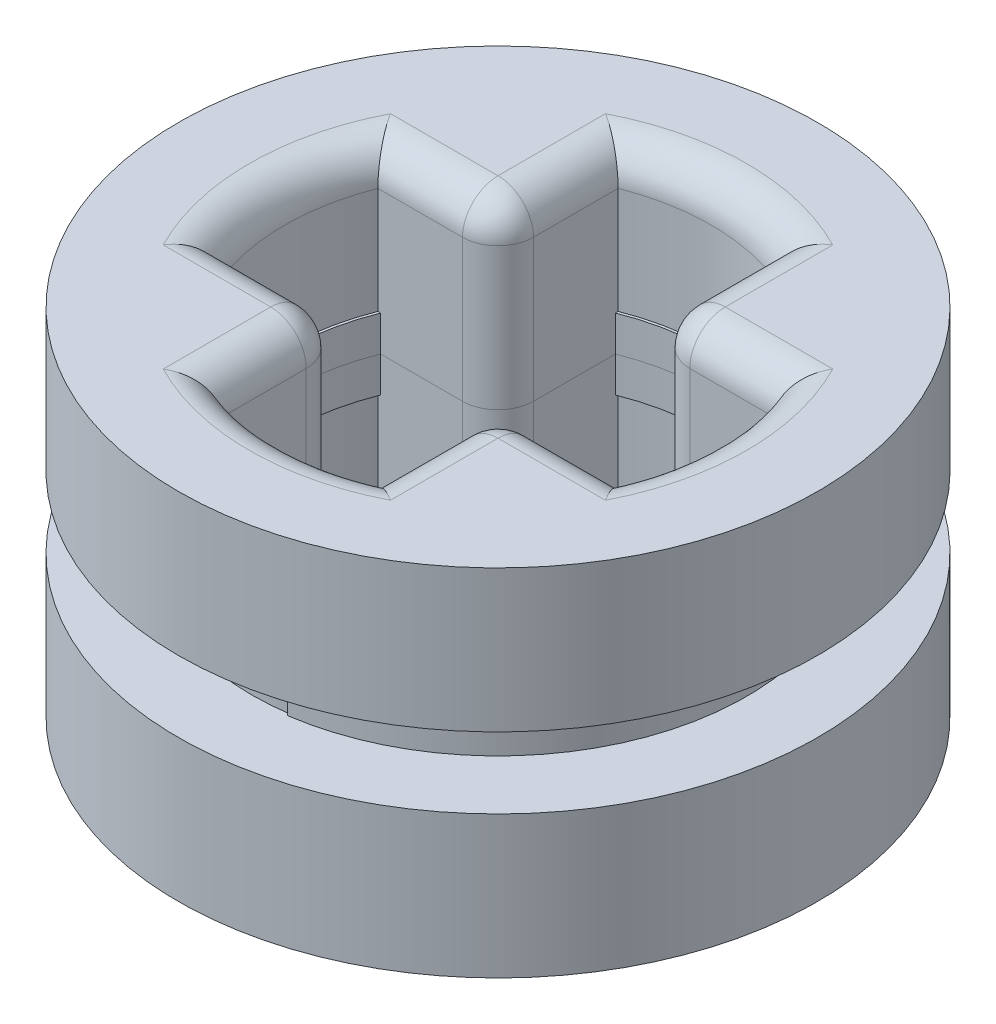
ISO-10303-21;
HEADER;
FILE_DESCRIPTION(('STEP AP214'),'2;1');
FILE_NAME('part.step','',(''),(''),'','','');
FILE_SCHEMA(('AUTOMOTIVE_DESIGN { 1 0 10303 214 1 1 1 1 }'));
ENDSEC;
DATA;
#1=APPLICATION_CONTEXT('core data for automotive mechanical design processes');
#2=APPLICATION_PROTOCOL_DEFINITION('international standard','automotive_design',2000,#1);
#3=PRODUCT_CONTEXT('',#1,'mechanical');
#4=PRODUCT('Part','Part','',(#3));
#5=PRODUCT_RELATED_PRODUCT_CATEGORY('part','',(#4));
#6=PRODUCT_DEFINITION_FORMATION('','',#4);
#7=PRODUCT_DEFINITION_CONTEXT('part definition',#1,'design');
#8=PRODUCT_DEFINITION('design','',#6,#7);
#9=PRODUCT_DEFINITION_SHAPE('','',#8);
#10=(LENGTH_UNIT() NAMED_UNIT(*) SI_UNIT(.MILLI.,.METRE.));
#11=(NAMED_UNIT(*) PLANE_ANGLE_UNIT() SI_UNIT($,.RADIAN.));
#12=(NAMED_UNIT(*) SI_UNIT($,.STERADIAN.) SOLID_ANGLE_UNIT());
#13=UNCERTAINTY_MEASURE_WITH_UNIT(LENGTH_MEASURE(1.E-05),#10,'distance_accuracy_value','');
#14=(GEOMETRIC_REPRESENTATION_CONTEXT(3) GLOBAL_UNCERTAINTY_ASSIGNED_CONTEXT((#13)) GLOBAL_UNIT_ASSIGNED_CONTEXT((#10,
#11,#12)) REPRESENTATION_CONTEXT('',''));
#15=CARTESIAN_POINT('',(0.,0.,0.));
#16=DIRECTION('',(0.,0.,1.));
#17=DIRECTION('',(1.,0.,0.));
#18=AXIS2_PLACEMENT_3D('',#15,#16,#17);
#19=CARTESIAN_POINT('',(-0.336991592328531,5.19333595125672,6.32));
#20=DIRECTION('',(0.,0.,-1.));
#21=DIRECTION('',(1.,0.,0.));
#22=AXIS2_PLACEMENT_3D('',#19,#20,#21);
#23=PLANE('',#22);
#24=DIRECTION('',(0.,1.,0.));
#25=VECTOR('',#24,1.);
#26=CARTESIAN_POINT('',(0.584956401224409,3.15618024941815,6.32));
#27=LINE('',#26,#25);
#28=CARTESIAN_POINT('',(0.584956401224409,-0.806664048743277,6.32));
#29=VERTEX_POINT('',#28);
#30=CARTESIAN_POINT('',(0.584956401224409,-1.20666404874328,6.32));
#31=VERTEX_POINT('',#30);
#32=EDGE_CURVE('P0_E283',#29,#31,#27,.F.);
#33=ORIENTED_EDGE('',*,*,#32,.F.);
#34=DIRECTION('',(-1.,0.,0.));
#35=VECTOR('',#34,1.);
#36=CARTESIAN_POINT('',(-0.336991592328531,-0.806664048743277,6.32));
#37=LINE('',#36,#35);
#38=CARTESIAN_POINT('',(-0.336991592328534,-0.806664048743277,6.32));
#39=VERTEX_POINT('',#38);
#40=EDGE_CURVE('P0_E46',#29,#39,#37,.T.);
#41=ORIENTED_EDGE('',*,*,#40,.T.);
#42=DIRECTION('',(0.,1.,0.));
#43=VECTOR('',#42,1.);
#44=CARTESIAN_POINT('',(-0.336991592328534,5.19333595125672,6.32));
#45=LINE('',#44,#43);
#46=CARTESIAN_POINT('',(-0.336991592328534,-2.40666404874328,6.32));
#47=VERTEX_POINT('',#46);
#48=EDGE_CURVE('P0_E728',#39,#47,#45,.F.);
#49=ORIENTED_EDGE('',*,*,#48,.T.);
#50=DIRECTION('',(-1.,0.,0.));
#51=VECTOR('',#50,1.);
#52=CARTESIAN_POINT('',(0.615854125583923,-2.40666404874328,6.32));
#53=LINE('',#52,#51);
#54=CARTESIAN_POINT('',(0.615854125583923,-2.40666404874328,6.32));
#55=VERTEX_POINT('',#54);
#56=EDGE_CURVE('P0_E730',#47,#55,#53,.F.);
#57=ORIENTED_EDGE('',*,*,#56,.T.);
#58=DIRECTION('',(0.,-1.,0.));
#59=VECTOR('',#58,1.);
#60=CARTESIAN_POINT('',(0.615854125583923,5.19333595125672,6.32));
#61=LINE('',#60,#59);
#62=CARTESIAN_POINT('',(0.615854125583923,-1.20666404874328,6.32));
#63=VERTEX_POINT('',#62);
#64=EDGE_CURVE('P0_E671',#55,#63,#61,.F.);
#65=ORIENTED_EDGE('',*,*,#64,.T.);
#66=DIRECTION('',(1.,0.,0.));
#67=VECTOR('',#66,1.);
#68=CARTESIAN_POINT('',(-0.336991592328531,-1.20666404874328,6.32));
#69=LINE('',#68,#67);
#70=EDGE_CURVE('P0_E1050',#31,#63,#69,.T.);
#71=ORIENTED_EDGE('',*,*,#70,.F.);
#72=EDGE_LOOP('',(#33,#41,#49,#57,#65,#71));
#73=FACE_BOUND('',#72,.T.);
#74=ADVANCED_FACE('P0_F23',(#73),#23,.F.);
#75=CARTESIAN_POINT('',(-0.336991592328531,5.19333595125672,8.08));
#76=DIRECTION('',(0.,0.,1.));
#77=DIRECTION('',(-1.,0.,0.));
#78=AXIS2_PLACEMENT_3D('',#75,#76,#77);
#79=PLANE('',#78);
#80=DIRECTION('',(0.,1.,0.));
#81=VECTOR('',#80,1.);
#82=CARTESIAN_POINT('',(-0.336991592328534,5.19333595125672,8.08));
#83=LINE('',#82,#81);
#84=CARTESIAN_POINT('',(-0.336991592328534,-2.40666404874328,8.08));
#85=VERTEX_POINT('',#84);
#86=CARTESIAN_POINT('',(-0.336991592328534,-0.806664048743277,8.08));
#87=VERTEX_POINT('',#86);
#88=EDGE_CURVE('P0_E277',#85,#87,#83,.T.);
#89=ORIENTED_EDGE('',*,*,#88,.T.);
#90=DIRECTION('',(1.,0.,0.));
#91=VECTOR('',#90,1.);
#92=CARTESIAN_POINT('',(-0.336991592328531,-0.806664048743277,8.08));
#93=LINE('',#92,#91);
#94=CARTESIAN_POINT('',(0.58495640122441,-0.806664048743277,8.08));
#95=VERTEX_POINT('',#94);
#96=EDGE_CURVE('P0_E266',#87,#95,#93,.T.);
#97=ORIENTED_EDGE('',*,*,#96,.T.);
#98=DIRECTION('',(0.,1.,0.));
#99=VECTOR('',#98,1.);
#100=CARTESIAN_POINT('',(0.58495640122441,3.15618024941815,8.08));
#101=LINE('',#100,#99);
#102=CARTESIAN_POINT('',(0.58495640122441,-1.20666404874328,8.08));
#103=VERTEX_POINT('',#102);
#104=EDGE_CURVE('P0_E274',#103,#95,#101,.T.);
#105=ORIENTED_EDGE('',*,*,#104,.F.);
#106=DIRECTION('',(-1.,0.,0.));
#107=VECTOR('',#106,1.);
#108=CARTESIAN_POINT('',(-0.336991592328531,-1.20666404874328,8.08));
#109=LINE('',#108,#107);
#110=CARTESIAN_POINT('',(0.615854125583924,-1.20666404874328,8.08));
#111=VERTEX_POINT('',#110);
#112=EDGE_CURVE('P0_E1048',#111,#103,#109,.T.);
#113=ORIENTED_EDGE('',*,*,#112,.F.);
#114=DIRECTION('',(0.,-1.,0.));
#115=VECTOR('',#114,1.);
#116=CARTESIAN_POINT('',(0.615854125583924,5.19333595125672,8.08));
#117=LINE('',#116,#115);
#118=CARTESIAN_POINT('',(0.615854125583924,-2.40666404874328,8.08));
#119=VERTEX_POINT('',#118);
#120=EDGE_CURVE('P0_E666',#111,#119,#117,.T.);
#121=ORIENTED_EDGE('',*,*,#120,.T.);
#122=DIRECTION('',(1.,0.,0.));
#123=VECTOR('',#122,1.);
#124=CARTESIAN_POINT('',(-0.736991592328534,-2.40666404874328,8.08));
#125=LINE('',#124,#123);
#126=EDGE_CURVE('P0_E744',#119,#85,#125,.F.);
#127=ORIENTED_EDGE('',*,*,#126,.T.);
#128=EDGE_LOOP('',(#89,#97,#105,#113,#121,#127));
#129=FACE_BOUND('',#128,.T.);
#130=ADVANCED_FACE('P0_F273',(#129),#79,.F.);
#131=CARTESIAN_POINT('',(-3.84983731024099,5.19333595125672,8.08));
#132=DIRECTION('',(0.,0.,1.));
#133=DIRECTION('',(-1.,0.,0.));
#134=AXIS2_PLACEMENT_3D('',#131,#132,#133);
#135=PLANE('',#134);
#136=DIRECTION('',(0.,1.,0.));
#137=VECTOR('',#136,1.);
#138=CARTESIAN_POINT('',(-3.81893958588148,3.15618024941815,8.08));
#139=LINE('',#138,#137);
#140=CARTESIAN_POINT('',(-3.81893958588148,-0.806664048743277,8.08));
#141=VERTEX_POINT('',#140);
#142=CARTESIAN_POINT('',(-3.81893958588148,-1.20666404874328,8.08));
#143=VERTEX_POINT('',#142);
#144=EDGE_CURVE('P0_E284',#141,#143,#139,.F.);
#145=ORIENTED_EDGE('',*,*,#144,.F.);
#146=DIRECTION('',(1.,0.,0.));
#147=VECTOR('',#146,1.);
#148=CARTESIAN_POINT('',(-3.84983731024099,-0.806664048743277,8.08));
#149=LINE('',#148,#147);
#150=CARTESIAN_POINT('',(-2.89699159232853,-0.806664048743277,8.08));
#151=VERTEX_POINT('',#150);
#152=EDGE_CURVE('P0_E985',#141,#151,#149,.T.);
#153=ORIENTED_EDGE('',*,*,#152,.T.);
#154=DIRECTION('',(0.,1.,0.));
#155=VECTOR('',#154,1.);
#156=CARTESIAN_POINT('',(-2.89699159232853,5.19333595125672,8.08));
#157=LINE('',#156,#155);
#158=CARTESIAN_POINT('',(-2.89699159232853,-2.40666404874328,8.08));
#159=VERTEX_POINT('',#158);
#160=EDGE_CURVE('P0_E761',#151,#159,#157,.F.);
#161=ORIENTED_EDGE('',*,*,#160,.T.);
#162=DIRECTION('',(1.,0.,0.));
#163=VECTOR('',#162,1.);
#164=CARTESIAN_POINT('',(-3.84983731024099,-2.40666404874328,8.08));
#165=LINE('',#164,#163);
#166=CARTESIAN_POINT('',(-3.84983731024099,-2.40666404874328,8.08));
#167=VERTEX_POINT('',#166);
#168=EDGE_CURVE('P0_E763',#159,#167,#165,.F.);
#169=ORIENTED_EDGE('',*,*,#168,.T.);
#170=DIRECTION('',(0.,-1.,0.));
#171=VECTOR('',#170,1.);
#172=CARTESIAN_POINT('',(-3.84983731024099,5.19333595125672,8.08));
#173=LINE('',#172,#171);
#174=CARTESIAN_POINT('',(-3.84983731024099,-1.20666404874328,8.08));
#175=VERTEX_POINT('',#174);
#176=EDGE_CURVE('P0_E672',#167,#175,#173,.F.);
#177=ORIENTED_EDGE('',*,*,#176,.T.);
#178=DIRECTION('',(-1.,0.,0.));
#179=VECTOR('',#178,1.);
#180=CARTESIAN_POINT('',(-3.84983731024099,-1.20666404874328,8.08));
#181=LINE('',#180,#179);
#182=EDGE_CURVE('P0_E1042',#143,#175,#181,.T.);
#183=ORIENTED_EDGE('',*,*,#182,.F.);
#184=EDGE_LOOP('',(#145,#153,#161,#169,#177,#183));
#185=FACE_BOUND('',#184,.T.);
#186=ADVANCED_FACE('P0_F929',(#185),#135,.F.);
#187=CARTESIAN_POINT('',(-0.736991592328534,5.19333595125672,5.91999999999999));
#188=DIRECTION('',(1.,0.,0.));
#189=DIRECTION('',(0.,0.,1.));
#190=AXIS2_PLACEMENT_3D('',#187,#188,#189);
#191=PLANE('',#190);
#192=DIRECTION('',(0.,1.,0.));
#193=VECTOR('',#192,1.);
#194=CARTESIAN_POINT('',(-0.736991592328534,5.19333595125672,5.92));
#195=LINE('',#194,#193);
#196=CARTESIAN_POINT('',(-0.736991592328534,-2.40666404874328,5.92));
#197=VERTEX_POINT('',#196);
#198=CARTESIAN_POINT('',(-0.736991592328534,-0.806664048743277,5.92));
#199=VERTEX_POINT('',#198);
#200=EDGE_CURVE('P0_E722',#197,#199,#195,.T.);
#201=ORIENTED_EDGE('',*,*,#200,.T.);
#202=DIRECTION('',(0.,0.,-1.));
#203=VECTOR('',#202,1.);
#204=CARTESIAN_POINT('',(-0.736991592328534,-0.806664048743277,5.91999999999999));
#205=LINE('',#204,#203);
#206=CARTESIAN_POINT('',(-0.736991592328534,-0.806664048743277,4.99805200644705));
#207=VERTEX_POINT('',#206);
#208=EDGE_CURVE('P0_E949',#199,#207,#205,.T.);
#209=ORIENTED_EDGE('',*,*,#208,.T.);
#210=DIRECTION('',(0.,1.,0.));
#211=VECTOR('',#210,1.);
#212=CARTESIAN_POINT('',(-0.736991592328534,3.15618024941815,4.99805200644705));
#213=LINE('',#212,#211);
#214=CARTESIAN_POINT('',(-0.736991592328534,-1.20666404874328,4.99805200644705));
#215=VERTEX_POINT('',#214);
#216=EDGE_CURVE('P0_E288',#215,#207,#213,.T.);
#217=ORIENTED_EDGE('',*,*,#216,.F.);
#218=DIRECTION('',(0.,0.,1.));
#219=VECTOR('',#218,1.);
#220=CARTESIAN_POINT('',(-0.736991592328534,-1.20666404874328,5.91999999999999));
#221=LINE('',#220,#219);
#222=CARTESIAN_POINT('',(-0.736991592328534,-1.20666404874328,4.96715428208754));
#223=VERTEX_POINT('',#222);
#224=EDGE_CURVE('P0_E1027',#223,#215,#221,.T.);
#225=ORIENTED_EDGE('',*,*,#224,.F.);
#226=DIRECTION('',(0.,-1.,0.));
#227=VECTOR('',#226,1.);
#228=CARTESIAN_POINT('',(-0.736991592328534,5.19333595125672,4.96715428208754));
#229=LINE('',#228,#227);
#230=CARTESIAN_POINT('',(-0.736991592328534,-2.40666404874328,4.96715428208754));
#231=VERTEX_POINT('',#230);
#232=EDGE_CURVE('P0_E330',#223,#231,#229,.T.);
#233=ORIENTED_EDGE('',*,*,#232,.T.);
#234=DIRECTION('',(0.,0.,-1.));
#235=VECTOR('',#234,1.);
#236=CARTESIAN_POINT('',(-0.736991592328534,-2.40666404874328,6.32));
#237=LINE('',#236,#235);
#238=EDGE_CURVE('P0_E725',#231,#197,#237,.F.);
#239=ORIENTED_EDGE('',*,*,#238,.T.);
#240=EDGE_LOOP('',(#201,#209,#217,#225,#233,#239));
#241=FACE_BOUND('',#240,.T.);
#242=ADVANCED_FACE('P0_F934',(#241),#191,.F.);
#243=CARTESIAN_POINT('',(-1.61699159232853,5.19333595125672,7.2));
#244=DIRECTION('',(0.,-1.,0.));
#245=DIRECTION('',(0.,0.,-1.));
#246=AXIS2_PLACEMENT_3D('',#243,#244,#245);
#247=CYLINDRICAL_SURFACE('',#246,2.4);
#248=CARTESIAN_POINT('',(-1.61699159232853,-1.20666404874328,7.2));
#249=DIRECTION('',(0.,1.,0.));
#250=DIRECTION('',(0.,0.,1.));
#251=AXIS2_PLACEMENT_3D('',#248,#249,#250);
#252=CIRCLE('',#251,2.4);
#253=CARTESIAN_POINT('',(-3.84983731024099,-1.20666404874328,6.32));
#254=VERTEX_POINT('',#253);
#255=EDGE_CURVE('P0_E1039',#175,#254,#252,.F.);
#256=ORIENTED_EDGE('',*,*,#255,.F.);
#257=ORIENTED_EDGE('',*,*,#176,.F.);
#258=CARTESIAN_POINT('',(-1.61699159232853,-2.40666404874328,7.2));
#259=DIRECTION('',(0.,-1.,0.));
#260=DIRECTION('',(0.,0.,-1.));
#261=AXIS2_PLACEMENT_3D('',#258,#259,#260);
#262=CIRCLE('',#261,2.4);
#263=CARTESIAN_POINT('',(-3.84983731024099,-2.40666404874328,6.32));
#264=VERTEX_POINT('',#263);
#265=EDGE_CURVE('P0_E756',#167,#264,#262,.T.);
#266=ORIENTED_EDGE('',*,*,#265,.T.);
#267=DIRECTION('',(0.,-1.,0.));
#268=VECTOR('',#267,1.);
#269=CARTESIAN_POINT('',(-3.84983731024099,5.19333595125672,6.32));
#270=LINE('',#269,#268);
#271=EDGE_CURVE('P0_E670',#264,#254,#270,.F.);
#272=ORIENTED_EDGE('',*,*,#271,.T.);
#273=EDGE_LOOP('',(#256,#257,#266,#272));
#274=FACE_BOUND('',#273,.T.);
#275=ADVANCED_FACE('P0_F936',(#274),#247,.F.);
#276=CARTESIAN_POINT('',(-1.61699159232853,5.19333595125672,7.2));
#277=DIRECTION('',(0.,-1.,0.));
#278=DIRECTION('',(0.,0.,-1.));
#279=AXIS2_PLACEMENT_3D('',#276,#277,#278);
#280=CYLINDRICAL_SURFACE('',#279,2.4);
#281=CARTESIAN_POINT('',(-1.61699159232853,-1.20666404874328,7.2));
#282=DIRECTION('',(0.,1.,0.));
#283=DIRECTION('',(0.,0.,1.));
#284=AXIS2_PLACEMENT_3D('',#281,#282,#283);
#285=CIRCLE('',#284,2.4);
#286=EDGE_CURVE('P0_E1045',#63,#111,#285,.F.);
#287=ORIENTED_EDGE('',*,*,#286,.F.);
#288=ORIENTED_EDGE('',*,*,#64,.F.);
#289=CARTESIAN_POINT('',(-1.61699159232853,-2.40666404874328,7.2));
#290=DIRECTION('',(0.,-1.,0.));
#291=DIRECTION('',(0.,0.,-1.));
#292=AXIS2_PLACEMENT_3D('',#289,#290,#291);
#293=CIRCLE('',#292,2.4);
#294=EDGE_CURVE('P0_E736',#55,#119,#293,.T.);
#295=ORIENTED_EDGE('',*,*,#294,.T.);
#296=ORIENTED_EDGE('',*,*,#120,.F.);
#297=EDGE_LOOP('',(#287,#288,#295,#296));
#298=FACE_BOUND('',#297,.T.);
#299=ADVANCED_FACE('P0_F942',(#298),#280,.F.);
#300=CARTESIAN_POINT('',(-3.84983731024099,5.19333595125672,6.32));
#301=DIRECTION('',(0.,0.,-1.));
#302=DIRECTION('',(1.,0.,0.));
#303=AXIS2_PLACEMENT_3D('',#300,#301,#302);
#304=PLANE('',#303);
#305=DIRECTION('',(0.,1.,0.));
#306=VECTOR('',#305,1.);
#307=CARTESIAN_POINT('',(-2.89699159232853,5.19333595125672,6.32));
#308=LINE('',#307,#306);
#309=CARTESIAN_POINT('',(-2.89699159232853,-2.40666404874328,6.32));
#310=VERTEX_POINT('',#309);
#311=CARTESIAN_POINT('',(-2.89699159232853,-0.806664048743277,6.32));
#312=VERTEX_POINT('',#311);
#313=EDGE_CURVE('P0_E746',#310,#312,#308,.T.);
#314=ORIENTED_EDGE('',*,*,#313,.T.);
#315=DIRECTION('',(-1.,0.,0.));
#316=VECTOR('',#315,1.);
#317=CARTESIAN_POINT('',(-3.84983731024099,-0.806664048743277,6.32));
#318=LINE('',#317,#316);
#319=CARTESIAN_POINT('',(-3.81893958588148,-0.806664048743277,6.32));
#320=VERTEX_POINT('',#319);
#321=EDGE_CURVE('P0_E982',#312,#320,#318,.T.);
#322=ORIENTED_EDGE('',*,*,#321,.T.);
#323=DIRECTION('',(0.,1.,0.));
#324=VECTOR('',#323,1.);
#325=CARTESIAN_POINT('',(-3.81893958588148,3.15618024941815,6.32));
#326=LINE('',#325,#324);
#327=CARTESIAN_POINT('',(-3.81893958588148,-1.20666404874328,6.32));
#328=VERTEX_POINT('',#327);
#329=EDGE_CURVE('P0_E1058',#328,#320,#326,.T.);
#330=ORIENTED_EDGE('',*,*,#329,.F.);
#331=DIRECTION('',(1.,0.,0.));
#332=VECTOR('',#331,1.);
#333=CARTESIAN_POINT('',(-3.84983731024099,-1.20666404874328,6.32));
#334=LINE('',#333,#332);
#335=EDGE_CURVE('P0_E1036',#254,#328,#334,.T.);
#336=ORIENTED_EDGE('',*,*,#335,.F.);
#337=ORIENTED_EDGE('',*,*,#271,.F.);
#338=DIRECTION('',(-1.,0.,0.));
#339=VECTOR('',#338,1.);
#340=CARTESIAN_POINT('',(-2.49699159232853,-2.40666404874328,6.32));
#341=LINE('',#340,#339);
#342=EDGE_CURVE('P0_E749',#264,#310,#341,.F.);
#343=ORIENTED_EDGE('',*,*,#342,.T.);
#344=EDGE_LOOP('',(#314,#322,#330,#336,#337,#343));
#345=FACE_BOUND('',#344,.T.);
#346=ADVANCED_FACE('P0_F1199',(#345),#304,.F.);
#347=CARTESIAN_POINT('',(-0.736991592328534,5.19333595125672,9.43284571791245));
#348=DIRECTION('',(1.,0.,0.));
#349=DIRECTION('',(0.,0.,1.));
#350=AXIS2_PLACEMENT_3D('',#347,#348,#349);
#351=PLANE('',#350);
#352=DIRECTION('',(0.,1.,0.));
#353=VECTOR('',#352,1.);
#354=CARTESIAN_POINT('',(-0.736991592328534,3.15618024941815,9.40194799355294));
#355=LINE('',#354,#353);
#356=CARTESIAN_POINT('',(-0.736991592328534,-0.806664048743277,9.40194799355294));
#357=VERTEX_POINT('',#356);
#358=CARTESIAN_POINT('',(-0.736991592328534,-1.20666404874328,9.40194799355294));
#359=VERTEX_POINT('',#358);
#360=EDGE_CURVE('P0_E1056',#357,#359,#355,.F.);
#361=ORIENTED_EDGE('',*,*,#360,.F.);
#362=DIRECTION('',(0.,0.,-1.));
#363=VECTOR('',#362,1.);
#364=CARTESIAN_POINT('',(-0.736991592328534,-0.806664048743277,9.43284571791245));
#365=LINE('',#364,#363);
#366=CARTESIAN_POINT('',(-0.736991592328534,-0.806664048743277,8.48));
#367=VERTEX_POINT('',#366);
#368=EDGE_CURVE('P0_E959',#357,#367,#365,.T.);
#369=ORIENTED_EDGE('',*,*,#368,.T.);
#370=DIRECTION('',(0.,1.,0.));
#371=VECTOR('',#370,1.);
#372=CARTESIAN_POINT('',(-0.736991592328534,5.19333595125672,8.48));
#373=LINE('',#372,#371);
#374=CARTESIAN_POINT('',(-0.736991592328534,-2.40666404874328,8.48));
#375=VERTEX_POINT('',#374);
#376=EDGE_CURVE('P0_E751',#367,#375,#373,.F.);
#377=ORIENTED_EDGE('',*,*,#376,.T.);
#378=DIRECTION('',(0.,0.,-1.));
#379=VECTOR('',#378,1.);
#380=CARTESIAN_POINT('',(-0.736991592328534,-2.40666404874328,9.43284571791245));
#381=LINE('',#380,#379);
#382=CARTESIAN_POINT('',(-0.736991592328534,-2.40666404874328,9.43284571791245));
#383=VERTEX_POINT('',#382);
#384=EDGE_CURVE('P0_E753',#375,#383,#381,.F.);
#385=ORIENTED_EDGE('',*,*,#384,.T.);
#386=DIRECTION('',(0.,-1.,0.));
#387=VECTOR('',#386,1.);
#388=CARTESIAN_POINT('',(-0.736991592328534,5.19333595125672,9.43284571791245));
#389=LINE('',#388,#387);
#390=CARTESIAN_POINT('',(-0.736991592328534,-1.20666404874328,9.43284571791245));
#391=VERTEX_POINT('',#390);
#392=EDGE_CURVE('P0_E331',#383,#391,#389,.F.);
#393=ORIENTED_EDGE('',*,*,#392,.T.);
#394=DIRECTION('',(0.,0.,1.));
#395=VECTOR('',#394,1.);
#396=CARTESIAN_POINT('',(-0.736991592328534,-1.20666404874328,9.43284571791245));
#397=LINE('',#396,#395);
#398=EDGE_CURVE('P0_E1024',#359,#391,#397,.T.);
#399=ORIENTED_EDGE('',*,*,#398,.F.);
#400=EDGE_LOOP('',(#361,#369,#377,#385,#393,#399));
#401=FACE_BOUND('',#400,.T.);
#402=ADVANCED_FACE('P0_F1189',(#401),#351,.F.);
#403=CARTESIAN_POINT('',(-2.49699159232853,5.19333595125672,8.48));
#404=DIRECTION('',(-1.,0.,0.));
#405=DIRECTION('',(0.,0.,-1.));
#406=AXIS2_PLACEMENT_3D('',#403,#404,#405);
#407=PLANE('',#406);
#408=DIRECTION('',(0.,1.,0.));
#409=VECTOR('',#408,1.);
#410=CARTESIAN_POINT('',(-2.49699159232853,5.19333595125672,8.48));
#411=LINE('',#410,#409);
#412=CARTESIAN_POINT('',(-2.49699159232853,-2.40666404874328,8.48));
#413=VERTEX_POINT('',#412);
#414=CARTESIAN_POINT('',(-2.49699159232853,-0.806664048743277,8.48));
#415=VERTEX_POINT('',#414);
#416=EDGE_CURVE('P0_E765',#413,#415,#411,.T.);
#417=ORIENTED_EDGE('',*,*,#416,.T.);
#418=DIRECTION('',(0.,0.,1.));
#419=VECTOR('',#418,1.);
#420=CARTESIAN_POINT('',(-2.49699159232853,-0.806664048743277,8.48));
#421=LINE('',#420,#419);
#422=CARTESIAN_POINT('',(-2.49699159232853,-0.806664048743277,9.40194799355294));
#423=VERTEX_POINT('',#422);
#424=EDGE_CURVE('P0_E975',#415,#423,#421,.T.);
#425=ORIENTED_EDGE('',*,*,#424,.T.);
#426=DIRECTION('',(0.,1.,0.));
#427=VECTOR('',#426,1.);
#428=CARTESIAN_POINT('',(-2.49699159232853,3.15618024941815,9.40194799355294));
#429=LINE('',#428,#427);
#430=CARTESIAN_POINT('',(-2.49699159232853,-1.20666404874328,9.40194799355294));
#431=VERTEX_POINT('',#430);
#432=EDGE_CURVE('P0_E1053',#431,#423,#429,.T.);
#433=ORIENTED_EDGE('',*,*,#432,.F.);
#434=DIRECTION('',(0.,0.,-1.));
#435=VECTOR('',#434,1.);
#436=CARTESIAN_POINT('',(-2.49699159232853,-1.20666404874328,8.48));
#437=LINE('',#436,#435);
#438=CARTESIAN_POINT('',(-2.49699159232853,-1.20666404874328,9.43284571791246));
#439=VERTEX_POINT('',#438);
#440=EDGE_CURVE('P0_E1033',#439,#431,#437,.T.);
#441=ORIENTED_EDGE('',*,*,#440,.F.);
#442=DIRECTION('',(0.,-1.,0.));
#443=VECTOR('',#442,1.);
#444=CARTESIAN_POINT('',(-2.49699159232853,5.19333595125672,9.43284571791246));
#445=LINE('',#444,#443);
#446=CARTESIAN_POINT('',(-2.49699159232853,-2.40666404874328,9.43284571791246));
#447=VERTEX_POINT('',#446);
#448=EDGE_CURVE('P0_E314',#439,#447,#445,.T.);
#449=ORIENTED_EDGE('',*,*,#448,.T.);
#450=DIRECTION('',(0.,0.,1.));
#451=VECTOR('',#450,1.);
#452=CARTESIAN_POINT('',(-2.49699159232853,-2.40666404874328,8.08));
#453=LINE('',#452,#451);
#454=EDGE_CURVE('P0_E768',#447,#413,#453,.F.);
#455=ORIENTED_EDGE('',*,*,#454,.T.);
#456=EDGE_LOOP('',(#417,#425,#433,#441,#449,#455));
#457=FACE_BOUND('',#456,.T.);
#458=ADVANCED_FACE('P0_F1179',(#457),#407,.F.);
#459=CARTESIAN_POINT('',(-1.21699159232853,3.59333595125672,10.8));
#460=DIRECTION('',(1.,0.,0.));
#461=DIRECTION('',(0.,-1.,0.));
#462=AXIS2_PLACEMENT_3D('',#459,#460,#461);
#463=PLANE('',#462);
#464=DIRECTION('',(0.,1.,0.));
#465=VECTOR('',#464,1.);
#466=CARTESIAN_POINT('',(-1.21699159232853,3.15618024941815,4.45773815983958));
#467=LINE('',#466,#465);
#468=CARTESIAN_POINT('',(-1.21699159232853,-0.806664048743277,4.45773815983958));
#469=VERTEX_POINT('',#468);
#470=CARTESIAN_POINT('',(-1.21699159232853,-1.20666404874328,4.45773815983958));
#471=VERTEX_POINT('',#470);
#472=EDGE_CURVE('P0_E1022',#469,#471,#467,.F.);
#473=ORIENTED_EDGE('',*,*,#472,.F.);
#474=DIRECTION('',(0.,0.,-1.));
#475=VECTOR('',#474,1.);
#476=CARTESIAN_POINT('',(-1.21699159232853,-0.806664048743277,10.8));
#477=LINE('',#476,#475);
#478=CARTESIAN_POINT('',(-1.21699159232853,-0.806664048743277,4.42871870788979));
#479=VERTEX_POINT('',#478);
#480=EDGE_CURVE('P0_E1004',#469,#479,#477,.T.);
#481=ORIENTED_EDGE('',*,*,#480,.T.);
#482=DIRECTION('',(0.,1.,0.));
#483=VECTOR('',#482,1.);
#484=CARTESIAN_POINT('',(-1.21699159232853,-1.20666404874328,4.42871870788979));
#485=LINE('',#484,#483);
#486=CARTESIAN_POINT('',(-1.21699159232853,-1.20666404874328,4.42871870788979));
#487=VERTEX_POINT('',#486);
#488=EDGE_CURVE('P0_E309',#487,#479,#485,.T.);
#489=ORIENTED_EDGE('',*,*,#488,.F.);
#490=DIRECTION('',(0.,0.,-1.));
#491=VECTOR('',#490,1.);
#492=CARTESIAN_POINT('',(-1.21699159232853,-1.20666404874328,10.8));
#493=LINE('',#492,#491);
#494=EDGE_CURVE('P0_E327',#471,#487,#493,.T.);
#495=ORIENTED_EDGE('',*,*,#494,.F.);
#496=EDGE_LOOP('',(#473,#481,#489,#495));
#497=FACE_BOUND('',#496,.T.);
#498=ADVANCED_FACE('P0_F1169',(#497),#463,.F.);
#499=CARTESIAN_POINT('',(-1.21699159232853,3.59333595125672,10.8));
#500=DIRECTION('',(1.,0.,0.));
#501=DIRECTION('',(0.,-1.,0.));
#502=AXIS2_PLACEMENT_3D('',#499,#500,#501);
#503=PLANE('',#502);
#504=DIRECTION('',(0.,1.,0.));
#505=VECTOR('',#504,1.);
#506=CARTESIAN_POINT('',(-1.21699159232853,-1.20666404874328,9.9712812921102));
#507=LINE('',#506,#505);
#508=CARTESIAN_POINT('',(-1.21699159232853,-0.806664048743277,9.9712812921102));
#509=VERTEX_POINT('',#508);
#510=CARTESIAN_POINT('',(-1.21699159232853,-1.20666404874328,9.9712812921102));
#511=VERTEX_POINT('',#510);
#512=EDGE_CURVE('P0_E313',#509,#511,#507,.F.);
#513=ORIENTED_EDGE('',*,*,#512,.F.);
#514=DIRECTION('',(0.,0.,-1.));
#515=VECTOR('',#514,1.);
#516=CARTESIAN_POINT('',(-1.21699159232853,-0.806664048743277,10.8));
#517=LINE('',#516,#515);
#518=CARTESIAN_POINT('',(-1.21699159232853,-0.806664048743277,9.94226184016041));
#519=VERTEX_POINT('',#518);
#520=EDGE_CURVE('P0_E994',#509,#519,#517,.T.);
#521=ORIENTED_EDGE('',*,*,#520,.T.);
#522=DIRECTION('',(0.,1.,0.));
#523=VECTOR('',#522,1.);
#524=CARTESIAN_POINT('',(-1.21699159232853,3.15618024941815,9.94226184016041));
#525=LINE('',#524,#523);
#526=CARTESIAN_POINT('',(-1.21699159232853,-1.20666404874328,9.94226184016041));
#527=VERTEX_POINT('',#526);
#528=EDGE_CURVE('P0_E1019',#527,#519,#525,.T.);
#529=ORIENTED_EDGE('',*,*,#528,.F.);
#530=DIRECTION('',(0.,0.,-1.));
#531=VECTOR('',#530,1.);
#532=CARTESIAN_POINT('',(-1.21699159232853,-1.20666404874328,10.8));
#533=LINE('',#532,#531);
#534=EDGE_CURVE('P0_E322',#511,#527,#533,.T.);
#535=ORIENTED_EDGE('',*,*,#534,.F.);
#536=EDGE_LOOP('',(#513,#521,#529,#535));
#537=FACE_BOUND('',#536,.T.);
#538=ADVANCED_FACE('P0_F1160',(#537),#503,.F.);
#539=CARTESIAN_POINT('',(-2.49699159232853,5.19333595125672,4.96715428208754));
#540=DIRECTION('',(-1.,0.,0.));
#541=DIRECTION('',(0.,0.,-1.));
#542=AXIS2_PLACEMENT_3D('',#539,#540,#541);
#543=PLANE('',#542);
#544=DIRECTION('',(0.,1.,0.));
#545=VECTOR('',#544,1.);
#546=CARTESIAN_POINT('',(-2.49699159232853,3.15618024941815,4.99805200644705));
#547=LINE('',#546,#545);
#548=CARTESIAN_POINT('',(-2.49699159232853,-0.806664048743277,4.99805200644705));
#549=VERTEX_POINT('',#548);
#550=CARTESIAN_POINT('',(-2.49699159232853,-1.20666404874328,4.99805200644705));
#551=VERTEX_POINT('',#550);
#552=EDGE_CURVE('P0_E31',#549,#551,#547,.F.);
#553=ORIENTED_EDGE('',*,*,#552,.F.);
#554=DIRECTION('',(0.,0.,1.));
#555=VECTOR('',#554,1.);
#556=CARTESIAN_POINT('',(-2.49699159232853,-0.806664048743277,4.96715428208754));
#557=LINE('',#556,#555);
#558=CARTESIAN_POINT('',(-2.49699159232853,-0.806664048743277,5.92));
#559=VERTEX_POINT('',#558);
#560=EDGE_CURVE('P0_E972',#549,#559,#557,.T.);
#561=ORIENTED_EDGE('',*,*,#560,.T.);
#562=DIRECTION('',(0.,1.,0.));
#563=VECTOR('',#562,1.);
#564=CARTESIAN_POINT('',(-2.49699159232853,5.19333595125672,5.92));
#565=LINE('',#564,#563);
#566=CARTESIAN_POINT('',(-2.49699159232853,-2.40666404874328,5.92));
#567=VERTEX_POINT('',#566);
#568=EDGE_CURVE('P0_E739',#559,#567,#565,.F.);
#569=ORIENTED_EDGE('',*,*,#568,.T.);
#570=DIRECTION('',(0.,0.,1.));
#571=VECTOR('',#570,1.);
#572=CARTESIAN_POINT('',(-2.49699159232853,-2.40666404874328,4.96715428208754));
#573=LINE('',#572,#571);
#574=CARTESIAN_POINT('',(-2.49699159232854,-2.40666404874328,4.96715428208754));
#575=VERTEX_POINT('',#574);
#576=EDGE_CURVE('P0_E741',#567,#575,#573,.F.);
#577=ORIENTED_EDGE('',*,*,#576,.T.);
#578=DIRECTION('',(0.,-1.,0.));
#579=VECTOR('',#578,1.);
#580=CARTESIAN_POINT('',(-2.49699159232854,5.19333595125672,4.96715428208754));
#581=LINE('',#580,#579);
#582=CARTESIAN_POINT('',(-2.49699159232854,-1.20666404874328,4.96715428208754));
#583=VERTEX_POINT('',#582);
#584=EDGE_CURVE('P0_E317',#575,#583,#581,.F.);
#585=ORIENTED_EDGE('',*,*,#584,.T.);
#586=DIRECTION('',(0.,0.,-1.));
#587=VECTOR('',#586,1.);
#588=CARTESIAN_POINT('',(-2.49699159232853,-1.20666404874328,4.96715428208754));
#589=LINE('',#588,#587);
#590=EDGE_CURVE('P0_E1030',#551,#583,#589,.T.);
#591=ORIENTED_EDGE('',*,*,#590,.F.);
#592=EDGE_LOOP('',(#553,#561,#569,#577,#585,#591));
#593=FACE_BOUND('',#592,.T.);
#594=ADVANCED_FACE('P0_F1075',(#593),#543,.F.);
#595=CARTESIAN_POINT('',(-1.61699159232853,5.19333595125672,7.2));
#596=DIRECTION('',(0.,-1.,0.));
#597=DIRECTION('',(0.,0.,-1.));
#598=AXIS2_PLACEMENT_3D('',#595,#596,#597);
#599=CYLINDRICAL_SURFACE('',#598,2.4);
#600=ORIENTED_EDGE('',*,*,#448,.F.);
#601=CARTESIAN_POINT('',(-1.61699159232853,-1.20666404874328,7.2));
#602=DIRECTION('',(0.,-1.,0.));
#603=DIRECTION('',(0.,0.,-1.));
#604=AXIS2_PLACEMENT_3D('',#601,#602,#603);
#605=CIRCLE('',#604,2.4);
#606=EDGE_CURVE('P0_E690',#439,#391,#605,.F.);
#607=ORIENTED_EDGE('',*,*,#606,.T.);
#608=ORIENTED_EDGE('',*,*,#392,.F.);
#609=CARTESIAN_POINT('',(-1.61699159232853,-2.40666404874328,7.2));
#610=DIRECTION('',(0.,-1.,0.));
#611=DIRECTION('',(0.,0.,-1.));
#612=AXIS2_PLACEMENT_3D('',#609,#610,#611);
#613=CIRCLE('',#612,2.4);
#614=EDGE_CURVE('P0_E758',#383,#447,#613,.T.);
#615=ORIENTED_EDGE('',*,*,#614,.T.);
#616=EDGE_LOOP('',(#600,#607,#608,#615));
#617=FACE_BOUND('',#616,.T.);
#618=ADVANCED_FACE('P0_F1141',(#617),#599,.F.);
#619=CARTESIAN_POINT('',(-1.61699159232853,5.19333595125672,7.2));
#620=DIRECTION('',(0.,-1.,0.));
#621=DIRECTION('',(0.,0.,-1.));
#622=AXIS2_PLACEMENT_3D('',#619,#620,#621);
#623=CYLINDRICAL_SURFACE('',#622,2.4);
#624=CARTESIAN_POINT('',(-1.61699159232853,-1.20666404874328,7.2));
#625=DIRECTION('',(0.,-1.,0.));
#626=DIRECTION('',(0.,0.,-1.));
#627=AXIS2_PLACEMENT_3D('',#624,#625,#626);
#628=CIRCLE('',#627,2.4);
#629=EDGE_CURVE('P0_E321',#223,#583,#628,.F.);
#630=ORIENTED_EDGE('',*,*,#629,.T.);
#631=ORIENTED_EDGE('',*,*,#584,.F.);
#632=CARTESIAN_POINT('',(-1.61699159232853,-2.40666404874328,7.2));
#633=DIRECTION('',(0.,-1.,0.));
#634=DIRECTION('',(0.,0.,-1.));
#635=AXIS2_PLACEMENT_3D('',#632,#633,#634);
#636=CIRCLE('',#635,2.4);
#637=EDGE_CURVE('P0_E733',#575,#231,#636,.T.);
#638=ORIENTED_EDGE('',*,*,#637,.T.);
#639=ORIENTED_EDGE('',*,*,#232,.F.);
#640=EDGE_LOOP('',(#630,#631,#638,#639));
#641=FACE_BOUND('',#640,.T.);
#642=ADVANCED_FACE('P0_F932',(#641),#623,.F.);
#643=CARTESIAN_POINT('',(-2.01699159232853,-1.20666404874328,10.8));
#644=DIRECTION('',(-1.,0.,0.));
#645=DIRECTION('',(0.,1.,0.));
#646=AXIS2_PLACEMENT_3D('',#643,#644,#645);
#647=PLANE('',#646);
#648=DIRECTION('',(0.,1.,0.));
#649=VECTOR('',#648,1.);
#650=CARTESIAN_POINT('',(-2.01699159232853,3.15618024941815,9.94226184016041));
#651=LINE('',#650,#649);
#652=CARTESIAN_POINT('',(-2.01699159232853,-0.806664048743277,9.94226184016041));
#653=VERTEX_POINT('',#652);
#654=CARTESIAN_POINT('',(-2.01699159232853,-1.20666404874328,9.94226184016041));
#655=VERTEX_POINT('',#654);
#656=EDGE_CURVE('P0_E1017',#653,#655,#651,.F.);
#657=ORIENTED_EDGE('',*,*,#656,.F.);
#658=DIRECTION('',(0.,0.,1.));
#659=VECTOR('',#658,1.);
#660=CARTESIAN_POINT('',(-2.01699159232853,-0.806664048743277,10.8));
#661=LINE('',#660,#659);
#662=CARTESIAN_POINT('',(-2.01699159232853,-0.806664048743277,9.9712812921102));
#663=VERTEX_POINT('',#662);
#664=EDGE_CURVE('P0_E38',#653,#663,#661,.T.);
#665=ORIENTED_EDGE('',*,*,#664,.T.);
#666=DIRECTION('',(0.,1.,0.));
#667=VECTOR('',#666,1.);
#668=CARTESIAN_POINT('',(-2.01699159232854,-1.20666404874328,9.9712812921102));
#669=LINE('',#668,#667);
#670=CARTESIAN_POINT('',(-2.01699159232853,-1.20666404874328,9.9712812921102));
#671=VERTEX_POINT('',#670);
#672=EDGE_CURVE('P0_E292',#671,#663,#669,.T.);
#673=ORIENTED_EDGE('',*,*,#672,.F.);
#674=DIRECTION('',(0.,0.,-1.));
#675=VECTOR('',#674,1.);
#676=CARTESIAN_POINT('',(-2.01699159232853,-1.20666404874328,10.8));
#677=LINE('',#676,#675);
#678=EDGE_CURVE('P0_E301',#655,#671,#677,.F.);
#679=ORIENTED_EDGE('',*,*,#678,.F.);
#680=EDGE_LOOP('',(#657,#665,#673,#679));
#681=FACE_BOUND('',#680,.T.);
#682=ADVANCED_FACE('P0_F1116',(#681),#647,.F.);
#683=CARTESIAN_POINT('',(-2.01699159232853,-1.20666404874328,10.8));
#684=DIRECTION('',(-1.,0.,0.));
#685=DIRECTION('',(0.,1.,0.));
#686=AXIS2_PLACEMENT_3D('',#683,#684,#685);
#687=PLANE('',#686);
#688=DIRECTION('',(0.,1.,0.));
#689=VECTOR('',#688,1.);
#690=CARTESIAN_POINT('',(-2.01699159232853,-1.20666404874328,4.42871870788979));
#691=LINE('',#690,#689);
#692=CARTESIAN_POINT('',(-2.01699159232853,-0.806664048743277,4.42871870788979));
#693=VERTEX_POINT('',#692);
#694=CARTESIAN_POINT('',(-2.01699159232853,-1.20666404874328,4.42871870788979));
#695=VERTEX_POINT('',#694);
#696=EDGE_CURVE('P0_E296',#693,#695,#691,.F.);
#697=ORIENTED_EDGE('',*,*,#696,.F.);
#698=DIRECTION('',(0.,0.,1.));
#699=VECTOR('',#698,1.);
#700=CARTESIAN_POINT('',(-2.01699159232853,-0.806664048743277,10.8));
#701=LINE('',#700,#699);
#702=CARTESIAN_POINT('',(-2.01699159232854,-0.806664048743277,4.45773815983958));
#703=VERTEX_POINT('',#702);
#704=EDGE_CURVE('P0_E1001',#693,#703,#701,.T.);
#705=ORIENTED_EDGE('',*,*,#704,.T.);
#706=DIRECTION('',(0.,1.,0.));
#707=VECTOR('',#706,1.);
#708=CARTESIAN_POINT('',(-2.01699159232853,3.15618024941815,4.45773815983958));
#709=LINE('',#708,#707);
#710=CARTESIAN_POINT('',(-2.01699159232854,-1.20666404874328,4.45773815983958));
#711=VERTEX_POINT('',#710);
#712=EDGE_CURVE('P0_E770',#711,#703,#709,.T.);
#713=ORIENTED_EDGE('',*,*,#712,.F.);
#714=DIRECTION('',(0.,0.,-1.));
#715=VECTOR('',#714,1.);
#716=CARTESIAN_POINT('',(-2.01699159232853,-1.20666404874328,10.8));
#717=LINE('',#716,#715);
#718=EDGE_CURVE('P0_E304',#695,#711,#717,.F.);
#719=ORIENTED_EDGE('',*,*,#718,.F.);
#720=EDGE_LOOP('',(#697,#705,#713,#719));
#721=FACE_BOUND('',#720,.T.);
#722=ADVANCED_FACE('P0_F1112',(#721),#687,.F.);
#723=CARTESIAN_POINT('',(-1.61699159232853,-2.80666404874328,7.2));
#724=DIRECTION('',(0.,-1.,0.));
#725=DIRECTION('',(0.,0.,-1.));
#726=AXIS2_PLACEMENT_3D('',#723,#724,#725);
#727=PLANE('',#726);
#728=DIRECTION('',(-1.,0.,0.));
#729=VECTOR('',#728,1.);
#730=CARTESIAN_POINT('',(-0.736991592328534,-2.80666404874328,5.92));
#731=LINE('',#730,#729);
#732=CARTESIAN_POINT('',(0.873309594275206,-2.80666404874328,5.92));
#733=VERTEX_POINT('',#732);
#734=CARTESIAN_POINT('',(-0.336991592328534,-2.80666404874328,5.92));
#735=VERTEX_POINT('',#734);
#736=EDGE_CURVE('P0_E717',#733,#735,#731,.T.);
#737=ORIENTED_EDGE('',*,*,#736,.T.);
#738=DIRECTION('',(0.,0.,-1.));
#739=VECTOR('',#738,1.);
#740=CARTESIAN_POINT('',(-0.336991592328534,-2.80666404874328,4.96715428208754));
#741=LINE('',#740,#739);
#742=CARTESIAN_POINT('',(-0.336991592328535,-2.80666404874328,4.70969881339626));
#743=VERTEX_POINT('',#742);
#744=EDGE_CURVE('P0_E719',#735,#743,#741,.T.);
#745=ORIENTED_EDGE('',*,*,#744,.T.);
#746=CARTESIAN_POINT('',(-1.61699159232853,-2.80666404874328,7.2));
#747=DIRECTION('',(0.,-1.,0.));
#748=DIRECTION('',(0.,0.,-1.));
#749=AXIS2_PLACEMENT_3D('',#746,#747,#748);
#750=CIRCLE('',#749,2.8);
#751=CARTESIAN_POINT('',(-2.89699159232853,-2.80666404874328,4.70969881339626));
#752=VERTEX_POINT('',#751);
#753=EDGE_CURVE('P0_E715',#743,#752,#750,.F.);
#754=ORIENTED_EDGE('',*,*,#753,.T.);
#755=DIRECTION('',(0.,0.,1.));
#756=VECTOR('',#755,1.);
#757=CARTESIAN_POINT('',(-2.89699159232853,-2.80666404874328,6.32));
#758=LINE('',#757,#756);
#759=CARTESIAN_POINT('',(-2.89699159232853,-2.80666404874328,5.92));
#760=VERTEX_POINT('',#759);
#761=EDGE_CURVE('P0_E711',#752,#760,#758,.T.);
#762=ORIENTED_EDGE('',*,*,#761,.T.);
#763=DIRECTION('',(-1.,0.,0.));
#764=VECTOR('',#763,1.);
#765=CARTESIAN_POINT('',(-3.84983731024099,-2.80666404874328,5.92));
#766=LINE('',#765,#764);
#767=CARTESIAN_POINT('',(-4.10729277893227,-2.80666404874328,5.92));
#768=VERTEX_POINT('',#767);
#769=EDGE_CURVE('P0_E707',#760,#768,#766,.T.);
#770=ORIENTED_EDGE('',*,*,#769,.T.);
#771=CARTESIAN_POINT('',(-1.61699159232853,-2.80666404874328,7.2));
#772=DIRECTION('',(0.,-1.,0.));
#773=DIRECTION('',(0.,0.,-1.));
#774=AXIS2_PLACEMENT_3D('',#771,#772,#773);
#775=CIRCLE('',#774,2.8);
#776=CARTESIAN_POINT('',(-4.10729277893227,-2.80666404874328,8.48));
#777=VERTEX_POINT('',#776);
#778=EDGE_CURVE('P0_E703',#768,#777,#775,.F.);
#779=ORIENTED_EDGE('',*,*,#778,.T.);
#780=DIRECTION('',(1.,0.,0.));
#781=VECTOR('',#780,1.);
#782=CARTESIAN_POINT('',(-2.49699159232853,-2.80666404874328,8.48));
#783=LINE('',#782,#781);
#784=CARTESIAN_POINT('',(-2.89699159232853,-2.80666404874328,8.48));
#785=VERTEX_POINT('',#784);
#786=EDGE_CURVE('P0_E699',#777,#785,#783,.T.);
#787=ORIENTED_EDGE('',*,*,#786,.T.);
#788=DIRECTION('',(0.,0.,1.));
#789=VECTOR('',#788,1.);
#790=CARTESIAN_POINT('',(-2.89699159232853,-2.80666404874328,9.43284571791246));
#791=LINE('',#790,#789);
#792=CARTESIAN_POINT('',(-2.89699159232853,-2.80666404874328,9.69030118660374));
#793=VERTEX_POINT('',#792);
#794=EDGE_CURVE('P0_E300',#785,#793,#791,.T.);
#795=ORIENTED_EDGE('',*,*,#794,.T.);
#796=CARTESIAN_POINT('',(-1.61699159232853,-2.80666404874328,7.2));
#797=DIRECTION('',(0.,-1.,0.));
#798=DIRECTION('',(0.,0.,-1.));
#799=AXIS2_PLACEMENT_3D('',#796,#797,#798);
#800=CIRCLE('',#799,2.8);
#801=CARTESIAN_POINT('',(-0.336991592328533,-2.80666404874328,9.69030118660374));
#802=VERTEX_POINT('',#801);
#803=EDGE_CURVE('P0_E701',#793,#802,#800,.F.);
#804=ORIENTED_EDGE('',*,*,#803,.T.);
#805=DIRECTION('',(0.,0.,-1.));
#806=VECTOR('',#805,1.);
#807=CARTESIAN_POINT('',(-0.336991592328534,-2.80666404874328,8.08));
#808=LINE('',#807,#806);
#809=CARTESIAN_POINT('',(-0.336991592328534,-2.80666404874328,8.48));
#810=VERTEX_POINT('',#809);
#811=EDGE_CURVE('P0_E705',#802,#810,#808,.T.);
#812=ORIENTED_EDGE('',*,*,#811,.T.);
#813=DIRECTION('',(1.,0.,0.));
#814=VECTOR('',#813,1.);
#815=CARTESIAN_POINT('',(0.615854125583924,-2.80666404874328,8.48));
#816=LINE('',#815,#814);
#817=CARTESIAN_POINT('',(0.873309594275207,-2.80666404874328,8.48));
#818=VERTEX_POINT('',#817);
#819=EDGE_CURVE('P0_E709',#810,#818,#816,.T.);
#820=ORIENTED_EDGE('',*,*,#819,.T.);
#821=CARTESIAN_POINT('',(-1.61699159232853,-2.80666404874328,7.2));
#822=DIRECTION('',(0.,-1.,0.));
#823=DIRECTION('',(0.,0.,-1.));
#824=AXIS2_PLACEMENT_3D('',#821,#822,#823);
#825=CIRCLE('',#824,2.8);
#826=EDGE_CURVE('P0_E713',#818,#733,#825,.F.);
#827=ORIENTED_EDGE('',*,*,#826,.T.);
#828=EDGE_LOOP('',(#737,#745,#754,#762,#770,#779,#787,#795,#804,#812,#820,#827));
#829=FACE_BOUND('',#828,.T.);
#830=CARTESIAN_POINT('',(-1.61699159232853,-2.80666404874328,7.2));
#831=DIRECTION('',(0.,-1.,0.));
#832=DIRECTION('',(0.,0.,-1.));
#833=AXIS2_PLACEMENT_3D('',#830,#831,#832);
#834=CIRCLE('',#833,3.6);
#835=CARTESIAN_POINT('',(-1.61699159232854,-2.80666404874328,3.6));
#836=VERTEX_POINT('',#835);
#837=EDGE_CURVE('P0_E326',#836,#836,#834,.F.);
#838=ORIENTED_EDGE('',*,*,#837,.F.);
#839=EDGE_LOOP('',(#838));
#840=FACE_BOUND('',#839,.T.);
#841=ADVANCED_FACE('P0_F914',(#829,#840),#727,.T.);
#842=CARTESIAN_POINT('',(-1.61699159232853,5.19333595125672,7.2));
#843=DIRECTION('',(0.,-1.,0.));
#844=DIRECTION('',(0.,0.,-1.));
#845=AXIS2_PLACEMENT_3D('',#842,#843,#844);
#846=CYLINDRICAL_SURFACE('',#845,3.6);
#847=CARTESIAN_POINT('',(-1.61699159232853,-1.20666404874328,7.2));
#848=DIRECTION('',(0.,-1.,0.));
#849=DIRECTION('',(0.,0.,-1.));
#850=AXIS2_PLACEMENT_3D('',#847,#848,#849);
#851=CIRCLE('',#850,3.6);
#852=CARTESIAN_POINT('',(-1.61699159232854,-1.20666404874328,3.6));
#853=VERTEX_POINT('',#852);
#854=EDGE_CURVE('P0_E305',#853,#853,#851,.T.);
#855=ORIENTED_EDGE('',*,*,#854,.T.);
#856=EDGE_LOOP('',(#855));
#857=FACE_BOUND('',#856,.T.);
#858=ORIENTED_EDGE('',*,*,#837,.T.);
#859=EDGE_LOOP('',(#858));
#860=FACE_BOUND('',#859,.T.);
#861=ADVANCED_FACE('P0_F1290',(#857,#860),#846,.T.);
#862=CARTESIAN_POINT('',(-1.61699159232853,-1.20666404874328,7.2));
#863=DIRECTION('',(0.,1.,0.));
#864=DIRECTION('',(0.,0.,1.));
#865=AXIS2_PLACEMENT_3D('',#862,#863,#864);
#866=CYLINDRICAL_SURFACE('',#865,2.8);
#867=CARTESIAN_POINT('',(-1.61699159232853,-0.806664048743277,7.2));
#868=DIRECTION('',(0.,-1.,0.));
#869=DIRECTION('',(0.,0.,-1.));
#870=AXIS2_PLACEMENT_3D('',#867,#868,#869);
#871=CIRCLE('',#870,2.8);
#872=EDGE_CURVE('P0_E999',#509,#479,#871,.F.);
#873=ORIENTED_EDGE('',*,*,#872,.F.);
#874=ORIENTED_EDGE('',*,*,#512,.T.);
#875=CARTESIAN_POINT('',(-1.61699159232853,-1.20666404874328,7.2));
#876=DIRECTION('',(0.,1.,0.));
#877=DIRECTION('',(0.,0.,1.));
#878=AXIS2_PLACEMENT_3D('',#875,#876,#877);
#879=CIRCLE('',#878,2.8);
#880=EDGE_CURVE('P0_E686',#511,#487,#879,.T.);
#881=ORIENTED_EDGE('',*,*,#880,.T.);
#882=ORIENTED_EDGE('',*,*,#488,.T.);
#883=EDGE_LOOP('',(#873,#874,#881,#882));
#884=FACE_BOUND('',#883,.T.);
#885=ADVANCED_FACE('P0_F1301',(#884),#866,.T.);
#886=CARTESIAN_POINT('',(-1.61699159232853,-1.20666404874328,7.2));
#887=DIRECTION('',(0.,-1.,0.));
#888=DIRECTION('',(0.,0.,-1.));
#889=AXIS2_PLACEMENT_3D('',#886,#887,#888);
#890=PLANE('',#889);
#891=CARTESIAN_POINT('',(-1.61699159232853,-1.20666404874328,7.2));
#892=DIRECTION('',(0.,1.,0.));
#893=DIRECTION('',(0.,0.,1.));
#894=AXIS2_PLACEMENT_3D('',#891,#892,#893);
#895=CIRCLE('',#894,2.7712812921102);
#896=EDGE_CURVE('P0_E1014',#655,#527,#895,.T.);
#897=ORIENTED_EDGE('',*,*,#896,.F.);
#898=ORIENTED_EDGE('',*,*,#678,.T.);
#899=CARTESIAN_POINT('',(-1.61699159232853,-1.20666404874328,7.2));
#900=DIRECTION('',(0.,1.,0.));
#901=DIRECTION('',(0.,0.,1.));
#902=AXIS2_PLACEMENT_3D('',#899,#900,#901);
#903=CIRCLE('',#902,2.8);
#904=EDGE_CURVE('P0_E297',#695,#671,#903,.T.);
#905=ORIENTED_EDGE('',*,*,#904,.F.);
#906=ORIENTED_EDGE('',*,*,#718,.T.);
#907=EDGE_CURVE('P0_E1016',#471,#711,#895,.T.);
#908=ORIENTED_EDGE('',*,*,#907,.F.);
#909=ORIENTED_EDGE('',*,*,#494,.T.);
#910=ORIENTED_EDGE('',*,*,#880,.F.);
#911=ORIENTED_EDGE('',*,*,#534,.T.);
#912=EDGE_LOOP('',(#897,#898,#905,#906,#908,#909,#910,#911));
#913=FACE_BOUND('',#912,.T.);
#914=ORIENTED_EDGE('',*,*,#854,.F.);
#915=EDGE_LOOP('',(#914));
#916=FACE_BOUND('',#915,.T.);
#917=ADVANCED_FACE('P0_F1312',(#913,#916),#890,.F.);
#918=CARTESIAN_POINT('',(-1.61699159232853,-1.20666404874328,7.2));
#919=DIRECTION('',(0.,1.,0.));
#920=DIRECTION('',(0.,0.,1.));
#921=AXIS2_PLACEMENT_3D('',#918,#919,#920);
#922=CYLINDRICAL_SURFACE('',#921,2.8);
#923=CARTESIAN_POINT('',(-1.61699159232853,-0.806664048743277,7.2));
#924=DIRECTION('',(0.,-1.,0.));
#925=DIRECTION('',(0.,0.,-1.));
#926=AXIS2_PLACEMENT_3D('',#923,#924,#925);
#927=CIRCLE('',#926,2.8);
#928=EDGE_CURVE('P0_E997',#693,#663,#927,.F.);
#929=ORIENTED_EDGE('',*,*,#928,.F.);
#930=ORIENTED_EDGE('',*,*,#696,.T.);
#931=ORIENTED_EDGE('',*,*,#904,.T.);
#932=ORIENTED_EDGE('',*,*,#672,.T.);
#933=EDGE_LOOP('',(#929,#930,#931,#932));
#934=FACE_BOUND('',#933,.T.);
#935=ADVANCED_FACE('P0_F912',(#934),#922,.T.);
#936=CARTESIAN_POINT('',(-2.89699159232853,-2.40666404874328,7.2));
#937=DIRECTION('',(0.,0.,-1.));
#938=DIRECTION('',(1.,0.,0.));
#939=AXIS2_PLACEMENT_3D('',#936,#937,#938);
#940=CYLINDRICAL_SURFACE('',#939,0.4);
#941=CARTESIAN_POINT('',(-2.89699159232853,-2.40666404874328,8.48));
#942=DIRECTION('',(0.,0.,-1.));
#943=DIRECTION('',(1.,0.,0.));
#944=AXIS2_PLACEMENT_3D('',#941,#942,#943);
#945=CIRCLE('',#944,0.4);
#946=EDGE_CURVE('P0_E900',#413,#785,#945,.T.);
#947=ORIENTED_EDGE('',*,*,#946,.F.);
#948=ORIENTED_EDGE('',*,*,#454,.F.);
#949=CARTESIAN_POINT('',(-2.49699159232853,-2.40666404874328,9.43284571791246));
#950=CARTESIAN_POINT('',(-2.49696379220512,-2.42648062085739,9.43282438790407));
#951=CARTESIAN_POINT('',(-2.49846215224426,-2.44626693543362,9.43384683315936));
#952=CARTESIAN_POINT('',(-2.50427954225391,-2.48511616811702,9.43780294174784));
#953=CARTESIAN_POINT('',(-2.5085829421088,-2.50418247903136,9.44072601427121));
#954=CARTESIAN_POINT('',(-2.51977530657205,-2.54113366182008,9.44830510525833));
#955=CARTESIAN_POINT('',(-2.52666057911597,-2.55902017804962,9.45295864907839));
#956=CARTESIAN_POINT('',(-2.54268810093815,-2.59328407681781,9.46374614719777));
#957=CARTESIAN_POINT('',(-2.55183308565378,-2.60965959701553,9.46988189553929));
#958=CARTESIAN_POINT('',(-2.57271377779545,-2.64168289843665,9.48382289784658));
#959=CARTESIAN_POINT('',(-2.58458320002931,-2.6572058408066,9.49171320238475));
#960=CARTESIAN_POINT('',(-2.61008617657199,-2.68604957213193,9.50856635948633));
#961=CARTESIAN_POINT('',(-2.6237200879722,-2.69936991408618,9.51752942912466));
#962=CARTESIAN_POINT('',(-2.65476893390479,-2.7257386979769,9.53781135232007));
#963=CARTESIAN_POINT('',(-2.67243638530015,-2.73837853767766,9.5492747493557));
#964=CARTESIAN_POINT('',(-2.70921122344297,-2.7604999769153,9.57294927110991));
#965=CARTESIAN_POINT('',(-2.72832046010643,-2.76997743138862,9.58516135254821));
#966=CARTESIAN_POINT('',(-2.77120817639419,-2.78720020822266,9.6123506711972));
#967=CARTESIAN_POINT('',(-2.79519224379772,-2.79429163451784,9.62741843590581));
#968=CARTESIAN_POINT('',(-2.84389674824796,-2.8038981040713,9.65772673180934));
#969=CARTESIAN_POINT('',(-2.86861539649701,-2.80642346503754,9.67296679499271));
#970=CARTESIAN_POINT('',(-2.89457824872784,-2.80665859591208,9.6888278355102));
#971=CARTESIAN_POINT('',(-2.89578489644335,-2.806664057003,9.68956466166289));
#972=CARTESIAN_POINT('',(-2.89699159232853,-2.80666404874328,9.69030118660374));
#973=B_SPLINE_CURVE_WITH_KNOTS('',3,(#949,#950,#951,#952,#953,#954,#955,#956,#957,#958,#959,
#960,#961,#962,#963,#964,#965,#966,#967,#968,#969,#970,#971,#972),.UNSPECIFIED.,.F.,.F.,(4,2,2,
2,2,2,2,2,2,2,2,4),(0.,0.0593191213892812,0.118310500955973,0.17721784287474,0.236196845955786,
0.299179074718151,0.362174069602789,0.435577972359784,0.509077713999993,0.596301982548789,
0.68332890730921,0.687570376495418),.UNSPECIFIED.);
#974=EDGE_CURVE('P0_E676',#793,#447,#973,.F.);
#975=ORIENTED_EDGE('',*,*,#974,.F.);
#976=ORIENTED_EDGE('',*,*,#794,.F.);
#977=EDGE_LOOP('',(#947,#948,#975,#976));
#978=FACE_BOUND('',#977,.T.);
#979=ADVANCED_FACE('P0_F908',(#978),#940,.T.);
#980=CARTESIAN_POINT('',(-2.89699159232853,5.19333595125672,8.48));
#981=DIRECTION('',(0.,1.,0.));
#982=DIRECTION('',(0.,0.,1.));
#983=AXIS2_PLACEMENT_3D('',#980,#981,#982);
#984=CYLINDRICAL_SURFACE('',#983,0.4);
#985=CARTESIAN_POINT('',(-2.89699159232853,-0.806664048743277,8.48));
#986=DIRECTION('',(0.,-1.,0.));
#987=DIRECTION('',(0.,0.,-1.));
#988=AXIS2_PLACEMENT_3D('',#985,#986,#987);
#989=CIRCLE('',#988,0.4);
#990=EDGE_CURVE('P0_E980',#415,#151,#989,.F.);
#991=ORIENTED_EDGE('',*,*,#990,.F.);
#992=ORIENTED_EDGE('',*,*,#416,.F.);
#993=CARTESIAN_POINT('',(-2.89699159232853,-2.40666404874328,8.48));
#994=DIRECTION('',(0.,-1.,0.));
#995=DIRECTION('',(0.,0.,-1.));
#996=AXIS2_PLACEMENT_3D('',#993,#994,#995);
#997=CIRCLE('',#996,0.4);
#998=EDGE_CURVE('P0_E896',#159,#413,#997,.T.);
#999=ORIENTED_EDGE('',*,*,#998,.F.);
#1000=ORIENTED_EDGE('',*,*,#160,.F.);
#1001=EDGE_LOOP('',(#991,#992,#999,#1000));
#1002=FACE_BOUND('',#1001,.T.);
#1003=ADVANCED_FACE('P0_F25',(#1002),#984,.T.);
#1004=CARTESIAN_POINT('',(-1.61699159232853,-2.40666404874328,7.2));
#1005=DIRECTION('',(0.,-1.,0.));
#1006=DIRECTION('',(0.,0.,-1.));
#1007=AXIS2_PLACEMENT_3D('',#1004,#1005,#1006);
#1008=TOROIDAL_SURFACE('',#1007,2.8,0.4);
#1009=ORIENTED_EDGE('',*,*,#974,.T.);
#1010=ORIENTED_EDGE('',*,*,#614,.F.);
#1011=CARTESIAN_POINT('',(-0.736991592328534,-2.40666404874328,9.43284571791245));
#1012=CARTESIAN_POINT('',(-0.737019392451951,-2.42648062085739,9.43282438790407));
#1013=CARTESIAN_POINT('',(-0.735521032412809,-2.44626693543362,9.43384683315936));
#1014=CARTESIAN_POINT('',(-0.729703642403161,-2.48511616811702,9.43780294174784));
#1015=CARTESIAN_POINT('',(-0.725400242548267,-2.50418247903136,9.44072601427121));
#1016=CARTESIAN_POINT('',(-0.714207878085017,-2.54113366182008,9.44830510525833));
#1017=CARTESIAN_POINT('',(-0.707322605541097,-2.55902017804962,9.45295864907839));
#1018=CARTESIAN_POINT('',(-0.691295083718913,-2.59328407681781,9.46374614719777));
#1019=CARTESIAN_POINT('',(-0.68215009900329,-2.60965959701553,9.46988189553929));
#1020=CARTESIAN_POINT('',(-0.661269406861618,-2.64168289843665,9.48382289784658));
#1021=CARTESIAN_POINT('',(-0.649399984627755,-2.6572058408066,9.49171320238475));
#1022=CARTESIAN_POINT('',(-0.623897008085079,-2.68604957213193,9.50856635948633));
#1023=CARTESIAN_POINT('',(-0.610263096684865,-2.69936991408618,9.51752942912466));
#1024=CARTESIAN_POINT('',(-0.579214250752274,-2.7257386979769,9.53781135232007));
#1025=CARTESIAN_POINT('',(-0.56154679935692,-2.73837853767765,9.5492747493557));
#1026=CARTESIAN_POINT('',(-0.524771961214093,-2.7604999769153,9.57294927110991));
#1027=CARTESIAN_POINT('',(-0.505662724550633,-2.76997743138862,9.58516135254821));
#1028=CARTESIAN_POINT('',(-0.462775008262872,-2.78720020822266,9.6123506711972));
#1029=CARTESIAN_POINT('',(-0.438790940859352,-2.79429163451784,9.62741843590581));
#1030=CARTESIAN_POINT('',(-0.390086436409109,-2.8038981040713,9.65772673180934));
#1031=CARTESIAN_POINT('',(-0.365367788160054,-2.80642346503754,9.67296679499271));
#1032=CARTESIAN_POINT('',(-0.339404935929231,-2.80665859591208,9.6888278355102));
#1033=CARTESIAN_POINT('',(-0.338198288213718,-2.806664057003,9.68956466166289));
#1034=CARTESIAN_POINT('',(-0.336991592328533,-2.80666404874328,9.69030118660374));
#1035=B_SPLINE_CURVE_WITH_KNOTS('',3,(#1011,#1012,#1013,#1014,#1015,#1016,#1017,#1018,#1019,
#1020,#1021,#1022,#1023,#1024,#1025,#1026,#1027,#1028,#1029,#1030,#1031,#1032,#1033,#1034),
.UNSPECIFIED.,.F.,.F.,(4,2,2,2,2,2,2,2,2,2,2,4),(0.,0.0593191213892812,0.118310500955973,
0.17721784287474,0.236196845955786,0.29917907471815,0.36217406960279,0.435577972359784,
0.509077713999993,0.596301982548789,0.68332890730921,0.687570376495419),.UNSPECIFIED.);
#1036=EDGE_CURVE('P0_E890',#802,#383,#1035,.F.);
#1037=ORIENTED_EDGE('',*,*,#1036,.F.);
#1038=ORIENTED_EDGE('',*,*,#803,.F.);
#1039=EDGE_LOOP('',(#1009,#1010,#1037,#1038));
#1040=FACE_BOUND('',#1039,.T.);
#1041=ADVANCED_FACE('P0_F886',(#1040),#1008,.T.);
#1042=CARTESIAN_POINT('',(-2.89699159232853,-2.40666404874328,8.48));
#1043=DIRECTION('',(0.,0.,-1.));
#1044=DIRECTION('',(1.,0.,0.));
#1045=AXIS2_PLACEMENT_3D('',#1042,#1043,#1044);
#1046=SPHERICAL_SURFACE('',#1045,0.4);
#1047=ORIENTED_EDGE('',*,*,#998,.T.);
#1048=ORIENTED_EDGE('',*,*,#946,.T.);
#1049=CARTESIAN_POINT('',(-2.89699159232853,-2.40666404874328,8.48));
#1050=DIRECTION('',(1.,0.,0.));
#1051=DIRECTION('',(0.,0.,1.));
#1052=AXIS2_PLACEMENT_3D('',#1049,#1050,#1051);
#1053=CIRCLE('',#1052,0.4);
#1054=EDGE_CURVE('P0_E897',#159,#785,#1053,.F.);
#1055=ORIENTED_EDGE('',*,*,#1054,.F.);
#1056=EDGE_LOOP('',(#1047,#1048,#1055));
#1057=FACE_BOUND('',#1056,.T.);
#1058=ADVANCED_FACE('P0_F915',(#1057),#1046,.T.);
#1059=CARTESIAN_POINT('',(-0.336991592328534,5.19333595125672,8.48));
#1060=DIRECTION('',(0.,1.,0.));
#1061=DIRECTION('',(0.,0.,1.));
#1062=AXIS2_PLACEMENT_3D('',#1059,#1060,#1061);
#1063=CYLINDRICAL_SURFACE('',#1062,0.4);
#1064=CARTESIAN_POINT('',(-0.336991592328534,-0.806664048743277,8.48));
#1065=DIRECTION('',(0.,-1.,0.));
#1066=DIRECTION('',(0.,0.,-1.));
#1067=AXIS2_PLACEMENT_3D('',#1064,#1065,#1066);
#1068=CIRCLE('',#1067,0.4);
#1069=EDGE_CURVE('P0_E957',#87,#367,#1068,.F.);
#1070=ORIENTED_EDGE('',*,*,#1069,.F.);
#1071=ORIENTED_EDGE('',*,*,#88,.F.);
#1072=CARTESIAN_POINT('',(-0.336991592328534,-2.40666404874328,8.48));
#1073=DIRECTION('',(0.,-1.,0.));
#1074=DIRECTION('',(0.,0.,-1.));
#1075=AXIS2_PLACEMENT_3D('',#1072,#1073,#1074);
#1076=CIRCLE('',#1075,0.4);
#1077=EDGE_CURVE('P0_E1614',#375,#85,#1076,.T.);
#1078=ORIENTED_EDGE('',*,*,#1077,.F.);
#1079=ORIENTED_EDGE('',*,*,#376,.F.);
#1080=EDGE_LOOP('',(#1070,#1071,#1078,#1079));
#1081=FACE_BOUND('',#1080,.T.);
#1082=ADVANCED_FACE('P0_F884',(#1081),#1063,.T.);
#1083=CARTESIAN_POINT('',(-0.336991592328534,-2.40666404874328,7.2));
#1084=DIRECTION('',(0.,0.,1.));
#1085=DIRECTION('',(-1.,0.,0.));
#1086=AXIS2_PLACEMENT_3D('',#1083,#1084,#1085);
#1087=CYLINDRICAL_SURFACE('',#1086,0.4);
#1088=ORIENTED_EDGE('',*,*,#1036,.T.);
#1089=ORIENTED_EDGE('',*,*,#384,.F.);
#1090=CARTESIAN_POINT('',(-0.336991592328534,-2.40666404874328,8.48));
#1091=DIRECTION('',(0.,0.,-1.));
#1092=DIRECTION('',(1.,0.,0.));
#1093=AXIS2_PLACEMENT_3D('',#1090,#1091,#1092);
#1094=CIRCLE('',#1093,0.4);
#1095=EDGE_CURVE('P0_E869',#810,#375,#1094,.T.);
#1096=ORIENTED_EDGE('',*,*,#1095,.F.);
#1097=ORIENTED_EDGE('',*,*,#811,.F.);
#1098=EDGE_LOOP('',(#1088,#1089,#1096,#1097));
#1099=FACE_BOUND('',#1098,.T.);
#1100=ADVANCED_FACE('P0_F876',(#1099),#1087,.T.);
#1101=CARTESIAN_POINT('',(-1.61699159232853,-2.40666404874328,8.48));
#1102=DIRECTION('',(-1.,0.,0.));
#1103=DIRECTION('',(0.,0.,-1.));
#1104=AXIS2_PLACEMENT_3D('',#1101,#1102,#1103);
#1105=CYLINDRICAL_SURFACE('',#1104,0.4);
#1106=ORIENTED_EDGE('',*,*,#1054,.T.);
#1107=ORIENTED_EDGE('',*,*,#786,.F.);
#1108=CARTESIAN_POINT('',(-3.84983731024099,-2.40666404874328,8.08));
#1109=CARTESIAN_POINT('',(-3.84981598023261,-2.42648062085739,8.07997219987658));
#1110=CARTESIAN_POINT('',(-3.85083842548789,-2.44626693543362,8.08147055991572));
#1111=CARTESIAN_POINT('',(-3.85479453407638,-2.48511616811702,8.08728794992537));
#1112=CARTESIAN_POINT('',(-3.85771760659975,-2.50418247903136,8.09159134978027));
#1113=CARTESIAN_POINT('',(-3.86529669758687,-2.54113366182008,8.10278371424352));
#1114=CARTESIAN_POINT('',(-3.86995024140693,-2.55902017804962,8.10966898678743));
#1115=CARTESIAN_POINT('',(-3.88073773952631,-2.59328407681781,8.12569650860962));
#1116=CARTESIAN_POINT('',(-3.88687348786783,-2.60965959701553,8.13484149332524));
#1117=CARTESIAN_POINT('',(-3.90081449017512,-2.64168289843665,8.15572218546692));
#1118=CARTESIAN_POINT('',(-3.90870479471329,-2.6572058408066,8.16759160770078));
#1119=CARTESIAN_POINT('',(-3.92555795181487,-2.68604957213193,8.19309458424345));
#1120=CARTESIAN_POINT('',(-3.9345210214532,-2.69936991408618,8.20672849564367));
#1121=CARTESIAN_POINT('',(-3.95480294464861,-2.7257386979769,8.23777734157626));
#1122=CARTESIAN_POINT('',(-3.96626634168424,-2.73837853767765,8.25544479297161));
#1123=CARTESIAN_POINT('',(-3.98994086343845,-2.7604999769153,8.29221963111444));
#1124=CARTESIAN_POINT('',(-4.00215294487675,-2.76997743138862,8.3113288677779));
#1125=CARTESIAN_POINT('',(-4.02934226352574,-2.78720020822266,8.35421658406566));
#1126=CARTESIAN_POINT('',(-4.04441002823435,-2.79429163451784,8.37820065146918));
#1127=CARTESIAN_POINT('',(-4.07471832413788,-2.8038981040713,8.42690515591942));
#1128=CARTESIAN_POINT('',(-4.08995838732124,-2.80642346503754,8.45162380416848));
#1129=CARTESIAN_POINT('',(-4.10581942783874,-2.80665859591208,8.4775866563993));
#1130=CARTESIAN_POINT('',(-4.10655625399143,-2.806664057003,8.47879330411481));
#1131=CARTESIAN_POINT('',(-4.10729277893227,-2.80666404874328,8.48));
#1132=B_SPLINE_CURVE_WITH_KNOTS('',3,(#1108,#1109,#1110,#1111,#1112,#1113,#1114,#1115,#1116,
#1117,#1118,#1119,#1120,#1121,#1122,#1123,#1124,#1125,#1126,#1127,#1128,#1129,#1130,#1131),
.UNSPECIFIED.,.F.,.F.,(4,2,2,2,2,2,2,2,2,2,2,4),(0.,0.0593191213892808,0.118310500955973,
0.177217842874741,0.236196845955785,0.299179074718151,0.36217406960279,0.435577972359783,
0.509077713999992,0.59630198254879,0.683328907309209,0.687570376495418),.UNSPECIFIED.);
#1133=EDGE_CURVE('P0_E863',#167,#777,#1132,.T.);
#1134=ORIENTED_EDGE('',*,*,#1133,.F.);
#1135=ORIENTED_EDGE('',*,*,#168,.F.);
#1136=EDGE_LOOP('',(#1106,#1107,#1134,#1135));
#1137=FACE_BOUND('',#1136,.T.);
#1138=ADVANCED_FACE('P0_F872',(#1137),#1105,.T.);
#1139=CARTESIAN_POINT('',(-0.336991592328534,-2.40666404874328,8.48));
#1140=DIRECTION('',(0.,0.,-1.));
#1141=DIRECTION('',(1.,0.,0.));
#1142=AXIS2_PLACEMENT_3D('',#1139,#1140,#1141);
#1143=SPHERICAL_SURFACE('',#1142,0.4);
#1144=ORIENTED_EDGE('',*,*,#1095,.T.);
#1145=ORIENTED_EDGE('',*,*,#1077,.T.);
#1146=CARTESIAN_POINT('',(-0.336991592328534,-2.40666404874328,8.48));
#1147=DIRECTION('',(-1.,0.,0.));
#1148=DIRECTION('',(0.,0.,-1.));
#1149=AXIS2_PLACEMENT_3D('',#1146,#1147,#1148);
#1150=CIRCLE('',#1149,0.4);
#1151=EDGE_CURVE('P0_E870',#810,#85,#1150,.F.);
#1152=ORIENTED_EDGE('',*,*,#1151,.F.);
#1153=EDGE_LOOP('',(#1144,#1145,#1152));
#1154=FACE_BOUND('',#1153,.T.);
#1155=ADVANCED_FACE('P0_F857',(#1154),#1143,.T.);
#1156=CARTESIAN_POINT('',(-1.61699159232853,-2.40666404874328,7.2));
#1157=DIRECTION('',(0.,-1.,0.));
#1158=DIRECTION('',(0.,0.,-1.));
#1159=AXIS2_PLACEMENT_3D('',#1156,#1157,#1158);
#1160=TOROIDAL_SURFACE('',#1159,2.8,0.4);
#1161=ORIENTED_EDGE('',*,*,#1133,.T.);
#1162=ORIENTED_EDGE('',*,*,#778,.F.);
#1163=CARTESIAN_POINT('',(-3.84983731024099,-2.40666404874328,6.32));
#1164=CARTESIAN_POINT('',(-3.84981598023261,-2.42648062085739,6.32002780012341));
#1165=CARTESIAN_POINT('',(-3.85083842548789,-2.44626693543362,6.31852944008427));
#1166=CARTESIAN_POINT('',(-3.85479453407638,-2.48511616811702,6.31271205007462));
#1167=CARTESIAN_POINT('',(-3.85771760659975,-2.50418247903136,6.30840865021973));
#1168=CARTESIAN_POINT('',(-3.86529669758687,-2.54113366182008,6.29721628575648));
#1169=CARTESIAN_POINT('',(-3.86995024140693,-2.55902017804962,6.29033101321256));
#1170=CARTESIAN_POINT('',(-3.88073773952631,-2.59328407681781,6.27430349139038));
#1171=CARTESIAN_POINT('',(-3.88687348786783,-2.60965959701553,6.26515850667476));
#1172=CARTESIAN_POINT('',(-3.90081449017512,-2.64168289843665,6.24427781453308));
#1173=CARTESIAN_POINT('',(-3.90870479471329,-2.6572058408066,6.23240839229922));
#1174=CARTESIAN_POINT('',(-3.92555795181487,-2.68604957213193,6.20690541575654));
#1175=CARTESIAN_POINT('',(-3.9345210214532,-2.69936991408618,6.19327150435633));
#1176=CARTESIAN_POINT('',(-3.95480294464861,-2.7257386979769,6.16222265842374));
#1177=CARTESIAN_POINT('',(-3.96626634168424,-2.73837853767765,6.14455520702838));
#1178=CARTESIAN_POINT('',(-3.98994086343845,-2.7604999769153,6.10778036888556));
#1179=CARTESIAN_POINT('',(-4.00215294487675,-2.76997743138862,6.0886711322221));
#1180=CARTESIAN_POINT('',(-4.02934226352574,-2.78720020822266,6.04578341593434));
#1181=CARTESIAN_POINT('',(-4.04441002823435,-2.79429163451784,6.02179934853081));
#1182=CARTESIAN_POINT('',(-4.07471832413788,-2.8038981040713,5.97309484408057));
#1183=CARTESIAN_POINT('',(-4.08995838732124,-2.80642346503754,5.94837619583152));
#1184=CARTESIAN_POINT('',(-4.10581942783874,-2.80665859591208,5.9224133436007));
#1185=CARTESIAN_POINT('',(-4.10655625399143,-2.806664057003,5.92120669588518));
#1186=CARTESIAN_POINT('',(-4.10729277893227,-2.80666404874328,5.92));
#1187=B_SPLINE_CURVE_WITH_KNOTS('',3,(#1163,#1164,#1165,#1166,#1167,#1168,#1169,#1170,#1171,
#1172,#1173,#1174,#1175,#1176,#1177,#1178,#1179,#1180,#1181,#1182,#1183,#1184,#1185,#1186),
.UNSPECIFIED.,.F.,.F.,(4,2,2,2,2,2,2,2,2,2,2,4),(0.,0.0593191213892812,0.118310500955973,
0.17721784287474,0.236196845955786,0.299179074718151,0.36217406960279,0.435577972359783,
0.509077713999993,0.59630198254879,0.68332890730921,0.687570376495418),.UNSPECIFIED.);
#1188=EDGE_CURVE('P0_E838',#264,#768,#1187,.T.);
#1189=ORIENTED_EDGE('',*,*,#1188,.F.);
#1190=ORIENTED_EDGE('',*,*,#265,.F.);
#1191=EDGE_LOOP('',(#1161,#1162,#1189,#1190));
#1192=FACE_BOUND('',#1191,.T.);
#1193=ADVANCED_FACE('P0_F851',(#1192),#1160,.T.);
#1194=CARTESIAN_POINT('',(-1.61699159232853,-2.40666404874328,8.48));
#1195=DIRECTION('',(-1.,0.,0.));
#1196=DIRECTION('',(0.,0.,-1.));
#1197=AXIS2_PLACEMENT_3D('',#1194,#1195,#1196);
#1198=CYLINDRICAL_SURFACE('',#1197,0.4);
#1199=ORIENTED_EDGE('',*,*,#1151,.T.);
#1200=ORIENTED_EDGE('',*,*,#126,.F.);
#1201=CARTESIAN_POINT('',(0.615854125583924,-2.40666404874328,8.08));
#1202=CARTESIAN_POINT('',(0.61583279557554,-2.42648062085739,8.07997219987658));
#1203=CARTESIAN_POINT('',(0.616855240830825,-2.44626693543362,8.08147055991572));
#1204=CARTESIAN_POINT('',(0.620811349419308,-2.48511616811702,8.08728794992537));
#1205=CARTESIAN_POINT('',(0.623734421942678,-2.50418247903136,8.09159134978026));
#1206=CARTESIAN_POINT('',(0.631313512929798,-2.54113366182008,8.10278371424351));
#1207=CARTESIAN_POINT('',(0.635967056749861,-2.55902017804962,8.10966898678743));
#1208=CARTESIAN_POINT('',(0.646754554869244,-2.59328407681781,8.12569650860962));
#1209=CARTESIAN_POINT('',(0.652890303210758,-2.60965959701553,8.13484149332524));
#1210=CARTESIAN_POINT('',(0.666831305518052,-2.64168289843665,8.15572218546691));
#1211=CARTESIAN_POINT('',(0.67472161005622,-2.6572058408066,8.16759160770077));
#1212=CARTESIAN_POINT('',(0.691574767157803,-2.68604957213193,8.19309458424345));
#1213=CARTESIAN_POINT('',(0.700537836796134,-2.69936991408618,8.20672849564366));
#1214=CARTESIAN_POINT('',(0.720819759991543,-2.7257386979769,8.23777734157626));
#1215=CARTESIAN_POINT('',(0.732283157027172,-2.73837853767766,8.25544479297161));
#1216=CARTESIAN_POINT('',(0.755957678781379,-2.7604999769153,8.29221963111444));
#1217=CARTESIAN_POINT('',(0.76816976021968,-2.76997743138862,8.3113288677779));
#1218=CARTESIAN_POINT('',(0.79535907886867,-2.78720020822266,8.35421658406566));
#1219=CARTESIAN_POINT('',(0.81042684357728,-2.79429163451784,8.37820065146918));
#1220=CARTESIAN_POINT('',(0.840735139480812,-2.8038981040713,8.42690515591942));
#1221=CARTESIAN_POINT('',(0.855975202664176,-2.80642346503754,8.45162380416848));
#1222=CARTESIAN_POINT('',(0.871836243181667,-2.80665859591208,8.4775866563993));
#1223=CARTESIAN_POINT('',(0.872573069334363,-2.806664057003,8.47879330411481));
#1224=CARTESIAN_POINT('',(0.873309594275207,-2.80666404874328,8.48));
#1225=B_SPLINE_CURVE_WITH_KNOTS('',3,(#1201,#1202,#1203,#1204,#1205,#1206,#1207,#1208,#1209,
#1210,#1211,#1212,#1213,#1214,#1215,#1216,#1217,#1218,#1219,#1220,#1221,#1222,#1223,#1224),
.UNSPECIFIED.,.F.,.F.,(4,2,2,2,2,2,2,2,2,2,2,4),(0.,0.0593191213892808,0.118310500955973,
0.177217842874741,0.236196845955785,0.299179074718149,0.36217406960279,0.435577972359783,
0.509077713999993,0.59630198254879,0.683328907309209,0.687570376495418),.UNSPECIFIED.);
#1226=EDGE_CURVE('P0_E831',#818,#119,#1225,.F.);
#1227=ORIENTED_EDGE('',*,*,#1226,.F.);
#1228=ORIENTED_EDGE('',*,*,#819,.F.);
#1229=EDGE_LOOP('',(#1199,#1200,#1227,#1228));
#1230=FACE_BOUND('',#1229,.T.);
#1231=ADVANCED_FACE('P0_F846',(#1230),#1198,.T.);
#1232=CARTESIAN_POINT('',(-1.61699159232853,-2.40666404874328,5.92));
#1233=DIRECTION('',(1.,0.,0.));
#1234=DIRECTION('',(0.,0.,1.));
#1235=AXIS2_PLACEMENT_3D('',#1232,#1233,#1234);
#1236=CYLINDRICAL_SURFACE('',#1235,0.4);
#1237=ORIENTED_EDGE('',*,*,#1188,.T.);
#1238=ORIENTED_EDGE('',*,*,#769,.F.);
#1239=CARTESIAN_POINT('',(-2.89699159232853,-2.40666404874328,5.92));
#1240=DIRECTION('',(1.,0.,0.));
#1241=DIRECTION('',(0.,0.,1.));
#1242=AXIS2_PLACEMENT_3D('',#1239,#1240,#1241);
#1243=CIRCLE('',#1242,0.4);
#1244=EDGE_CURVE('P0_E839',#310,#760,#1243,.T.);
#1245=ORIENTED_EDGE('',*,*,#1244,.F.);
#1246=ORIENTED_EDGE('',*,*,#342,.F.);
#1247=EDGE_LOOP('',(#1237,#1238,#1245,#1246));
#1248=FACE_BOUND('',#1247,.T.);
#1249=ADVANCED_FACE('P0_F850',(#1248),#1236,.T.);
#1250=CARTESIAN_POINT('',(-2.89699159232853,5.19333595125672,5.92));
#1251=DIRECTION('',(0.,1.,0.));
#1252=DIRECTION('',(0.,0.,1.));
#1253=AXIS2_PLACEMENT_3D('',#1250,#1251,#1252);
#1254=CYLINDRICAL_SURFACE('',#1253,0.4);
#1255=CARTESIAN_POINT('',(-2.89699159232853,-0.806664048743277,5.92));
#1256=DIRECTION('',(0.,-1.,0.));
#1257=DIRECTION('',(0.,0.,-1.));
#1258=AXIS2_PLACEMENT_3D('',#1255,#1256,#1257);
#1259=CIRCLE('',#1258,0.4);
#1260=EDGE_CURVE('P0_E978',#312,#559,#1259,.F.);
#1261=ORIENTED_EDGE('',*,*,#1260,.F.);
#1262=ORIENTED_EDGE('',*,*,#313,.F.);
#1263=CARTESIAN_POINT('',(-2.89699159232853,-2.40666404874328,5.92));
#1264=DIRECTION('',(0.,-1.,0.));
#1265=DIRECTION('',(0.,0.,-1.));
#1266=AXIS2_PLACEMENT_3D('',#1263,#1264,#1265);
#1267=CIRCLE('',#1266,0.4);
#1268=EDGE_CURVE('P0_E817',#567,#310,#1267,.T.);
#1269=ORIENTED_EDGE('',*,*,#1268,.F.);
#1270=ORIENTED_EDGE('',*,*,#568,.F.);
#1271=EDGE_LOOP('',(#1261,#1262,#1269,#1270));
#1272=FACE_BOUND('',#1271,.T.);
#1273=ADVANCED_FACE('P0_F825',(#1272),#1254,.T.);
#1274=CARTESIAN_POINT('',(-1.61699159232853,-2.40666404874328,7.2));
#1275=DIRECTION('',(0.,-1.,0.));
#1276=DIRECTION('',(0.,0.,-1.));
#1277=AXIS2_PLACEMENT_3D('',#1274,#1275,#1276);
#1278=TOROIDAL_SURFACE('',#1277,2.8,0.4);
#1279=ORIENTED_EDGE('',*,*,#1226,.T.);
#1280=ORIENTED_EDGE('',*,*,#294,.F.);
#1281=CARTESIAN_POINT('',(0.615854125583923,-2.40666404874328,6.32));
#1282=CARTESIAN_POINT('',(0.61583279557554,-2.42648062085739,6.32002780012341));
#1283=CARTESIAN_POINT('',(0.616855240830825,-2.44626693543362,6.31852944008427));
#1284=CARTESIAN_POINT('',(0.620811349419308,-2.48511616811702,6.31271205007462));
#1285=CARTESIAN_POINT('',(0.623734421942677,-2.50418247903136,6.30840865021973));
#1286=CARTESIAN_POINT('',(0.631313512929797,-2.54113366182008,6.29721628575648));
#1287=CARTESIAN_POINT('',(0.63596705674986,-2.55902017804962,6.29033101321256));
#1288=CARTESIAN_POINT('',(0.646754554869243,-2.59328407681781,6.27430349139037));
#1289=CARTESIAN_POINT('',(0.652890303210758,-2.60965959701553,6.26515850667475));
#1290=CARTESIAN_POINT('',(0.666831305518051,-2.64168289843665,6.24427781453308));
#1291=CARTESIAN_POINT('',(0.67472161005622,-2.6572058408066,6.23240839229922));
#1292=CARTESIAN_POINT('',(0.691574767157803,-2.68604957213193,6.20690541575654));
#1293=CARTESIAN_POINT('',(0.700537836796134,-2.69936991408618,6.19327150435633));
#1294=CARTESIAN_POINT('',(0.720819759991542,-2.7257386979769,6.16222265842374));
#1295=CARTESIAN_POINT('',(0.732283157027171,-2.73837853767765,6.14455520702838));
#1296=CARTESIAN_POINT('',(0.755957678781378,-2.7604999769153,6.10778036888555));
#1297=CARTESIAN_POINT('',(0.768169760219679,-2.76997743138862,6.0886711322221));
#1298=CARTESIAN_POINT('',(0.795359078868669,-2.78720020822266,6.04578341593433));
#1299=CARTESIAN_POINT('',(0.810426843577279,-2.79429163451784,6.02179934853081));
#1300=CARTESIAN_POINT('',(0.84073513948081,-2.8038981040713,5.97309484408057));
#1301=CARTESIAN_POINT('',(0.855975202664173,-2.80642346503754,5.94837619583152));
#1302=CARTESIAN_POINT('',(0.871836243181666,-2.80665859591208,5.92241334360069));
#1303=CARTESIAN_POINT('',(0.872573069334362,-2.806664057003,5.92120669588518));
#1304=CARTESIAN_POINT('',(0.873309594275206,-2.80666404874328,5.92));
#1305=B_SPLINE_CURVE_WITH_KNOTS('',3,(#1281,#1282,#1283,#1284,#1285,#1286,#1287,#1288,#1289,
#1290,#1291,#1292,#1293,#1294,#1295,#1296,#1297,#1298,#1299,#1300,#1301,#1302,#1303,#1304),
.UNSPECIFIED.,.F.,.F.,(4,2,2,2,2,2,2,2,2,2,2,4),(0.,0.0593191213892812,0.118310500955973,
0.177217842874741,0.236196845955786,0.29917907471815,0.36217406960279,0.435577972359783,
0.509077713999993,0.596301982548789,0.68332890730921,0.687570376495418),.UNSPECIFIED.);
#1306=EDGE_CURVE('P0_E811',#733,#55,#1305,.F.);
#1307=ORIENTED_EDGE('',*,*,#1306,.F.);
#1308=ORIENTED_EDGE('',*,*,#826,.F.);
#1309=EDGE_LOOP('',(#1279,#1280,#1307,#1308));
#1310=FACE_BOUND('',#1309,.T.);
#1311=ADVANCED_FACE('P0_F820',(#1310),#1278,.T.);
#1312=CARTESIAN_POINT('',(-2.89699159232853,-2.40666404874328,5.92));
#1313=DIRECTION('',(0.,0.,-1.));
#1314=DIRECTION('',(1.,0.,0.));
#1315=AXIS2_PLACEMENT_3D('',#1312,#1313,#1314);
#1316=SPHERICAL_SURFACE('',#1315,0.4);
#1317=ORIENTED_EDGE('',*,*,#1268,.T.);
#1318=ORIENTED_EDGE('',*,*,#1244,.T.);
#1319=CARTESIAN_POINT('',(-2.89699159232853,-2.40666404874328,5.92));
#1320=DIRECTION('',(0.,0.,1.));
#1321=DIRECTION('',(-1.,0.,0.));
#1322=AXIS2_PLACEMENT_3D('',#1319,#1320,#1321);
#1323=CIRCLE('',#1322,0.4);
#1324=EDGE_CURVE('P0_E808',#567,#760,#1323,.F.);
#1325=ORIENTED_EDGE('',*,*,#1324,.F.);
#1326=EDGE_LOOP('',(#1317,#1318,#1325));
#1327=FACE_BOUND('',#1326,.T.);
#1328=ADVANCED_FACE('P0_F824',(#1327),#1316,.T.);
#1329=CARTESIAN_POINT('',(-0.336991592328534,5.19333595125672,5.92));
#1330=DIRECTION('',(0.,1.,0.));
#1331=DIRECTION('',(0.,0.,1.));
#1332=AXIS2_PLACEMENT_3D('',#1329,#1330,#1331);
#1333=CYLINDRICAL_SURFACE('',#1332,0.4);
#1334=CARTESIAN_POINT('',(-0.336991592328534,-0.806664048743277,5.92));
#1335=DIRECTION('',(0.,-1.,0.));
#1336=DIRECTION('',(0.,0.,-1.));
#1337=AXIS2_PLACEMENT_3D('',#1334,#1335,#1336);
#1338=CIRCLE('',#1337,0.4);
#1339=EDGE_CURVE('P0_E956',#199,#39,#1338,.F.);
#1340=ORIENTED_EDGE('',*,*,#1339,.F.);
#1341=ORIENTED_EDGE('',*,*,#200,.F.);
#1342=CARTESIAN_POINT('',(-0.336991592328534,-2.40666404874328,5.92));
#1343=DIRECTION('',(0.,-1.,0.));
#1344=DIRECTION('',(0.,0.,-1.));
#1345=AXIS2_PLACEMENT_3D('',#1342,#1343,#1344);
#1346=CIRCLE('',#1345,0.4);
#1347=EDGE_CURVE('P0_E805',#47,#197,#1346,.T.);
#1348=ORIENTED_EDGE('',*,*,#1347,.F.);
#1349=ORIENTED_EDGE('',*,*,#48,.F.);
#1350=EDGE_LOOP('',(#1340,#1341,#1348,#1349));
#1351=FACE_BOUND('',#1350,.T.);
#1352=ADVANCED_FACE('P0_F827',(#1351),#1333,.T.);
#1353=CARTESIAN_POINT('',(-1.61699159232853,-2.40666404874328,5.92));
#1354=DIRECTION('',(1.,0.,0.));
#1355=DIRECTION('',(0.,0.,1.));
#1356=AXIS2_PLACEMENT_3D('',#1353,#1354,#1355);
#1357=CYLINDRICAL_SURFACE('',#1356,0.4);
#1358=ORIENTED_EDGE('',*,*,#1306,.T.);
#1359=ORIENTED_EDGE('',*,*,#56,.F.);
#1360=CARTESIAN_POINT('',(-0.336991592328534,-2.40666404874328,5.92));
#1361=DIRECTION('',(-1.,0.,0.));
#1362=DIRECTION('',(0.,0.,-1.));
#1363=AXIS2_PLACEMENT_3D('',#1360,#1361,#1362);
#1364=CIRCLE('',#1363,0.4);
#1365=EDGE_CURVE('P0_E802',#735,#47,#1364,.T.);
#1366=ORIENTED_EDGE('',*,*,#1365,.F.);
#1367=ORIENTED_EDGE('',*,*,#736,.F.);
#1368=EDGE_LOOP('',(#1358,#1359,#1366,#1367));
#1369=FACE_BOUND('',#1368,.T.);
#1370=ADVANCED_FACE('P0_F793',(#1369),#1357,.T.);
#1371=CARTESIAN_POINT('',(-2.89699159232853,-2.40666404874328,7.2));
#1372=DIRECTION('',(0.,0.,-1.));
#1373=DIRECTION('',(1.,0.,0.));
#1374=AXIS2_PLACEMENT_3D('',#1371,#1372,#1373);
#1375=CYLINDRICAL_SURFACE('',#1374,0.4);
#1376=ORIENTED_EDGE('',*,*,#1324,.T.);
#1377=ORIENTED_EDGE('',*,*,#761,.F.);
#1378=CARTESIAN_POINT('',(-2.49699159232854,-2.40666404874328,4.96715428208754));
#1379=CARTESIAN_POINT('',(-2.49696379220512,-2.42648062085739,4.96717561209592));
#1380=CARTESIAN_POINT('',(-2.49846215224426,-2.44626693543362,4.96615316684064));
#1381=CARTESIAN_POINT('',(-2.50427954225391,-2.48511616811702,4.96219705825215));
#1382=CARTESIAN_POINT('',(-2.5085829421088,-2.50418247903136,4.95927398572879));
#1383=CARTESIAN_POINT('',(-2.51977530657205,-2.54113366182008,4.95169489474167));
#1384=CARTESIAN_POINT('',(-2.52666057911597,-2.55902017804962,4.9470413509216));
#1385=CARTESIAN_POINT('',(-2.54268810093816,-2.59328407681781,4.93625385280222));
#1386=CARTESIAN_POINT('',(-2.55183308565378,-2.60965959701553,4.93011810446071));
#1387=CARTESIAN_POINT('',(-2.57271377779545,-2.64168289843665,4.91617710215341));
#1388=CARTESIAN_POINT('',(-2.58458320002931,-2.6572058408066,4.90828679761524));
#1389=CARTESIAN_POINT('',(-2.61008617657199,-2.68604957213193,4.89143364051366));
#1390=CARTESIAN_POINT('',(-2.6237200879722,-2.69936991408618,4.88247057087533));
#1391=CARTESIAN_POINT('',(-2.6547689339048,-2.7257386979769,4.86218864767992));
#1392=CARTESIAN_POINT('',(-2.67243638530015,-2.73837853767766,4.85072525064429));
#1393=CARTESIAN_POINT('',(-2.70921122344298,-2.7604999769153,4.82705072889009));
#1394=CARTESIAN_POINT('',(-2.72832046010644,-2.76997743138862,4.81483864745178));
#1395=CARTESIAN_POINT('',(-2.7712081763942,-2.78720020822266,4.78764932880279));
#1396=CARTESIAN_POINT('',(-2.79519224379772,-2.79429163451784,4.77258156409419));
#1397=CARTESIAN_POINT('',(-2.84389674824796,-2.8038981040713,4.74227326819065));
#1398=CARTESIAN_POINT('',(-2.86861539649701,-2.80642346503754,4.72703320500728));
#1399=CARTESIAN_POINT('',(-2.89457824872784,-2.80665859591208,4.7111721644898));
#1400=CARTESIAN_POINT('',(-2.89578489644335,-2.806664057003,4.7104353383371));
#1401=CARTESIAN_POINT('',(-2.89699159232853,-2.80666404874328,4.70969881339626));
#1402=B_SPLINE_CURVE_WITH_KNOTS('',3,(#1378,#1379,#1380,#1381,#1382,#1383,#1384,#1385,#1386,
#1387,#1388,#1389,#1390,#1391,#1392,#1393,#1394,#1395,#1396,#1397,#1398,#1399,#1400,#1401),
.UNSPECIFIED.,.F.,.F.,(4,2,2,2,2,2,2,2,2,2,2,4),(0.,0.0593191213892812,0.118310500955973,
0.177217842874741,0.236196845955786,0.299179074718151,0.36217406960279,0.435577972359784,
0.509077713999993,0.596301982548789,0.68332890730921,0.687570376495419),.UNSPECIFIED.);
#1403=EDGE_CURVE('P0_E796',#575,#752,#1402,.T.);
#1404=ORIENTED_EDGE('',*,*,#1403,.F.);
#1405=ORIENTED_EDGE('',*,*,#576,.F.);
#1406=EDGE_LOOP('',(#1376,#1377,#1404,#1405));
#1407=FACE_BOUND('',#1406,.T.);
#1408=ADVANCED_FACE('P0_F788',(#1407),#1375,.T.);
#1409=CARTESIAN_POINT('',(-0.336991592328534,-2.40666404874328,5.92));
#1410=DIRECTION('',(0.,0.,-1.));
#1411=DIRECTION('',(1.,0.,0.));
#1412=AXIS2_PLACEMENT_3D('',#1409,#1410,#1411);
#1413=SPHERICAL_SURFACE('',#1412,0.4);
#1414=ORIENTED_EDGE('',*,*,#1365,.T.);
#1415=ORIENTED_EDGE('',*,*,#1347,.T.);
#1416=CARTESIAN_POINT('',(-0.336991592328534,-2.40666404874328,5.92));
#1417=DIRECTION('',(0.,0.,1.));
#1418=DIRECTION('',(0.,-1.,0.));
#1419=AXIS2_PLACEMENT_3D('',#1416,#1417,#1418);
#1420=CIRCLE('',#1419,0.4);
#1421=EDGE_CURVE('P0_E777',#735,#197,#1420,.F.);
#1422=ORIENTED_EDGE('',*,*,#1421,.F.);
#1423=EDGE_LOOP('',(#1414,#1415,#1422));
#1424=FACE_BOUND('',#1423,.T.);
#1425=ADVANCED_FACE('P0_F792',(#1424),#1413,.T.);
#1426=CARTESIAN_POINT('',(-1.61699159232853,-2.40666404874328,7.2));
#1427=DIRECTION('',(0.,-1.,0.));
#1428=DIRECTION('',(0.,0.,-1.));
#1429=AXIS2_PLACEMENT_3D('',#1426,#1427,#1428);
#1430=TOROIDAL_SURFACE('',#1429,2.8,0.4);
#1431=ORIENTED_EDGE('',*,*,#1403,.T.);
#1432=ORIENTED_EDGE('',*,*,#753,.F.);
#1433=CARTESIAN_POINT('',(-0.736991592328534,-2.40666404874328,4.96715428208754));
#1434=CARTESIAN_POINT('',(-0.737019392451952,-2.42648062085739,4.96717561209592));
#1435=CARTESIAN_POINT('',(-0.73552103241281,-2.44626693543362,4.96615316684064));
#1436=CARTESIAN_POINT('',(-0.729703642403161,-2.48511616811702,4.96219705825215));
#1437=CARTESIAN_POINT('',(-0.725400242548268,-2.50418247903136,4.95927398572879));
#1438=CARTESIAN_POINT('',(-0.714207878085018,-2.54113366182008,4.95169489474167));
#1439=CARTESIAN_POINT('',(-0.707322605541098,-2.55902017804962,4.9470413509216));
#1440=CARTESIAN_POINT('',(-0.691295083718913,-2.59328407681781,4.93625385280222));
#1441=CARTESIAN_POINT('',(-0.682150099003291,-2.60965959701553,4.9301181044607));
#1442=CARTESIAN_POINT('',(-0.661269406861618,-2.64168289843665,4.91617710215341));
#1443=CARTESIAN_POINT('',(-0.649399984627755,-2.6572058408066,4.90828679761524));
#1444=CARTESIAN_POINT('',(-0.623897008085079,-2.68604957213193,4.89143364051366));
#1445=CARTESIAN_POINT('',(-0.610263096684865,-2.69936991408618,4.88247057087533));
#1446=CARTESIAN_POINT('',(-0.579214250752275,-2.7257386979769,4.86218864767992));
#1447=CARTESIAN_POINT('',(-0.561546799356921,-2.73837853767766,4.85072525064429));
#1448=CARTESIAN_POINT('',(-0.524771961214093,-2.7604999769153,4.82705072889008));
#1449=CARTESIAN_POINT('',(-0.505662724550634,-2.76997743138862,4.81483864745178));
#1450=CARTESIAN_POINT('',(-0.462775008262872,-2.78720020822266,4.78764932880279));
#1451=CARTESIAN_POINT('',(-0.438790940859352,-2.79429163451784,4.77258156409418));
#1452=CARTESIAN_POINT('',(-0.39008643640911,-2.8038981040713,4.74227326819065));
#1453=CARTESIAN_POINT('',(-0.365367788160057,-2.80642346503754,4.72703320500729));
#1454=CARTESIAN_POINT('',(-0.339404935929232,-2.80665859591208,4.7111721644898));
#1455=CARTESIAN_POINT('',(-0.338198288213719,-2.806664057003,4.7104353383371));
#1456=CARTESIAN_POINT('',(-0.336991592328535,-2.80666404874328,4.70969881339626));
#1457=B_SPLINE_CURVE_WITH_KNOTS('',3,(#1433,#1434,#1435,#1436,#1437,#1438,#1439,#1440,#1441,
#1442,#1443,#1444,#1445,#1446,#1447,#1448,#1449,#1450,#1451,#1452,#1453,#1454,#1455,#1456),
.UNSPECIFIED.,.F.,.F.,(4,2,2,2,2,2,2,2,2,2,2,4),(0.,0.0593191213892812,0.118310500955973,
0.177217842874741,0.236196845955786,0.299179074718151,0.36217406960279,0.435577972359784,
0.509077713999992,0.596301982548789,0.68332890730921,0.687570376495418),.UNSPECIFIED.);
#1458=EDGE_CURVE('P0_E286',#231,#743,#1457,.T.);
#1459=ORIENTED_EDGE('',*,*,#1458,.F.);
#1460=ORIENTED_EDGE('',*,*,#637,.F.);
#1461=EDGE_LOOP('',(#1431,#1432,#1459,#1460));
#1462=FACE_BOUND('',#1461,.T.);
#1463=ADVANCED_FACE('P0_F779',(#1462),#1430,.T.);
#1464=CARTESIAN_POINT('',(-0.336991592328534,-2.40666404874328,7.2));
#1465=DIRECTION('',(0.,0.,1.));
#1466=DIRECTION('',(-1.,0.,0.));
#1467=AXIS2_PLACEMENT_3D('',#1464,#1465,#1466);
#1468=CYLINDRICAL_SURFACE('',#1467,0.4);
#1469=ORIENTED_EDGE('',*,*,#1421,.T.);
#1470=ORIENTED_EDGE('',*,*,#238,.F.);
#1471=ORIENTED_EDGE('',*,*,#1458,.T.);
#1472=ORIENTED_EDGE('',*,*,#744,.F.);
#1473=EDGE_LOOP('',(#1469,#1470,#1471,#1472));
#1474=FACE_BOUND('',#1473,.T.);
#1475=ADVANCED_FACE('P0_F782',(#1474),#1468,.T.);
#1476=CARTESIAN_POINT('',(-1.61699159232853,3.15618024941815,7.2));
#1477=DIRECTION('',(0.,1.,0.));
#1478=DIRECTION('',(0.,0.,1.));
#1479=AXIS2_PLACEMENT_3D('',#1476,#1477,#1478);
#1480=CYLINDRICAL_SURFACE('',#1479,2.7712812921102);
#1481=ORIENTED_EDGE('',*,*,#712,.T.);
#1482=CARTESIAN_POINT('',(-1.61699159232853,-0.806664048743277,7.2));
#1483=DIRECTION('',(0.,-1.,0.));
#1484=DIRECTION('',(0.,0.,-1.));
#1485=AXIS2_PLACEMENT_3D('',#1482,#1483,#1484);
#1486=CIRCLE('',#1485,2.7712812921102);
#1487=EDGE_CURVE('P0_E1007',#703,#469,#1486,.T.);
#1488=ORIENTED_EDGE('',*,*,#1487,.T.);
#1489=ORIENTED_EDGE('',*,*,#472,.T.);
#1490=ORIENTED_EDGE('',*,*,#907,.T.);
#1491=EDGE_LOOP('',(#1481,#1488,#1489,#1490));
#1492=FACE_BOUND('',#1491,.T.);
#1493=ADVANCED_FACE('P0_F786',(#1492),#1480,.T.);
#1494=ORIENTED_EDGE('',*,*,#528,.T.);
#1495=CARTESIAN_POINT('',(-1.61699159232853,-0.806664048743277,7.2));
#1496=DIRECTION('',(0.,-1.,0.));
#1497=DIRECTION('',(0.,0.,-1.));
#1498=AXIS2_PLACEMENT_3D('',#1495,#1496,#1497);
#1499=CIRCLE('',#1498,2.7712812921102);
#1500=EDGE_CURVE('P0_E991',#519,#653,#1499,.T.);
#1501=ORIENTED_EDGE('',*,*,#1500,.T.);
#1502=ORIENTED_EDGE('',*,*,#656,.T.);
#1503=ORIENTED_EDGE('',*,*,#896,.T.);
#1504=EDGE_LOOP('',(#1494,#1501,#1502,#1503));
#1505=FACE_BOUND('',#1504,.T.);
#1506=ADVANCED_FACE('P0_F1473',(#1505),#1480,.T.);
#1507=CARTESIAN_POINT('',(-1.61699159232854,-1.20666404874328,4.82871870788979));
#1508=DIRECTION('',(0.,1.,0.));
#1509=DIRECTION('',(0.,0.,1.));
#1510=AXIS2_PLACEMENT_3D('',#1507,#1508,#1509);
#1511=PLANE('',#1510);
#1512=CARTESIAN_POINT('',(-1.61699159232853,-1.20666404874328,7.2));
#1513=DIRECTION('',(0.,1.,0.));
#1514=DIRECTION('',(0.,0.,1.));
#1515=AXIS2_PLACEMENT_3D('',#1512,#1513,#1514);
#1516=CIRCLE('',#1515,2.3712812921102);
#1517=EDGE_CURVE('P0_E1065',#215,#551,#1516,.T.);
#1518=ORIENTED_EDGE('',*,*,#1517,.T.);
#1519=ORIENTED_EDGE('',*,*,#590,.T.);
#1520=ORIENTED_EDGE('',*,*,#629,.F.);
#1521=ORIENTED_EDGE('',*,*,#224,.T.);
#1522=EDGE_LOOP('',(#1518,#1519,#1520,#1521));
#1523=FACE_BOUND('',#1522,.T.);
#1524=ADVANCED_FACE('P0_F1069',(#1523),#1511,.F.);
#1525=CARTESIAN_POINT('',(-1.61699159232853,3.15618024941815,7.2));
#1526=DIRECTION('',(0.,1.,0.));
#1527=DIRECTION('',(0.,0.,1.));
#1528=AXIS2_PLACEMENT_3D('',#1525,#1526,#1527);
#1529=CYLINDRICAL_SURFACE('',#1528,2.3712812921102);
#1530=ORIENTED_EDGE('',*,*,#216,.T.);
#1531=CARTESIAN_POINT('',(-1.61699159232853,-0.806664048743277,7.2));
#1532=DIRECTION('',(0.,-1.,0.));
#1533=DIRECTION('',(0.,0.,-1.));
#1534=AXIS2_PLACEMENT_3D('',#1531,#1532,#1533);
#1535=CIRCLE('',#1534,2.3712812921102);
#1536=EDGE_CURVE('P0_E969',#207,#549,#1535,.F.);
#1537=ORIENTED_EDGE('',*,*,#1536,.T.);
#1538=ORIENTED_EDGE('',*,*,#552,.T.);
#1539=ORIENTED_EDGE('',*,*,#1517,.F.);
#1540=EDGE_LOOP('',(#1530,#1537,#1538,#1539));
#1541=FACE_BOUND('',#1540,.T.);
#1542=ADVANCED_FACE('P0_F1062',(#1541),#1529,.F.);
#1543=ORIENTED_EDGE('',*,*,#606,.F.);
#1544=ORIENTED_EDGE('',*,*,#440,.T.);
#1545=EDGE_CURVE('P0_E1010',#431,#359,#1516,.T.);
#1546=ORIENTED_EDGE('',*,*,#1545,.T.);
#1547=ORIENTED_EDGE('',*,*,#398,.T.);
#1548=EDGE_LOOP('',(#1543,#1544,#1546,#1547));
#1549=FACE_BOUND('',#1548,.T.);
#1550=ADVANCED_FACE('P0_F1493',(#1549),#1511,.F.);
#1551=ORIENTED_EDGE('',*,*,#432,.T.);
#1552=CARTESIAN_POINT('',(-1.61699159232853,-0.806664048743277,7.2));
#1553=DIRECTION('',(0.,-1.,0.));
#1554=DIRECTION('',(0.,0.,-1.));
#1555=AXIS2_PLACEMENT_3D('',#1552,#1553,#1554);
#1556=CIRCLE('',#1555,2.3712812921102);
#1557=EDGE_CURVE('P0_E966',#423,#357,#1556,.F.);
#1558=ORIENTED_EDGE('',*,*,#1557,.T.);
#1559=ORIENTED_EDGE('',*,*,#360,.T.);
#1560=ORIENTED_EDGE('',*,*,#1545,.F.);
#1561=EDGE_LOOP('',(#1551,#1558,#1559,#1560));
#1562=FACE_BOUND('',#1561,.T.);
#1563=ADVANCED_FACE('P0_F1502',(#1562),#1529,.F.);
#1564=ORIENTED_EDGE('',*,*,#329,.T.);
#1565=CARTESIAN_POINT('',(-1.61699159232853,-0.806664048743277,7.2));
#1566=DIRECTION('',(0.,-1.,0.));
#1567=DIRECTION('',(0.,0.,-1.));
#1568=AXIS2_PLACEMENT_3D('',#1565,#1566,#1567);
#1569=CIRCLE('',#1568,2.3712812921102);
#1570=EDGE_CURVE('P0_E988',#320,#141,#1569,.F.);
#1571=ORIENTED_EDGE('',*,*,#1570,.T.);
#1572=ORIENTED_EDGE('',*,*,#144,.T.);
#1573=EDGE_CURVE('P0_E1013',#328,#143,#1516,.T.);
#1574=ORIENTED_EDGE('',*,*,#1573,.F.);
#1575=EDGE_LOOP('',(#1564,#1571,#1572,#1574));
#1576=FACE_BOUND('',#1575,.T.);
#1577=ADVANCED_FACE('P0_F1503',(#1576),#1529,.F.);
#1578=ORIENTED_EDGE('',*,*,#1573,.T.);
#1579=ORIENTED_EDGE('',*,*,#182,.T.);
#1580=ORIENTED_EDGE('',*,*,#255,.T.);
#1581=ORIENTED_EDGE('',*,*,#335,.T.);
#1582=EDGE_LOOP('',(#1578,#1579,#1580,#1581));
#1583=FACE_BOUND('',#1582,.T.);
#1584=ADVANCED_FACE('P0_F1512',(#1583),#1511,.F.);
#1585=ORIENTED_EDGE('',*,*,#104,.T.);
#1586=CARTESIAN_POINT('',(-1.61699159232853,-0.806664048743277,7.2));
#1587=DIRECTION('',(0.,-1.,0.));
#1588=DIRECTION('',(0.,0.,-1.));
#1589=AXIS2_PLACEMENT_3D('',#1586,#1587,#1588);
#1590=CIRCLE('',#1589,2.3712812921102);
#1591=EDGE_CURVE('P0_E12',#95,#29,#1590,.F.);
#1592=ORIENTED_EDGE('',*,*,#1591,.T.);
#1593=ORIENTED_EDGE('',*,*,#32,.T.);
#1594=EDGE_CURVE('P0_E282',#103,#31,#1516,.T.);
#1595=ORIENTED_EDGE('',*,*,#1594,.F.);
#1596=EDGE_LOOP('',(#1585,#1592,#1593,#1595));
#1597=FACE_BOUND('',#1596,.T.);
#1598=ADVANCED_FACE('P0_F280',(#1597),#1529,.F.);
#1599=ORIENTED_EDGE('',*,*,#1594,.T.);
#1600=ORIENTED_EDGE('',*,*,#70,.T.);
#1601=ORIENTED_EDGE('',*,*,#286,.T.);
#1602=ORIENTED_EDGE('',*,*,#112,.T.);
#1603=EDGE_LOOP('',(#1599,#1600,#1601,#1602));
#1604=FACE_BOUND('',#1603,.T.);
#1605=ADVANCED_FACE('P0_F1492',(#1604),#1511,.F.);
#1606=CARTESIAN_POINT('',(-1.61699159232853,-0.806664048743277,7.2));
#1607=DIRECTION('',(0.,-1.,0.));
#1608=DIRECTION('',(0.,0.,-1.));
#1609=AXIS2_PLACEMENT_3D('',#1606,#1607,#1608);
#1610=PLANE('',#1609);
#1611=ORIENTED_EDGE('',*,*,#321,.F.);
#1612=ORIENTED_EDGE('',*,*,#1260,.T.);
#1613=ORIENTED_EDGE('',*,*,#560,.F.);
#1614=ORIENTED_EDGE('',*,*,#1536,.F.);
#1615=ORIENTED_EDGE('',*,*,#208,.F.);
#1616=ORIENTED_EDGE('',*,*,#1339,.T.);
#1617=ORIENTED_EDGE('',*,*,#40,.F.);
#1618=ORIENTED_EDGE('',*,*,#1591,.F.);
#1619=ORIENTED_EDGE('',*,*,#96,.F.);
#1620=ORIENTED_EDGE('',*,*,#1069,.T.);
#1621=ORIENTED_EDGE('',*,*,#368,.F.);
#1622=ORIENTED_EDGE('',*,*,#1557,.F.);
#1623=ORIENTED_EDGE('',*,*,#424,.F.);
#1624=ORIENTED_EDGE('',*,*,#990,.T.);
#1625=ORIENTED_EDGE('',*,*,#152,.F.);
#1626=ORIENTED_EDGE('',*,*,#1570,.F.);
#1627=EDGE_LOOP('',(#1611,#1612,#1613,#1614,#1615,#1616,#1617,#1618,#1619,#1620,#1621,#1622,
#1623,#1624,#1625,#1626));
#1628=FACE_BOUND('',#1627,.T.);
#1629=ORIENTED_EDGE('',*,*,#704,.F.);
#1630=ORIENTED_EDGE('',*,*,#928,.T.);
#1631=ORIENTED_EDGE('',*,*,#664,.F.);
#1632=ORIENTED_EDGE('',*,*,#1500,.F.);
#1633=ORIENTED_EDGE('',*,*,#520,.F.);
#1634=ORIENTED_EDGE('',*,*,#872,.T.);
#1635=ORIENTED_EDGE('',*,*,#480,.F.);
#1636=ORIENTED_EDGE('',*,*,#1487,.F.);
#1637=EDGE_LOOP('',(#1629,#1630,#1631,#1632,#1633,#1634,#1635,#1636));
#1638=FACE_BOUND('',#1637,.T.);
#1639=ADVANCED_FACE('P0_F265',(#1628,#1638),#1610,.F.);
#1640=CLOSED_SHELL('',(#74,#130,#186,#242,#275,#299,#346,#402,#458,#498,#538,#594,#618,#642,
#682,#722,#841,#861,#885,#917,#935,#979,#1003,#1041,#1058,#1082,#1100,#1138,#1155,#1193,#1231,
#1249,#1273,#1311,#1328,#1352,#1370,#1408,#1425,#1463,#1475,#1493,#1506,#1524,#1542,#1550,#1563,
#1577,#1584,#1598,#1605,#1639));
#1641=MANIFOLD_SOLID_BREP('P0_B1',#1640);
#1642=CARTESIAN_POINT('',(-0.336991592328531,-6.80666404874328,8.08));
#1643=DIRECTION('',(0.,0.,1.));
#1644=DIRECTION('',(1.,0.,0.));
#1645=AXIS2_PLACEMENT_3D('',#1642,#1643,#1644);
#1646=PLANE('',#1645);
#1647=DIRECTION('',(0.,-1.,0.));
#1648=VECTOR('',#1647,1.);
#1649=CARTESIAN_POINT('',(0.584956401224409,-4.7695083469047,8.08));
#1650=LINE('',#1649,#1648);
#1651=CARTESIAN_POINT('',(0.584956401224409,-0.806664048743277,8.08));
#1652=VERTEX_POINT('',#1651);
#1653=CARTESIAN_POINT('',(0.584956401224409,-0.406664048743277,8.08));
#1654=VERTEX_POINT('',#1653);
#1655=EDGE_CURVE('P1_E284',#1652,#1654,#1650,.F.);
#1656=ORIENTED_EDGE('',*,*,#1655,.F.);
#1657=DIRECTION('',(-1.,0.,0.));
#1658=VECTOR('',#1657,1.);
#1659=CARTESIAN_POINT('',(-0.336991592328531,-0.806664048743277,8.08));
#1660=LINE('',#1659,#1658);
#1661=CARTESIAN_POINT('',(-0.336991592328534,-0.806664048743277,8.08));
#1662=VERTEX_POINT('',#1661);
#1663=EDGE_CURVE('P1_E47',#1652,#1662,#1660,.T.);
#1664=ORIENTED_EDGE('',*,*,#1663,.T.);
#1665=DIRECTION('',(0.,-1.,0.));
#1666=VECTOR('',#1665,1.);
#1667=CARTESIAN_POINT('',(-0.336991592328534,-6.80666404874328,8.08));
#1668=LINE('',#1667,#1666);
#1669=CARTESIAN_POINT('',(-0.336991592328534,0.793335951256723,8.08));
#1670=VERTEX_POINT('',#1669);
#1671=EDGE_CURVE('P1_E729',#1662,#1670,#1668,.F.);
#1672=ORIENTED_EDGE('',*,*,#1671,.T.);
#1673=DIRECTION('',(-1.,0.,0.));
#1674=VECTOR('',#1673,1.);
#1675=CARTESIAN_POINT('',(0.615854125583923,0.793335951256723,8.08));
#1676=LINE('',#1675,#1674);
#1677=CARTESIAN_POINT('',(0.615854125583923,0.793335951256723,8.08));
#1678=VERTEX_POINT('',#1677);
#1679=EDGE_CURVE('P1_E731',#1670,#1678,#1676,.F.);
#1680=ORIENTED_EDGE('',*,*,#1679,.T.);
#1681=DIRECTION('',(0.,1.,0.));
#1682=VECTOR('',#1681,1.);
#1683=CARTESIAN_POINT('',(0.615854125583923,-6.80666404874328,8.08));
#1684=LINE('',#1683,#1682);
#1685=CARTESIAN_POINT('',(0.615854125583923,-0.406664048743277,8.08));
#1686=VERTEX_POINT('',#1685);
#1687=EDGE_CURVE('P1_E672',#1678,#1686,#1684,.F.);
#1688=ORIENTED_EDGE('',*,*,#1687,.T.);
#1689=DIRECTION('',(1.,0.,0.));
#1690=VECTOR('',#1689,1.);
#1691=CARTESIAN_POINT('',(-0.336991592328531,-0.406664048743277,8.08));
#1692=LINE('',#1691,#1690);
#1693=EDGE_CURVE('P1_E1051',#1654,#1686,#1692,.T.);
#1694=ORIENTED_EDGE('',*,*,#1693,.F.);
#1695=EDGE_LOOP('',(#1656,#1664,#1672,#1680,#1688,#1694));
#1696=FACE_BOUND('',#1695,.T.);
#1697=ADVANCED_FACE('P1_F24',(#1696),#1646,.F.);
#1698=CARTESIAN_POINT('',(-0.336991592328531,-6.80666404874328,6.32));
#1699=DIRECTION('',(0.,0.,-1.));
#1700=DIRECTION('',(-1.,0.,0.));
#1701=AXIS2_PLACEMENT_3D('',#1698,#1699,#1700);
#1702=PLANE('',#1701);
#1703=DIRECTION('',(0.,-1.,0.));
#1704=VECTOR('',#1703,1.);
#1705=CARTESIAN_POINT('',(-0.336991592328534,-6.80666404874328,6.32));
#1706=LINE('',#1705,#1704);
#1707=CARTESIAN_POINT('',(-0.336991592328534,0.793335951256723,6.32));
#1708=VERTEX_POINT('',#1707);
#1709=CARTESIAN_POINT('',(-0.336991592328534,-0.806664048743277,6.32));
#1710=VERTEX_POINT('',#1709);
#1711=EDGE_CURVE('P1_E278',#1708,#1710,#1706,.T.);
#1712=ORIENTED_EDGE('',*,*,#1711,.T.);
#1713=DIRECTION('',(1.,0.,0.));
#1714=VECTOR('',#1713,1.);
#1715=CARTESIAN_POINT('',(-0.336991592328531,-0.806664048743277,6.32));
#1716=LINE('',#1715,#1714);
#1717=CARTESIAN_POINT('',(0.584956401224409,-0.806664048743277,6.32));
#1718=VERTEX_POINT('',#1717);
#1719=EDGE_CURVE('P1_E267',#1710,#1718,#1716,.T.);
#1720=ORIENTED_EDGE('',*,*,#1719,.T.);
#1721=DIRECTION('',(0.,-1.,0.));
#1722=VECTOR('',#1721,1.);
#1723=CARTESIAN_POINT('',(0.584956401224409,-4.7695083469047,6.32));
#1724=LINE('',#1723,#1722);
#1725=CARTESIAN_POINT('',(0.584956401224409,-0.406664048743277,6.32));
#1726=VERTEX_POINT('',#1725);
#1727=EDGE_CURVE('P1_E275',#1726,#1718,#1724,.T.);
#1728=ORIENTED_EDGE('',*,*,#1727,.F.);
#1729=DIRECTION('',(-1.,0.,0.));
#1730=VECTOR('',#1729,1.);
#1731=CARTESIAN_POINT('',(-0.336991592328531,-0.406664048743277,6.32));
#1732=LINE('',#1731,#1730);
#1733=CARTESIAN_POINT('',(0.615854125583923,-0.406664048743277,6.32));
#1734=VERTEX_POINT('',#1733);
#1735=EDGE_CURVE('P1_E1049',#1734,#1726,#1732,.T.);
#1736=ORIENTED_EDGE('',*,*,#1735,.F.);
#1737=DIRECTION('',(0.,1.,0.));
#1738=VECTOR('',#1737,1.);
#1739=CARTESIAN_POINT('',(0.615854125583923,-6.80666404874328,6.32));
#1740=LINE('',#1739,#1738);
#1741=CARTESIAN_POINT('',(0.615854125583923,0.793335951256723,6.32));
#1742=VERTEX_POINT('',#1741);
#1743=EDGE_CURVE('P1_E667',#1734,#1742,#1740,.T.);
#1744=ORIENTED_EDGE('',*,*,#1743,.T.);
#1745=DIRECTION('',(1.,0.,0.));
#1746=VECTOR('',#1745,1.);
#1747=CARTESIAN_POINT('',(-0.736991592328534,0.793335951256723,6.32));
#1748=LINE('',#1747,#1746);
#1749=EDGE_CURVE('P1_E745',#1742,#1708,#1748,.F.);
#1750=ORIENTED_EDGE('',*,*,#1749,.T.);
#1751=EDGE_LOOP('',(#1712,#1720,#1728,#1736,#1744,#1750));
#1752=FACE_BOUND('',#1751,.T.);
#1753=ADVANCED_FACE('P1_F274',(#1752),#1702,.F.);
#1754=CARTESIAN_POINT('',(-3.84983731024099,-6.80666404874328,6.32));
#1755=DIRECTION('',(0.,0.,-1.));
#1756=DIRECTION('',(-1.,0.,0.));
#1757=AXIS2_PLACEMENT_3D('',#1754,#1755,#1756);
#1758=PLANE('',#1757);
#1759=DIRECTION('',(0.,-1.,0.));
#1760=VECTOR('',#1759,1.);
#1761=CARTESIAN_POINT('',(-3.81893958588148,-4.7695083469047,6.32));
#1762=LINE('',#1761,#1760);
#1763=CARTESIAN_POINT('',(-3.81893958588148,-0.806664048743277,6.32));
#1764=VERTEX_POINT('',#1763);
#1765=CARTESIAN_POINT('',(-3.81893958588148,-0.406664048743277,6.32));
#1766=VERTEX_POINT('',#1765);
#1767=EDGE_CURVE('P1_E285',#1764,#1766,#1762,.F.);
#1768=ORIENTED_EDGE('',*,*,#1767,.F.);
#1769=DIRECTION('',(1.,0.,0.));
#1770=VECTOR('',#1769,1.);
#1771=CARTESIAN_POINT('',(-3.84983731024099,-0.806664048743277,6.32));
#1772=LINE('',#1771,#1770);
#1773=CARTESIAN_POINT('',(-2.89699159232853,-0.806664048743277,6.32));
#1774=VERTEX_POINT('',#1773);
#1775=EDGE_CURVE('P1_E986',#1764,#1774,#1772,.T.);
#1776=ORIENTED_EDGE('',*,*,#1775,.T.);
#1777=DIRECTION('',(0.,-1.,0.));
#1778=VECTOR('',#1777,1.);
#1779=CARTESIAN_POINT('',(-2.89699159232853,-6.80666404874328,6.32));
#1780=LINE('',#1779,#1778);
#1781=CARTESIAN_POINT('',(-2.89699159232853,0.793335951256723,6.32));
#1782=VERTEX_POINT('',#1781);
#1783=EDGE_CURVE('P1_E762',#1774,#1782,#1780,.F.);
#1784=ORIENTED_EDGE('',*,*,#1783,.T.);
#1785=DIRECTION('',(1.,0.,0.));
#1786=VECTOR('',#1785,1.);
#1787=CARTESIAN_POINT('',(-3.84983731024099,0.793335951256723,6.32));
#1788=LINE('',#1787,#1786);
#1789=CARTESIAN_POINT('',(-3.84983731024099,0.793335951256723,6.32));
#1790=VERTEX_POINT('',#1789);
#1791=EDGE_CURVE('P1_E764',#1782,#1790,#1788,.F.);
#1792=ORIENTED_EDGE('',*,*,#1791,.T.);
#1793=DIRECTION('',(0.,1.,0.));
#1794=VECTOR('',#1793,1.);
#1795=CARTESIAN_POINT('',(-3.84983731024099,-6.80666404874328,6.32));
#1796=LINE('',#1795,#1794);
#1797=CARTESIAN_POINT('',(-3.84983731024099,-0.406664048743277,6.32));
#1798=VERTEX_POINT('',#1797);
#1799=EDGE_CURVE('P1_E673',#1790,#1798,#1796,.F.);
#1800=ORIENTED_EDGE('',*,*,#1799,.T.);
#1801=DIRECTION('',(-1.,0.,0.));
#1802=VECTOR('',#1801,1.);
#1803=CARTESIAN_POINT('',(-3.84983731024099,-0.406664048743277,6.32));
#1804=LINE('',#1803,#1802);
#1805=EDGE_CURVE('P1_E1043',#1766,#1798,#1804,.T.);
#1806=ORIENTED_EDGE('',*,*,#1805,.F.);
#1807=EDGE_LOOP('',(#1768,#1776,#1784,#1792,#1800,#1806));
#1808=FACE_BOUND('',#1807,.T.);
#1809=ADVANCED_FACE('P1_F930',(#1808),#1758,.F.);
#1810=CARTESIAN_POINT('',(-0.736991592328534,-6.80666404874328,8.48));
#1811=DIRECTION('',(1.,0.,0.));
#1812=DIRECTION('',(0.,0.,-1.));
#1813=AXIS2_PLACEMENT_3D('',#1810,#1811,#1812);
#1814=PLANE('',#1813);
#1815=DIRECTION('',(0.,-1.,0.));
#1816=VECTOR('',#1815,1.);
#1817=CARTESIAN_POINT('',(-0.736991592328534,-6.80666404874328,8.48));
#1818=LINE('',#1817,#1816);
#1819=CARTESIAN_POINT('',(-0.736991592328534,0.793335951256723,8.48));
#1820=VERTEX_POINT('',#1819);
#1821=CARTESIAN_POINT('',(-0.736991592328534,-0.806664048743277,8.48));
#1822=VERTEX_POINT('',#1821);
#1823=EDGE_CURVE('P1_E723',#1820,#1822,#1818,.T.);
#1824=ORIENTED_EDGE('',*,*,#1823,.T.);
#1825=DIRECTION('',(0.,0.,1.));
#1826=VECTOR('',#1825,1.);
#1827=CARTESIAN_POINT('',(-0.736991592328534,-0.806664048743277,8.48));
#1828=LINE('',#1827,#1826);
#1829=CARTESIAN_POINT('',(-0.736991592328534,-0.806664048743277,9.40194799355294));
#1830=VERTEX_POINT('',#1829);
#1831=EDGE_CURVE('P1_E950',#1822,#1830,#1828,.T.);
#1832=ORIENTED_EDGE('',*,*,#1831,.T.);
#1833=DIRECTION('',(0.,-1.,0.));
#1834=VECTOR('',#1833,1.);
#1835=CARTESIAN_POINT('',(-0.736991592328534,-4.7695083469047,9.40194799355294));
#1836=LINE('',#1835,#1834);
#1837=CARTESIAN_POINT('',(-0.736991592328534,-0.406664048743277,9.40194799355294));
#1838=VERTEX_POINT('',#1837);
#1839=EDGE_CURVE('P1_E289',#1838,#1830,#1836,.T.);
#1840=ORIENTED_EDGE('',*,*,#1839,.F.);
#1841=DIRECTION('',(0.,0.,-1.));
#1842=VECTOR('',#1841,1.);
#1843=CARTESIAN_POINT('',(-0.736991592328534,-0.406664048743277,8.48));
#1844=LINE('',#1843,#1842);
#1845=CARTESIAN_POINT('',(-0.736991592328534,-0.406664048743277,9.43284571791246));
#1846=VERTEX_POINT('',#1845);
#1847=EDGE_CURVE('P1_E1028',#1846,#1838,#1844,.T.);
#1848=ORIENTED_EDGE('',*,*,#1847,.F.);
#1849=DIRECTION('',(0.,1.,0.));
#1850=VECTOR('',#1849,1.);
#1851=CARTESIAN_POINT('',(-0.736991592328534,-6.80666404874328,9.43284571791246));
#1852=LINE('',#1851,#1850);
#1853=CARTESIAN_POINT('',(-0.736991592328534,0.793335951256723,9.43284571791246));
#1854=VERTEX_POINT('',#1853);
#1855=EDGE_CURVE('P1_E331',#1846,#1854,#1852,.T.);
#1856=ORIENTED_EDGE('',*,*,#1855,.T.);
#1857=DIRECTION('',(0.,0.,1.));
#1858=VECTOR('',#1857,1.);
#1859=CARTESIAN_POINT('',(-0.736991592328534,0.793335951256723,8.08));
#1860=LINE('',#1859,#1858);
#1861=EDGE_CURVE('P1_E726',#1854,#1820,#1860,.F.);
#1862=ORIENTED_EDGE('',*,*,#1861,.T.);
#1863=EDGE_LOOP('',(#1824,#1832,#1840,#1848,#1856,#1862));
#1864=FACE_BOUND('',#1863,.T.);
#1865=ADVANCED_FACE('P1_F935',(#1864),#1814,.F.);
#1866=CARTESIAN_POINT('',(-1.61699159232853,-6.80666404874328,7.2));
#1867=DIRECTION('',(0.,1.,0.));
#1868=DIRECTION('',(0.,0.,1.));
#1869=AXIS2_PLACEMENT_3D('',#1866,#1867,#1868);
#1870=CYLINDRICAL_SURFACE('',#1869,2.4);
#1871=CARTESIAN_POINT('',(-1.61699159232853,-0.406664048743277,7.2));
#1872=DIRECTION('',(0.,-1.,0.));
#1873=DIRECTION('',(0.,0.,-1.));
#1874=AXIS2_PLACEMENT_3D('',#1871,#1872,#1873);
#1875=CIRCLE('',#1874,2.4);
#1876=CARTESIAN_POINT('',(-3.84983731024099,-0.406664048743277,8.08));
#1877=VERTEX_POINT('',#1876);
#1878=EDGE_CURVE('P1_E1040',#1798,#1877,#1875,.F.);
#1879=ORIENTED_EDGE('',*,*,#1878,.F.);
#1880=ORIENTED_EDGE('',*,*,#1799,.F.);
#1881=CARTESIAN_POINT('',(-1.61699159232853,0.793335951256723,7.2));
#1882=DIRECTION('',(0.,1.,0.));
#1883=DIRECTION('',(0.,0.,1.));
#1884=AXIS2_PLACEMENT_3D('',#1881,#1882,#1883);
#1885=CIRCLE('',#1884,2.4);
#1886=CARTESIAN_POINT('',(-3.84983731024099,0.793335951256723,8.08));
#1887=VERTEX_POINT('',#1886);
#1888=EDGE_CURVE('P1_E757',#1790,#1887,#1885,.T.);
#1889=ORIENTED_EDGE('',*,*,#1888,.T.);
#1890=DIRECTION('',(0.,1.,0.));
#1891=VECTOR('',#1890,1.);
#1892=CARTESIAN_POINT('',(-3.84983731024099,-6.80666404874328,8.08));
#1893=LINE('',#1892,#1891);
#1894=EDGE_CURVE('P1_E671',#1887,#1877,#1893,.F.);
#1895=ORIENTED_EDGE('',*,*,#1894,.T.);
#1896=EDGE_LOOP('',(#1879,#1880,#1889,#1895));
#1897=FACE_BOUND('',#1896,.T.);
#1898=ADVANCED_FACE('P1_F937',(#1897),#1870,.F.);
#1899=CARTESIAN_POINT('',(-1.61699159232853,-6.80666404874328,7.2));
#1900=DIRECTION('',(0.,1.,0.));
#1901=DIRECTION('',(0.,0.,1.));
#1902=AXIS2_PLACEMENT_3D('',#1899,#1900,#1901);
#1903=CYLINDRICAL_SURFACE('',#1902,2.4);
#1904=CARTESIAN_POINT('',(-1.61699159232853,-0.406664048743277,7.2));
#1905=DIRECTION('',(0.,-1.,0.));
#1906=DIRECTION('',(0.,0.,-1.));
#1907=AXIS2_PLACEMENT_3D('',#1904,#1905,#1906);
#1908=CIRCLE('',#1907,2.4);
#1909=EDGE_CURVE('P1_E1046',#1686,#1734,#1908,.F.);
#1910=ORIENTED_EDGE('',*,*,#1909,.F.);
#1911=ORIENTED_EDGE('',*,*,#1687,.F.);
#1912=CARTESIAN_POINT('',(-1.61699159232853,0.793335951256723,7.2));
#1913=DIRECTION('',(0.,1.,0.));
#1914=DIRECTION('',(0.,0.,1.));
#1915=AXIS2_PLACEMENT_3D('',#1912,#1913,#1914);
#1916=CIRCLE('',#1915,2.4);
#1917=EDGE_CURVE('P1_E737',#1678,#1742,#1916,.T.);
#1918=ORIENTED_EDGE('',*,*,#1917,.T.);
#1919=ORIENTED_EDGE('',*,*,#1743,.F.);
#1920=EDGE_LOOP('',(#1910,#1911,#1918,#1919));
#1921=FACE_BOUND('',#1920,.T.);
#1922=ADVANCED_FACE('P1_F943',(#1921),#1903,.F.);
#1923=CARTESIAN_POINT('',(-3.84983731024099,-6.80666404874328,8.08));
#1924=DIRECTION('',(0.,0.,1.));
#1925=DIRECTION('',(1.,0.,0.));
#1926=AXIS2_PLACEMENT_3D('',#1923,#1924,#1925);
#1927=PLANE('',#1926);
#1928=DIRECTION('',(0.,-1.,0.));
#1929=VECTOR('',#1928,1.);
#1930=CARTESIAN_POINT('',(-2.89699159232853,-6.80666404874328,8.08));
#1931=LINE('',#1930,#1929);
#1932=CARTESIAN_POINT('',(-2.89699159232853,0.793335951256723,8.08));
#1933=VERTEX_POINT('',#1932);
#1934=CARTESIAN_POINT('',(-2.89699159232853,-0.806664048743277,8.08));
#1935=VERTEX_POINT('',#1934);
#1936=EDGE_CURVE('P1_E747',#1933,#1935,#1931,.T.);
#1937=ORIENTED_EDGE('',*,*,#1936,.T.);
#1938=DIRECTION('',(-1.,0.,0.));
#1939=VECTOR('',#1938,1.);
#1940=CARTESIAN_POINT('',(-3.84983731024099,-0.806664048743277,8.08));
#1941=LINE('',#1940,#1939);
#1942=CARTESIAN_POINT('',(-3.81893958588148,-0.806664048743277,8.08));
#1943=VERTEX_POINT('',#1942);
#1944=EDGE_CURVE('P1_E983',#1935,#1943,#1941,.T.);
#1945=ORIENTED_EDGE('',*,*,#1944,.T.);
#1946=DIRECTION('',(0.,-1.,0.));
#1947=VECTOR('',#1946,1.);
#1948=CARTESIAN_POINT('',(-3.81893958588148,-4.7695083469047,8.08));
#1949=LINE('',#1948,#1947);
#1950=CARTESIAN_POINT('',(-3.81893958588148,-0.406664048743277,8.08));
#1951=VERTEX_POINT('',#1950);
#1952=EDGE_CURVE('P1_E1059',#1951,#1943,#1949,.T.);
#1953=ORIENTED_EDGE('',*,*,#1952,.F.);
#1954=DIRECTION('',(1.,0.,0.));
#1955=VECTOR('',#1954,1.);
#1956=CARTESIAN_POINT('',(-3.84983731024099,-0.406664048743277,8.08));
#1957=LINE('',#1956,#1955);
#1958=EDGE_CURVE('P1_E1037',#1877,#1951,#1957,.T.);
#1959=ORIENTED_EDGE('',*,*,#1958,.F.);
#1960=ORIENTED_EDGE('',*,*,#1894,.F.);
#1961=DIRECTION('',(-1.,0.,0.));
#1962=VECTOR('',#1961,1.);
#1963=CARTESIAN_POINT('',(-2.49699159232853,0.793335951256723,8.08));
#1964=LINE('',#1963,#1962);
#1965=EDGE_CURVE('P1_E750',#1887,#1933,#1964,.F.);
#1966=ORIENTED_EDGE('',*,*,#1965,.T.);
#1967=EDGE_LOOP('',(#1937,#1945,#1953,#1959,#1960,#1966));
#1968=FACE_BOUND('',#1967,.T.);
#1969=ADVANCED_FACE('P1_F1200',(#1968),#1927,.F.);
#1970=CARTESIAN_POINT('',(-0.736991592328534,-6.80666404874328,4.96715428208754));
#1971=DIRECTION('',(1.,0.,0.));
#1972=DIRECTION('',(0.,0.,-1.));
#1973=AXIS2_PLACEMENT_3D('',#1970,#1971,#1972);
#1974=PLANE('',#1973);
#1975=DIRECTION('',(0.,-1.,0.));
#1976=VECTOR('',#1975,1.);
#1977=CARTESIAN_POINT('',(-0.736991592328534,-4.7695083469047,4.99805200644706));
#1978=LINE('',#1977,#1976);
#1979=CARTESIAN_POINT('',(-0.736991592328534,-0.806664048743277,4.99805200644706));
#1980=VERTEX_POINT('',#1979);
#1981=CARTESIAN_POINT('',(-0.736991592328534,-0.406664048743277,4.99805200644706));
#1982=VERTEX_POINT('',#1981);
#1983=EDGE_CURVE('P1_E1057',#1980,#1982,#1978,.F.);
#1984=ORIENTED_EDGE('',*,*,#1983,.F.);
#1985=DIRECTION('',(0.,0.,1.));
#1986=VECTOR('',#1985,1.);
#1987=CARTESIAN_POINT('',(-0.736991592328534,-0.806664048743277,4.96715428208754));
#1988=LINE('',#1987,#1986);
#1989=CARTESIAN_POINT('',(-0.736991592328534,-0.806664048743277,5.92));
#1990=VERTEX_POINT('',#1989);
#1991=EDGE_CURVE('P1_E960',#1980,#1990,#1988,.T.);
#1992=ORIENTED_EDGE('',*,*,#1991,.T.);
#1993=DIRECTION('',(0.,-1.,0.));
#1994=VECTOR('',#1993,1.);
#1995=CARTESIAN_POINT('',(-0.736991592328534,-6.80666404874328,5.92));
#1996=LINE('',#1995,#1994);
#1997=CARTESIAN_POINT('',(-0.736991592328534,0.793335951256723,5.92));
#1998=VERTEX_POINT('',#1997);
#1999=EDGE_CURVE('P1_E752',#1990,#1998,#1996,.F.);
#2000=ORIENTED_EDGE('',*,*,#1999,.T.);
#2001=DIRECTION('',(0.,0.,1.));
#2002=VECTOR('',#2001,1.);
#2003=CARTESIAN_POINT('',(-0.736991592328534,0.793335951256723,4.96715428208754));
#2004=LINE('',#2003,#2002);
#2005=CARTESIAN_POINT('',(-0.736991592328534,0.793335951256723,4.96715428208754));
#2006=VERTEX_POINT('',#2005);
#2007=EDGE_CURVE('P1_E754',#1998,#2006,#2004,.F.);
#2008=ORIENTED_EDGE('',*,*,#2007,.T.);
#2009=DIRECTION('',(0.,1.,0.));
#2010=VECTOR('',#2009,1.);
#2011=CARTESIAN_POINT('',(-0.736991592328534,-6.80666404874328,4.96715428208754));
#2012=LINE('',#2011,#2010);
#2013=CARTESIAN_POINT('',(-0.736991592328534,-0.406664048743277,4.96715428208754));
#2014=VERTEX_POINT('',#2013);
#2015=EDGE_CURVE('P1_E332',#2006,#2014,#2012,.F.);
#2016=ORIENTED_EDGE('',*,*,#2015,.T.);
#2017=DIRECTION('',(0.,0.,-1.));
#2018=VECTOR('',#2017,1.);
#2019=CARTESIAN_POINT('',(-0.736991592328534,-0.406664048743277,4.96715428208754));
#2020=LINE('',#2019,#2018);
#2021=EDGE_CURVE('P1_E1025',#1982,#2014,#2020,.T.);
#2022=ORIENTED_EDGE('',*,*,#2021,.F.);
#2023=EDGE_LOOP('',(#1984,#1992,#2000,#2008,#2016,#2022));
#2024=FACE_BOUND('',#2023,.T.);
#2025=ADVANCED_FACE('P1_F1190',(#2024),#1974,.F.);
#2026=CARTESIAN_POINT('',(-2.49699159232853,-6.80666404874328,5.92));
#2027=DIRECTION('',(-1.,0.,0.));
#2028=DIRECTION('',(0.,0.,1.));
#2029=AXIS2_PLACEMENT_3D('',#2026,#2027,#2028);
#2030=PLANE('',#2029);
#2031=DIRECTION('',(0.,-1.,0.));
#2032=VECTOR('',#2031,1.);
#2033=CARTESIAN_POINT('',(-2.49699159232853,-6.80666404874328,5.92));
#2034=LINE('',#2033,#2032);
#2035=CARTESIAN_POINT('',(-2.49699159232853,0.793335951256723,5.92));
#2036=VERTEX_POINT('',#2035);
#2037=CARTESIAN_POINT('',(-2.49699159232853,-0.806664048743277,5.92));
#2038=VERTEX_POINT('',#2037);
#2039=EDGE_CURVE('P1_E766',#2036,#2038,#2034,.T.);
#2040=ORIENTED_EDGE('',*,*,#2039,.T.);
#2041=DIRECTION('',(0.,0.,-1.));
#2042=VECTOR('',#2041,1.);
#2043=CARTESIAN_POINT('',(-2.49699159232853,-0.806664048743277,5.92));
#2044=LINE('',#2043,#2042);
#2045=CARTESIAN_POINT('',(-2.49699159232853,-0.806664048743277,4.99805200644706));
#2046=VERTEX_POINT('',#2045);
#2047=EDGE_CURVE('P1_E976',#2038,#2046,#2044,.T.);
#2048=ORIENTED_EDGE('',*,*,#2047,.T.);
#2049=DIRECTION('',(0.,-1.,0.));
#2050=VECTOR('',#2049,1.);
#2051=CARTESIAN_POINT('',(-2.49699159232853,-4.7695083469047,4.99805200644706));
#2052=LINE('',#2051,#2050);
#2053=CARTESIAN_POINT('',(-2.49699159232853,-0.406664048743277,4.99805200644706));
#2054=VERTEX_POINT('',#2053);
#2055=EDGE_CURVE('P1_E1054',#2054,#2046,#2052,.T.);
#2056=ORIENTED_EDGE('',*,*,#2055,.F.);
#2057=DIRECTION('',(0.,0.,1.));
#2058=VECTOR('',#2057,1.);
#2059=CARTESIAN_POINT('',(-2.49699159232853,-0.406664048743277,5.92));
#2060=LINE('',#2059,#2058);
#2061=CARTESIAN_POINT('',(-2.49699159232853,-0.406664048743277,4.96715428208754));
#2062=VERTEX_POINT('',#2061);
#2063=EDGE_CURVE('P1_E1034',#2062,#2054,#2060,.T.);
#2064=ORIENTED_EDGE('',*,*,#2063,.F.);
#2065=DIRECTION('',(0.,1.,0.));
#2066=VECTOR('',#2065,1.);
#2067=CARTESIAN_POINT('',(-2.49699159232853,-6.80666404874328,4.96715428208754));
#2068=LINE('',#2067,#2066);
#2069=CARTESIAN_POINT('',(-2.49699159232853,0.793335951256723,4.96715428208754));
#2070=VERTEX_POINT('',#2069);
#2071=EDGE_CURVE('P1_E315',#2062,#2070,#2068,.T.);
#2072=ORIENTED_EDGE('',*,*,#2071,.T.);
#2073=DIRECTION('',(0.,0.,-1.));
#2074=VECTOR('',#2073,1.);
#2075=CARTESIAN_POINT('',(-2.49699159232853,0.793335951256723,6.32));
#2076=LINE('',#2075,#2074);
#2077=EDGE_CURVE('P1_E769',#2070,#2036,#2076,.F.);
#2078=ORIENTED_EDGE('',*,*,#2077,.T.);
#2079=EDGE_LOOP('',(#2040,#2048,#2056,#2064,#2072,#2078));
#2080=FACE_BOUND('',#2079,.T.);
#2081=ADVANCED_FACE('P1_F1180',(#2080),#2030,.F.);
#2082=CARTESIAN_POINT('',(-1.21699159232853,-5.20666404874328,3.6));
#2083=DIRECTION('',(1.,0.,0.));
#2084=DIRECTION('',(0.,1.,0.));
#2085=AXIS2_PLACEMENT_3D('',#2082,#2083,#2084);
#2086=PLANE('',#2085);
#2087=DIRECTION('',(0.,-1.,0.));
#2088=VECTOR('',#2087,1.);
#2089=CARTESIAN_POINT('',(-1.21699159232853,-4.7695083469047,9.94226184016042));
#2090=LINE('',#2089,#2088);
#2091=CARTESIAN_POINT('',(-1.21699159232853,-0.806664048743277,9.94226184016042));
#2092=VERTEX_POINT('',#2091);
#2093=CARTESIAN_POINT('',(-1.21699159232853,-0.406664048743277,9.94226184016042));
#2094=VERTEX_POINT('',#2093);
#2095=EDGE_CURVE('P1_E1023',#2092,#2094,#2090,.F.);
#2096=ORIENTED_EDGE('',*,*,#2095,.F.);
#2097=DIRECTION('',(0.,0.,1.));
#2098=VECTOR('',#2097,1.);
#2099=CARTESIAN_POINT('',(-1.21699159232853,-0.806664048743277,3.6));
#2100=LINE('',#2099,#2098);
#2101=CARTESIAN_POINT('',(-1.21699159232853,-0.806664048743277,9.9712812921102));
#2102=VERTEX_POINT('',#2101);
#2103=EDGE_CURVE('P1_E1005',#2092,#2102,#2100,.T.);
#2104=ORIENTED_EDGE('',*,*,#2103,.T.);
#2105=DIRECTION('',(0.,-1.,0.));
#2106=VECTOR('',#2105,1.);
#2107=CARTESIAN_POINT('',(-1.21699159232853,-0.406664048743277,9.9712812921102));
#2108=LINE('',#2107,#2106);
#2109=CARTESIAN_POINT('',(-1.21699159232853,-0.406664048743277,9.9712812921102));
#2110=VERTEX_POINT('',#2109);
#2111=EDGE_CURVE('P1_E310',#2110,#2102,#2108,.T.);
#2112=ORIENTED_EDGE('',*,*,#2111,.F.);
#2113=DIRECTION('',(0.,0.,1.));
#2114=VECTOR('',#2113,1.);
#2115=CARTESIAN_POINT('',(-1.21699159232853,-0.406664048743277,3.6));
#2116=LINE('',#2115,#2114);
#2117=EDGE_CURVE('P1_E328',#2094,#2110,#2116,.T.);
#2118=ORIENTED_EDGE('',*,*,#2117,.F.);
#2119=EDGE_LOOP('',(#2096,#2104,#2112,#2118));
#2120=FACE_BOUND('',#2119,.T.);
#2121=ADVANCED_FACE('P1_F1170',(#2120),#2086,.F.);
#2122=CARTESIAN_POINT('',(-1.21699159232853,-5.20666404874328,3.6));
#2123=DIRECTION('',(1.,0.,0.));
#2124=DIRECTION('',(0.,1.,0.));
#2125=AXIS2_PLACEMENT_3D('',#2122,#2123,#2124);
#2126=PLANE('',#2125);
#2127=DIRECTION('',(0.,-1.,0.));
#2128=VECTOR('',#2127,1.);
#2129=CARTESIAN_POINT('',(-1.21699159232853,-0.406664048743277,4.4287187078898));
#2130=LINE('',#2129,#2128);
#2131=CARTESIAN_POINT('',(-1.21699159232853,-0.806664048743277,4.4287187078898));
#2132=VERTEX_POINT('',#2131);
#2133=CARTESIAN_POINT('',(-1.21699159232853,-0.406664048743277,4.4287187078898));
#2134=VERTEX_POINT('',#2133);
#2135=EDGE_CURVE('P1_E314',#2132,#2134,#2130,.F.);
#2136=ORIENTED_EDGE('',*,*,#2135,.F.);
#2137=DIRECTION('',(0.,0.,1.));
#2138=VECTOR('',#2137,1.);
#2139=CARTESIAN_POINT('',(-1.21699159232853,-0.806664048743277,3.6));
#2140=LINE('',#2139,#2138);
#2141=CARTESIAN_POINT('',(-1.21699159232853,-0.806664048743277,4.45773815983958));
#2142=VERTEX_POINT('',#2141);
#2143=EDGE_CURVE('P1_E995',#2132,#2142,#2140,.T.);
#2144=ORIENTED_EDGE('',*,*,#2143,.T.);
#2145=DIRECTION('',(0.,-1.,0.));
#2146=VECTOR('',#2145,1.);
#2147=CARTESIAN_POINT('',(-1.21699159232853,-4.7695083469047,4.45773815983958));
#2148=LINE('',#2147,#2146);
#2149=CARTESIAN_POINT('',(-1.21699159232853,-0.406664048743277,4.45773815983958));
#2150=VERTEX_POINT('',#2149);
#2151=EDGE_CURVE('P1_E1020',#2150,#2142,#2148,.T.);
#2152=ORIENTED_EDGE('',*,*,#2151,.F.);
#2153=DIRECTION('',(0.,0.,1.));
#2154=VECTOR('',#2153,1.);
#2155=CARTESIAN_POINT('',(-1.21699159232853,-0.406664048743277,3.6));
#2156=LINE('',#2155,#2154);
#2157=EDGE_CURVE('P1_E323',#2134,#2150,#2156,.T.);
#2158=ORIENTED_EDGE('',*,*,#2157,.F.);
#2159=EDGE_LOOP('',(#2136,#2144,#2152,#2158));
#2160=FACE_BOUND('',#2159,.T.);
#2161=ADVANCED_FACE('P1_F1161',(#2160),#2126,.F.);
#2162=CARTESIAN_POINT('',(-2.49699159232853,-6.80666404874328,9.43284571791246));
#2163=DIRECTION('',(-1.,0.,0.));
#2164=DIRECTION('',(0.,0.,1.));
#2165=AXIS2_PLACEMENT_3D('',#2162,#2163,#2164);
#2166=PLANE('',#2165);
#2167=DIRECTION('',(0.,-1.,0.));
#2168=VECTOR('',#2167,1.);
#2169=CARTESIAN_POINT('',(-2.49699159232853,-4.7695083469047,9.40194799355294));
#2170=LINE('',#2169,#2168);
#2171=CARTESIAN_POINT('',(-2.49699159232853,-0.806664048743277,9.40194799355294));
#2172=VERTEX_POINT('',#2171);
#2173=CARTESIAN_POINT('',(-2.49699159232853,-0.406664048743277,9.40194799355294));
#2174=VERTEX_POINT('',#2173);
#2175=EDGE_CURVE('P1_E32',#2172,#2174,#2170,.F.);
#2176=ORIENTED_EDGE('',*,*,#2175,.F.);
#2177=DIRECTION('',(0.,0.,-1.));
#2178=VECTOR('',#2177,1.);
#2179=CARTESIAN_POINT('',(-2.49699159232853,-0.806664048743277,9.43284571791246));
#2180=LINE('',#2179,#2178);
#2181=CARTESIAN_POINT('',(-2.49699159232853,-0.806664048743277,8.48));
#2182=VERTEX_POINT('',#2181);
#2183=EDGE_CURVE('P1_E973',#2172,#2182,#2180,.T.);
#2184=ORIENTED_EDGE('',*,*,#2183,.T.);
#2185=DIRECTION('',(0.,-1.,0.));
#2186=VECTOR('',#2185,1.);
#2187=CARTESIAN_POINT('',(-2.49699159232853,-6.80666404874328,8.48));
#2188=LINE('',#2187,#2186);
#2189=CARTESIAN_POINT('',(-2.49699159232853,0.793335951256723,8.48));
#2190=VERTEX_POINT('',#2189);
#2191=EDGE_CURVE('P1_E740',#2182,#2190,#2188,.F.);
#2192=ORIENTED_EDGE('',*,*,#2191,.T.);
#2193=DIRECTION('',(0.,0.,-1.));
#2194=VECTOR('',#2193,1.);
#2195=CARTESIAN_POINT('',(-2.49699159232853,0.793335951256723,9.43284571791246));
#2196=LINE('',#2195,#2194);
#2197=CARTESIAN_POINT('',(-2.49699159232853,0.793335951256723,9.43284571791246));
#2198=VERTEX_POINT('',#2197);
#2199=EDGE_CURVE('P1_E742',#2190,#2198,#2196,.F.);
#2200=ORIENTED_EDGE('',*,*,#2199,.T.);
#2201=DIRECTION('',(0.,1.,0.));
#2202=VECTOR('',#2201,1.);
#2203=CARTESIAN_POINT('',(-2.49699159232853,-6.80666404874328,9.43284571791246));
#2204=LINE('',#2203,#2202);
#2205=CARTESIAN_POINT('',(-2.49699159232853,-0.406664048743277,9.43284571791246));
#2206=VERTEX_POINT('',#2205);
#2207=EDGE_CURVE('P1_E318',#2198,#2206,#2204,.F.);
#2208=ORIENTED_EDGE('',*,*,#2207,.T.);
#2209=DIRECTION('',(0.,0.,1.));
#2210=VECTOR('',#2209,1.);
#2211=CARTESIAN_POINT('',(-2.49699159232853,-0.406664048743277,9.43284571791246));
#2212=LINE('',#2211,#2210);
#2213=EDGE_CURVE('P1_E1031',#2174,#2206,#2212,.T.);
#2214=ORIENTED_EDGE('',*,*,#2213,.F.);
#2215=EDGE_LOOP('',(#2176,#2184,#2192,#2200,#2208,#2214));
#2216=FACE_BOUND('',#2215,.T.);
#2217=ADVANCED_FACE('P1_F1076',(#2216),#2166,.F.);
#2218=CARTESIAN_POINT('',(-1.61699159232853,-6.80666404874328,7.2));
#2219=DIRECTION('',(0.,1.,0.));
#2220=DIRECTION('',(0.,0.,1.));
#2221=AXIS2_PLACEMENT_3D('',#2218,#2219,#2220);
#2222=CYLINDRICAL_SURFACE('',#2221,2.4);
#2223=ORIENTED_EDGE('',*,*,#2071,.F.);
#2224=CARTESIAN_POINT('',(-1.61699159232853,-0.406664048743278,7.2));
#2225=DIRECTION('',(0.,1.,0.));
#2226=DIRECTION('',(0.,0.,1.));
#2227=AXIS2_PLACEMENT_3D('',#2224,#2225,#2226);
#2228=CIRCLE('',#2227,2.4);
#2229=EDGE_CURVE('P1_E691',#2062,#2014,#2228,.F.);
#2230=ORIENTED_EDGE('',*,*,#2229,.T.);
#2231=ORIENTED_EDGE('',*,*,#2015,.F.);
#2232=CARTESIAN_POINT('',(-1.61699159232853,0.793335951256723,7.2));
#2233=DIRECTION('',(0.,1.,0.));
#2234=DIRECTION('',(0.,0.,1.));
#2235=AXIS2_PLACEMENT_3D('',#2232,#2233,#2234);
#2236=CIRCLE('',#2235,2.4);
#2237=EDGE_CURVE('P1_E759',#2006,#2070,#2236,.T.);
#2238=ORIENTED_EDGE('',*,*,#2237,.T.);
#2239=EDGE_LOOP('',(#2223,#2230,#2231,#2238));
#2240=FACE_BOUND('',#2239,.T.);
#2241=ADVANCED_FACE('P1_F1142',(#2240),#2222,.F.);
#2242=CARTESIAN_POINT('',(-1.61699159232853,-6.80666404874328,7.2));
#2243=DIRECTION('',(0.,1.,0.));
#2244=DIRECTION('',(0.,0.,1.));
#2245=AXIS2_PLACEMENT_3D('',#2242,#2243,#2244);
#2246=CYLINDRICAL_SURFACE('',#2245,2.4);
#2247=CARTESIAN_POINT('',(-1.61699159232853,-0.406664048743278,7.2));
#2248=DIRECTION('',(0.,1.,0.));
#2249=DIRECTION('',(0.,0.,1.));
#2250=AXIS2_PLACEMENT_3D('',#2247,#2248,#2249);
#2251=CIRCLE('',#2250,2.4);
#2252=EDGE_CURVE('P1_E322',#1846,#2206,#2251,.F.);
#2253=ORIENTED_EDGE('',*,*,#2252,.T.);
#2254=ORIENTED_EDGE('',*,*,#2207,.F.);
#2255=CARTESIAN_POINT('',(-1.61699159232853,0.793335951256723,7.2));
#2256=DIRECTION('',(0.,1.,0.));
#2257=DIRECTION('',(0.,0.,1.));
#2258=AXIS2_PLACEMENT_3D('',#2255,#2256,#2257);
#2259=CIRCLE('',#2258,2.4);
#2260=EDGE_CURVE('P1_E734',#2198,#1854,#2259,.T.);
#2261=ORIENTED_EDGE('',*,*,#2260,.T.);
#2262=ORIENTED_EDGE('',*,*,#1855,.F.);
#2263=EDGE_LOOP('',(#2253,#2254,#2261,#2262));
#2264=FACE_BOUND('',#2263,.T.);
#2265=ADVANCED_FACE('P1_F933',(#2264),#2246,.F.);
#2266=CARTESIAN_POINT('',(-2.01699159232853,-0.406664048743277,3.6));
#2267=DIRECTION('',(-1.,0.,0.));
#2268=DIRECTION('',(0.,-1.,0.));
#2269=AXIS2_PLACEMENT_3D('',#2266,#2267,#2268);
#2270=PLANE('',#2269);
#2271=DIRECTION('',(0.,-1.,0.));
#2272=VECTOR('',#2271,1.);
#2273=CARTESIAN_POINT('',(-2.01699159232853,-4.7695083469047,4.45773815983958));
#2274=LINE('',#2273,#2272);
#2275=CARTESIAN_POINT('',(-2.01699159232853,-0.806664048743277,4.45773815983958));
#2276=VERTEX_POINT('',#2275);
#2277=CARTESIAN_POINT('',(-2.01699159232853,-0.406664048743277,4.45773815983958));
#2278=VERTEX_POINT('',#2277);
#2279=EDGE_CURVE('P1_E1018',#2276,#2278,#2274,.F.);
#2280=ORIENTED_EDGE('',*,*,#2279,.F.);
#2281=DIRECTION('',(0.,0.,-1.));
#2282=VECTOR('',#2281,1.);
#2283=CARTESIAN_POINT('',(-2.01699159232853,-0.806664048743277,3.6));
#2284=LINE('',#2283,#2282);
#2285=CARTESIAN_POINT('',(-2.01699159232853,-0.806664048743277,4.4287187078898));
#2286=VERTEX_POINT('',#2285);
#2287=EDGE_CURVE('P1_E39',#2276,#2286,#2284,.T.);
#2288=ORIENTED_EDGE('',*,*,#2287,.T.);
#2289=DIRECTION('',(0.,-1.,0.));
#2290=VECTOR('',#2289,1.);
#2291=CARTESIAN_POINT('',(-2.01699159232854,-0.406664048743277,4.4287187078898));
#2292=LINE('',#2291,#2290);
#2293=CARTESIAN_POINT('',(-2.01699159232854,-0.406664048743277,4.4287187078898));
#2294=VERTEX_POINT('',#2293);
#2295=EDGE_CURVE('P1_E293',#2294,#2286,#2292,.T.);
#2296=ORIENTED_EDGE('',*,*,#2295,.F.);
#2297=DIRECTION('',(0.,0.,1.));
#2298=VECTOR('',#2297,1.);
#2299=CARTESIAN_POINT('',(-2.01699159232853,-0.406664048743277,3.6));
#2300=LINE('',#2299,#2298);
#2301=EDGE_CURVE('P1_E302',#2278,#2294,#2300,.F.);
#2302=ORIENTED_EDGE('',*,*,#2301,.F.);
#2303=EDGE_LOOP('',(#2280,#2288,#2296,#2302));
#2304=FACE_BOUND('',#2303,.T.);
#2305=ADVANCED_FACE('P1_F1117',(#2304),#2270,.F.);
#2306=CARTESIAN_POINT('',(-2.01699159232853,-0.406664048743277,3.6));
#2307=DIRECTION('',(-1.,0.,0.));
#2308=DIRECTION('',(0.,-1.,0.));
#2309=AXIS2_PLACEMENT_3D('',#2306,#2307,#2308);
#2310=PLANE('',#2309);
#2311=DIRECTION('',(0.,-1.,0.));
#2312=VECTOR('',#2311,1.);
#2313=CARTESIAN_POINT('',(-2.01699159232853,-0.406664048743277,9.9712812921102));
#2314=LINE('',#2313,#2312);
#2315=CARTESIAN_POINT('',(-2.01699159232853,-0.806664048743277,9.9712812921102));
#2316=VERTEX_POINT('',#2315);
#2317=CARTESIAN_POINT('',(-2.01699159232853,-0.406664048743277,9.9712812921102));
#2318=VERTEX_POINT('',#2317);
#2319=EDGE_CURVE('P1_E297',#2316,#2318,#2314,.F.);
#2320=ORIENTED_EDGE('',*,*,#2319,.F.);
#2321=DIRECTION('',(0.,0.,-1.));
#2322=VECTOR('',#2321,1.);
#2323=CARTESIAN_POINT('',(-2.01699159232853,-0.806664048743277,3.6));
#2324=LINE('',#2323,#2322);
#2325=CARTESIAN_POINT('',(-2.01699159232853,-0.806664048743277,9.94226184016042));
#2326=VERTEX_POINT('',#2325);
#2327=EDGE_CURVE('P1_E1002',#2316,#2326,#2324,.T.);
#2328=ORIENTED_EDGE('',*,*,#2327,.T.);
#2329=DIRECTION('',(0.,-1.,0.));
#2330=VECTOR('',#2329,1.);
#2331=CARTESIAN_POINT('',(-2.01699159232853,-4.7695083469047,9.94226184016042));
#2332=LINE('',#2331,#2330);
#2333=CARTESIAN_POINT('',(-2.01699159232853,-0.406664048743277,9.94226184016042));
#2334=VERTEX_POINT('',#2333);
#2335=EDGE_CURVE('P1_E771',#2334,#2326,#2332,.T.);
#2336=ORIENTED_EDGE('',*,*,#2335,.F.);
#2337=DIRECTION('',(0.,0.,1.));
#2338=VECTOR('',#2337,1.);
#2339=CARTESIAN_POINT('',(-2.01699159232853,-0.406664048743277,3.6));
#2340=LINE('',#2339,#2338);
#2341=EDGE_CURVE('P1_E305',#2318,#2334,#2340,.F.);
#2342=ORIENTED_EDGE('',*,*,#2341,.F.);
#2343=EDGE_LOOP('',(#2320,#2328,#2336,#2342));
#2344=FACE_BOUND('',#2343,.T.);
#2345=ADVANCED_FACE('P1_F1113',(#2344),#2310,.F.);
#2346=CARTESIAN_POINT('',(-1.61699159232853,1.19333595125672,7.2));
#2347=DIRECTION('',(0.,1.,0.));
#2348=DIRECTION('',(0.,0.,1.));
#2349=AXIS2_PLACEMENT_3D('',#2346,#2347,#2348);
#2350=PLANE('',#2349);
#2351=DIRECTION('',(-1.,0.,0.));
#2352=VECTOR('',#2351,1.);
#2353=CARTESIAN_POINT('',(-0.736991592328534,1.19333595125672,8.48));
#2354=LINE('',#2353,#2352);
#2355=CARTESIAN_POINT('',(0.873309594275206,1.19333595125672,8.48));
#2356=VERTEX_POINT('',#2355);
#2357=CARTESIAN_POINT('',(-0.336991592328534,1.19333595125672,8.48));
#2358=VERTEX_POINT('',#2357);
#2359=EDGE_CURVE('P1_E718',#2356,#2358,#2354,.T.);
#2360=ORIENTED_EDGE('',*,*,#2359,.T.);
#2361=DIRECTION('',(0.,0.,1.));
#2362=VECTOR('',#2361,1.);
#2363=CARTESIAN_POINT('',(-0.336991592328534,1.19333595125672,9.43284571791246));
#2364=LINE('',#2363,#2362);
#2365=CARTESIAN_POINT('',(-0.336991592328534,1.19333595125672,9.69030118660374));
#2366=VERTEX_POINT('',#2365);
#2367=EDGE_CURVE('P1_E720',#2358,#2366,#2364,.T.);
#2368=ORIENTED_EDGE('',*,*,#2367,.T.);
#2369=CARTESIAN_POINT('',(-1.61699159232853,1.19333595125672,7.2));
#2370=DIRECTION('',(0.,1.,0.));
#2371=DIRECTION('',(0.,0.,1.));
#2372=AXIS2_PLACEMENT_3D('',#2369,#2370,#2371);
#2373=CIRCLE('',#2372,2.8);
#2374=CARTESIAN_POINT('',(-2.89699159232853,1.19333595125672,9.69030118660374));
#2375=VERTEX_POINT('',#2374);
#2376=EDGE_CURVE('P1_E716',#2366,#2375,#2373,.F.);
#2377=ORIENTED_EDGE('',*,*,#2376,.T.);
#2378=DIRECTION('',(0.,0.,-1.));
#2379=VECTOR('',#2378,1.);
#2380=CARTESIAN_POINT('',(-2.89699159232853,1.19333595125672,8.08));
#2381=LINE('',#2380,#2379);
#2382=CARTESIAN_POINT('',(-2.89699159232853,1.19333595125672,8.48));
#2383=VERTEX_POINT('',#2382);
#2384=EDGE_CURVE('P1_E712',#2375,#2383,#2381,.T.);
#2385=ORIENTED_EDGE('',*,*,#2384,.T.);
#2386=DIRECTION('',(-1.,0.,0.));
#2387=VECTOR('',#2386,1.);
#2388=CARTESIAN_POINT('',(-3.84983731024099,1.19333595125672,8.48));
#2389=LINE('',#2388,#2387);
#2390=CARTESIAN_POINT('',(-4.10729277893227,1.19333595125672,8.48));
#2391=VERTEX_POINT('',#2390);
#2392=EDGE_CURVE('P1_E708',#2383,#2391,#2389,.T.);
#2393=ORIENTED_EDGE('',*,*,#2392,.T.);
#2394=CARTESIAN_POINT('',(-1.61699159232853,1.19333595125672,7.2));
#2395=DIRECTION('',(0.,1.,0.));
#2396=DIRECTION('',(0.,0.,1.));
#2397=AXIS2_PLACEMENT_3D('',#2394,#2395,#2396);
#2398=CIRCLE('',#2397,2.8);
#2399=CARTESIAN_POINT('',(-4.10729277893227,1.19333595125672,5.92));
#2400=VERTEX_POINT('',#2399);
#2401=EDGE_CURVE('P1_E704',#2391,#2400,#2398,.F.);
#2402=ORIENTED_EDGE('',*,*,#2401,.T.);
#2403=DIRECTION('',(1.,0.,0.));
#2404=VECTOR('',#2403,1.);
#2405=CARTESIAN_POINT('',(-2.49699159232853,1.19333595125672,5.92));
#2406=LINE('',#2405,#2404);
#2407=CARTESIAN_POINT('',(-2.89699159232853,1.19333595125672,5.92));
#2408=VERTEX_POINT('',#2407);
#2409=EDGE_CURVE('P1_E700',#2400,#2408,#2406,.T.);
#2410=ORIENTED_EDGE('',*,*,#2409,.T.);
#2411=DIRECTION('',(0.,0.,-1.));
#2412=VECTOR('',#2411,1.);
#2413=CARTESIAN_POINT('',(-2.89699159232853,1.19333595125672,4.96715428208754));
#2414=LINE('',#2413,#2412);
#2415=CARTESIAN_POINT('',(-2.89699159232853,1.19333595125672,4.70969881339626));
#2416=VERTEX_POINT('',#2415);
#2417=EDGE_CURVE('P1_E301',#2408,#2416,#2414,.T.);
#2418=ORIENTED_EDGE('',*,*,#2417,.T.);
#2419=CARTESIAN_POINT('',(-1.61699159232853,1.19333595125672,7.2));
#2420=DIRECTION('',(0.,1.,0.));
#2421=DIRECTION('',(0.,0.,1.));
#2422=AXIS2_PLACEMENT_3D('',#2419,#2420,#2421);
#2423=CIRCLE('',#2422,2.8);
#2424=CARTESIAN_POINT('',(-0.336991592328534,1.19333595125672,4.70969881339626));
#2425=VERTEX_POINT('',#2424);
#2426=EDGE_CURVE('P1_E702',#2416,#2425,#2423,.F.);
#2427=ORIENTED_EDGE('',*,*,#2426,.T.);
#2428=DIRECTION('',(0.,0.,1.));
#2429=VECTOR('',#2428,1.);
#2430=CARTESIAN_POINT('',(-0.336991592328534,1.19333595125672,6.32));
#2431=LINE('',#2430,#2429);
#2432=CARTESIAN_POINT('',(-0.336991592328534,1.19333595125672,5.92));
#2433=VERTEX_POINT('',#2432);
#2434=EDGE_CURVE('P1_E706',#2425,#2433,#2431,.T.);
#2435=ORIENTED_EDGE('',*,*,#2434,.T.);
#2436=DIRECTION('',(1.,0.,0.));
#2437=VECTOR('',#2436,1.);
#2438=CARTESIAN_POINT('',(0.615854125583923,1.19333595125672,5.92));
#2439=LINE('',#2438,#2437);
#2440=CARTESIAN_POINT('',(0.873309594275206,1.19333595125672,5.92));
#2441=VERTEX_POINT('',#2440);
#2442=EDGE_CURVE('P1_E710',#2433,#2441,#2439,.T.);
#2443=ORIENTED_EDGE('',*,*,#2442,.T.);
#2444=CARTESIAN_POINT('',(-1.61699159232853,1.19333595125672,7.2));
#2445=DIRECTION('',(0.,1.,0.));
#2446=DIRECTION('',(0.,0.,1.));
#2447=AXIS2_PLACEMENT_3D('',#2444,#2445,#2446);
#2448=CIRCLE('',#2447,2.8);
#2449=EDGE_CURVE('P1_E714',#2441,#2356,#2448,.F.);
#2450=ORIENTED_EDGE('',*,*,#2449,.T.);
#2451=EDGE_LOOP('',(#2360,#2368,#2377,#2385,#2393,#2402,#2410,#2418,#2427,#2435,#2443,#2450));
#2452=FACE_BOUND('',#2451,.T.);
#2453=CARTESIAN_POINT('',(-1.61699159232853,1.19333595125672,7.2));
#2454=DIRECTION('',(0.,1.,0.));
#2455=DIRECTION('',(0.,0.,1.));
#2456=AXIS2_PLACEMENT_3D('',#2453,#2454,#2455);
#2457=CIRCLE('',#2456,3.6);
#2458=CARTESIAN_POINT('',(-1.61699159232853,1.19333595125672,10.8));
#2459=VERTEX_POINT('',#2458);
#2460=EDGE_CURVE('P1_E327',#2459,#2459,#2457,.F.);
#2461=ORIENTED_EDGE('',*,*,#2460,.F.);
#2462=EDGE_LOOP('',(#2461));
#2463=FACE_BOUND('',#2462,.T.);
#2464=ADVANCED_FACE('P1_F915',(#2452,#2463),#2350,.T.);
#2465=CARTESIAN_POINT('',(-1.61699159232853,-6.80666404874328,7.2));
#2466=DIRECTION('',(0.,1.,0.));
#2467=DIRECTION('',(0.,0.,1.));
#2468=AXIS2_PLACEMENT_3D('',#2465,#2466,#2467);
#2469=CYLINDRICAL_SURFACE('',#2468,3.6);
#2470=CARTESIAN_POINT('',(-1.61699159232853,-0.406664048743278,7.2));
#2471=DIRECTION('',(0.,1.,0.));
#2472=DIRECTION('',(0.,0.,1.));
#2473=AXIS2_PLACEMENT_3D('',#2470,#2471,#2472);
#2474=CIRCLE('',#2473,3.6);
#2475=CARTESIAN_POINT('',(-1.61699159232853,-0.406664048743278,10.8));
#2476=VERTEX_POINT('',#2475);
#2477=EDGE_CURVE('P1_E306',#2476,#2476,#2474,.T.);
#2478=ORIENTED_EDGE('',*,*,#2477,.T.);
#2479=EDGE_LOOP('',(#2478));
#2480=FACE_BOUND('',#2479,.T.);
#2481=ORIENTED_EDGE('',*,*,#2460,.T.);
#2482=EDGE_LOOP('',(#2481));
#2483=FACE_BOUND('',#2482,.T.);
#2484=ADVANCED_FACE('P1_F1291',(#2480,#2483),#2469,.T.);
#2485=CARTESIAN_POINT('',(-1.61699159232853,-0.406664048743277,7.2));
#2486=DIRECTION('',(0.,-1.,0.));
#2487=DIRECTION('',(0.,0.,-1.));
#2488=AXIS2_PLACEMENT_3D('',#2485,#2486,#2487);
#2489=CYLINDRICAL_SURFACE('',#2488,2.8);
#2490=CARTESIAN_POINT('',(-1.61699159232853,-0.806664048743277,7.2));
#2491=DIRECTION('',(0.,1.,0.));
#2492=DIRECTION('',(0.,0.,1.));
#2493=AXIS2_PLACEMENT_3D('',#2490,#2491,#2492);
#2494=CIRCLE('',#2493,2.8);
#2495=EDGE_CURVE('P1_E1000',#2132,#2102,#2494,.F.);
#2496=ORIENTED_EDGE('',*,*,#2495,.F.);
#2497=ORIENTED_EDGE('',*,*,#2135,.T.);
#2498=CARTESIAN_POINT('',(-1.61699159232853,-0.406664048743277,7.2));
#2499=DIRECTION('',(0.,-1.,0.));
#2500=DIRECTION('',(0.,0.,-1.));
#2501=AXIS2_PLACEMENT_3D('',#2498,#2499,#2500);
#2502=CIRCLE('',#2501,2.8);
#2503=EDGE_CURVE('P1_E687',#2134,#2110,#2502,.T.);
#2504=ORIENTED_EDGE('',*,*,#2503,.T.);
#2505=ORIENTED_EDGE('',*,*,#2111,.T.);
#2506=EDGE_LOOP('',(#2496,#2497,#2504,#2505));
#2507=FACE_BOUND('',#2506,.T.);
#2508=ADVANCED_FACE('P1_F1302',(#2507),#2489,.T.);
#2509=CARTESIAN_POINT('',(-1.61699159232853,-0.406664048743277,7.2));
#2510=DIRECTION('',(0.,1.,0.));
#2511=DIRECTION('',(0.,0.,1.));
#2512=AXIS2_PLACEMENT_3D('',#2509,#2510,#2511);
#2513=PLANE('',#2512);
#2514=CARTESIAN_POINT('',(-1.61699159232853,-0.406664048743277,7.2));
#2515=DIRECTION('',(0.,-1.,0.));
#2516=DIRECTION('',(0.,0.,-1.));
#2517=AXIS2_PLACEMENT_3D('',#2514,#2515,#2516);
#2518=CIRCLE('',#2517,2.7712812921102);
#2519=EDGE_CURVE('P1_E1015',#2278,#2150,#2518,.T.);
#2520=ORIENTED_EDGE('',*,*,#2519,.F.);
#2521=ORIENTED_EDGE('',*,*,#2301,.T.);
#2522=CARTESIAN_POINT('',(-1.61699159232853,-0.406664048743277,7.2));
#2523=DIRECTION('',(0.,-1.,0.));
#2524=DIRECTION('',(0.,0.,-1.));
#2525=AXIS2_PLACEMENT_3D('',#2522,#2523,#2524);
#2526=CIRCLE('',#2525,2.8);
#2527=EDGE_CURVE('P1_E298',#2318,#2294,#2526,.T.);
#2528=ORIENTED_EDGE('',*,*,#2527,.F.);
#2529=ORIENTED_EDGE('',*,*,#2341,.T.);
#2530=EDGE_CURVE('P1_E1017',#2094,#2334,#2518,.T.);
#2531=ORIENTED_EDGE('',*,*,#2530,.F.);
#2532=ORIENTED_EDGE('',*,*,#2117,.T.);
#2533=ORIENTED_EDGE('',*,*,#2503,.F.);
#2534=ORIENTED_EDGE('',*,*,#2157,.T.);
#2535=EDGE_LOOP('',(#2520,#2521,#2528,#2529,#2531,#2532,#2533,#2534));
#2536=FACE_BOUND('',#2535,.T.);
#2537=ORIENTED_EDGE('',*,*,#2477,.F.);
#2538=EDGE_LOOP('',(#2537));
#2539=FACE_BOUND('',#2538,.T.);
#2540=ADVANCED_FACE('P1_F1313',(#2536,#2539),#2513,.F.);
#2541=CARTESIAN_POINT('',(-1.61699159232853,-0.406664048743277,7.2));
#2542=DIRECTION('',(0.,-1.,0.));
#2543=DIRECTION('',(0.,0.,-1.));
#2544=AXIS2_PLACEMENT_3D('',#2541,#2542,#2543);
#2545=CYLINDRICAL_SURFACE('',#2544,2.8);
#2546=CARTESIAN_POINT('',(-1.61699159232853,-0.806664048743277,7.2));
#2547=DIRECTION('',(0.,1.,0.));
#2548=DIRECTION('',(0.,0.,1.));
#2549=AXIS2_PLACEMENT_3D('',#2546,#2547,#2548);
#2550=CIRCLE('',#2549,2.8);
#2551=EDGE_CURVE('P1_E998',#2316,#2286,#2550,.F.);
#2552=ORIENTED_EDGE('',*,*,#2551,.F.);
#2553=ORIENTED_EDGE('',*,*,#2319,.T.);
#2554=ORIENTED_EDGE('',*,*,#2527,.T.);
#2555=ORIENTED_EDGE('',*,*,#2295,.T.);
#2556=EDGE_LOOP('',(#2552,#2553,#2554,#2555));
#2557=FACE_BOUND('',#2556,.T.);
#2558=ADVANCED_FACE('P1_F913',(#2557),#2545,.T.);
#2559=CARTESIAN_POINT('',(-2.89699159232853,0.793335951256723,7.2));
#2560=DIRECTION('',(0.,0.,1.));
#2561=DIRECTION('',(1.,0.,0.));
#2562=AXIS2_PLACEMENT_3D('',#2559,#2560,#2561);
#2563=CYLINDRICAL_SURFACE('',#2562,0.4);
#2564=CARTESIAN_POINT('',(-2.89699159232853,0.793335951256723,5.92));
#2565=DIRECTION('',(0.,0.,1.));
#2566=DIRECTION('',(1.,0.,0.));
#2567=AXIS2_PLACEMENT_3D('',#2564,#2565,#2566);
#2568=CIRCLE('',#2567,0.4);
#2569=EDGE_CURVE('P1_E901',#2036,#2408,#2568,.T.);
#2570=ORIENTED_EDGE('',*,*,#2569,.F.);
#2571=ORIENTED_EDGE('',*,*,#2077,.F.);
#2572=CARTESIAN_POINT('',(-2.49699159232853,0.793335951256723,4.96715428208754));
#2573=CARTESIAN_POINT('',(-2.49696379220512,0.813152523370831,4.96717561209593));
#2574=CARTESIAN_POINT('',(-2.49846215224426,0.832938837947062,4.96615316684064));
#2575=CARTESIAN_POINT('',(-2.50427954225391,0.871788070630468,4.96219705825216));
#2576=CARTESIAN_POINT('',(-2.5085829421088,0.890854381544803,4.95927398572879));
#2577=CARTESIAN_POINT('',(-2.51977530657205,0.927805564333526,4.95169489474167));
#2578=CARTESIAN_POINT('',(-2.52666057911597,0.945692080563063,4.94704135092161));
#2579=CARTESIAN_POINT('',(-2.54268810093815,0.979955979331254,4.93625385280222));
#2580=CARTESIAN_POINT('',(-2.55183308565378,0.996331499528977,4.93011810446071));
#2581=CARTESIAN_POINT('',(-2.57271377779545,1.02835480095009,4.91617710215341));
#2582=CARTESIAN_POINT('',(-2.58458320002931,1.04387774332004,4.90828679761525));
#2583=CARTESIAN_POINT('',(-2.61008617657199,1.07272147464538,4.89143364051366));
#2584=CARTESIAN_POINT('',(-2.6237200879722,1.08604181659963,4.88247057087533));
#2585=CARTESIAN_POINT('',(-2.65476893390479,1.11241060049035,4.86218864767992));
#2586=CARTESIAN_POINT('',(-2.67243638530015,1.1250504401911,4.85072525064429));
#2587=CARTESIAN_POINT('',(-2.70921122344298,1.14717187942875,4.82705072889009));
#2588=CARTESIAN_POINT('',(-2.72832046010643,1.15664933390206,4.81483864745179));
#2589=CARTESIAN_POINT('',(-2.7712081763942,1.1738721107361,4.7876493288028));
#2590=CARTESIAN_POINT('',(-2.79519224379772,1.18096353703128,4.77258156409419));
#2591=CARTESIAN_POINT('',(-2.84389674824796,1.19057000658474,4.74227326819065));
#2592=CARTESIAN_POINT('',(-2.86861539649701,1.19309536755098,4.72703320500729));
#2593=CARTESIAN_POINT('',(-2.89457824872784,1.19333049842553,4.7111721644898));
#2594=CARTESIAN_POINT('',(-2.89578489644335,1.19333595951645,4.7104353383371));
#2595=CARTESIAN_POINT('',(-2.89699159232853,1.19333595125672,4.70969881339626));
#2596=B_SPLINE_CURVE_WITH_KNOTS('',3,(#2572,#2573,#2574,#2575,#2576,#2577,#2578,#2579,#2580,
#2581,#2582,#2583,#2584,#2585,#2586,#2587,#2588,#2589,#2590,#2591,#2592,#2593,#2594,#2595),
.UNSPECIFIED.,.F.,.F.,(4,2,2,2,2,2,2,2,2,2,2,4),(0.,0.0593191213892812,0.118310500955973,
0.177217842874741,0.236196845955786,0.299179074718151,0.36217406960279,0.435577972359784,
0.509077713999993,0.596301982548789,0.68332890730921,0.687570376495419),.UNSPECIFIED.);
#2597=EDGE_CURVE('P1_E677',#2416,#2070,#2596,.F.);
#2598=ORIENTED_EDGE('',*,*,#2597,.F.);
#2599=ORIENTED_EDGE('',*,*,#2417,.F.);
#2600=EDGE_LOOP('',(#2570,#2571,#2598,#2599));
#2601=FACE_BOUND('',#2600,.T.);
#2602=ADVANCED_FACE('P1_F909',(#2601),#2563,.T.);
#2603=CARTESIAN_POINT('',(-2.89699159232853,-6.80666404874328,5.92));
#2604=DIRECTION('',(0.,-1.,0.));
#2605=DIRECTION('',(0.,0.,-1.));
#2606=AXIS2_PLACEMENT_3D('',#2603,#2604,#2605);
#2607=CYLINDRICAL_SURFACE('',#2606,0.4);
#2608=CARTESIAN_POINT('',(-2.89699159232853,-0.806664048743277,5.92));
#2609=DIRECTION('',(0.,1.,0.));
#2610=DIRECTION('',(0.,0.,1.));
#2611=AXIS2_PLACEMENT_3D('',#2608,#2609,#2610);
#2612=CIRCLE('',#2611,0.4);
#2613=EDGE_CURVE('P1_E981',#2038,#1774,#2612,.F.);
#2614=ORIENTED_EDGE('',*,*,#2613,.F.);
#2615=ORIENTED_EDGE('',*,*,#2039,.F.);
#2616=CARTESIAN_POINT('',(-2.89699159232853,0.793335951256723,5.92));
#2617=DIRECTION('',(0.,1.,0.));
#2618=DIRECTION('',(0.,0.,1.));
#2619=AXIS2_PLACEMENT_3D('',#2616,#2617,#2618);
#2620=CIRCLE('',#2619,0.4);
#2621=EDGE_CURVE('P1_E897',#1782,#2036,#2620,.T.);
#2622=ORIENTED_EDGE('',*,*,#2621,.F.);
#2623=ORIENTED_EDGE('',*,*,#1783,.F.);
#2624=EDGE_LOOP('',(#2614,#2615,#2622,#2623));
#2625=FACE_BOUND('',#2624,.T.);
#2626=ADVANCED_FACE('P1_F26',(#2625),#2607,.T.);
#2627=CARTESIAN_POINT('',(-1.61699159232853,0.793335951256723,7.2));
#2628=DIRECTION('',(0.,1.,0.));
#2629=DIRECTION('',(0.,0.,1.));
#2630=AXIS2_PLACEMENT_3D('',#2627,#2628,#2629);
#2631=TOROIDAL_SURFACE('',#2630,2.8,0.4);
#2632=ORIENTED_EDGE('',*,*,#2597,.T.);
#2633=ORIENTED_EDGE('',*,*,#2237,.F.);
#2634=CARTESIAN_POINT('',(-0.736991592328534,0.793335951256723,4.96715428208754));
#2635=CARTESIAN_POINT('',(-0.737019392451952,0.813152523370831,4.96717561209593));
#2636=CARTESIAN_POINT('',(-0.73552103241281,0.832938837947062,4.96615316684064));
#2637=CARTESIAN_POINT('',(-0.729703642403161,0.871788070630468,4.96219705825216));
#2638=CARTESIAN_POINT('',(-0.725400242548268,0.890854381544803,4.95927398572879));
#2639=CARTESIAN_POINT('',(-0.714207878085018,0.927805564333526,4.95169489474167));
#2640=CARTESIAN_POINT('',(-0.707322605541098,0.945692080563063,4.94704135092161));
#2641=CARTESIAN_POINT('',(-0.691295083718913,0.979955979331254,4.93625385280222));
#2642=CARTESIAN_POINT('',(-0.682150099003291,0.996331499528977,4.93011810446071));
#2643=CARTESIAN_POINT('',(-0.661269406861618,1.02835480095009,4.91617710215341));
#2644=CARTESIAN_POINT('',(-0.649399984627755,1.04387774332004,4.90828679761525));
#2645=CARTESIAN_POINT('',(-0.623897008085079,1.07272147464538,4.89143364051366));
#2646=CARTESIAN_POINT('',(-0.610263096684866,1.08604181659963,4.88247057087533));
#2647=CARTESIAN_POINT('',(-0.579214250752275,1.11241060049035,4.86218864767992));
#2648=CARTESIAN_POINT('',(-0.561546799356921,1.1250504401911,4.85072525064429));
#2649=CARTESIAN_POINT('',(-0.524771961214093,1.14717187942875,4.82705072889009));
#2650=CARTESIAN_POINT('',(-0.505662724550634,1.15664933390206,4.81483864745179));
#2651=CARTESIAN_POINT('',(-0.462775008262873,1.1738721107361,4.7876493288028));
#2652=CARTESIAN_POINT('',(-0.438790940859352,1.18096353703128,4.77258156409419));
#2653=CARTESIAN_POINT('',(-0.39008643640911,1.19057000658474,4.74227326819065));
#2654=CARTESIAN_POINT('',(-0.365367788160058,1.19309536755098,4.72703320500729));
#2655=CARTESIAN_POINT('',(-0.339404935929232,1.19333049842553,4.7111721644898));
#2656=CARTESIAN_POINT('',(-0.338198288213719,1.19333595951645,4.7104353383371));
#2657=CARTESIAN_POINT('',(-0.336991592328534,1.19333595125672,4.70969881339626));
#2658=B_SPLINE_CURVE_WITH_KNOTS('',3,(#2634,#2635,#2636,#2637,#2638,#2639,#2640,#2641,#2642,
#2643,#2644,#2645,#2646,#2647,#2648,#2649,#2650,#2651,#2652,#2653,#2654,#2655,#2656,#2657),
.UNSPECIFIED.,.F.,.F.,(4,2,2,2,2,2,2,2,2,2,2,4),(0.,0.0593191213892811,0.118310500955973,
0.177217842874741,0.236196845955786,0.29917907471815,0.36217406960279,0.435577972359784,
0.509077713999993,0.596301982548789,0.68332890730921,0.687570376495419),.UNSPECIFIED.);
#2659=EDGE_CURVE('P1_E891',#2425,#2006,#2658,.F.);
#2660=ORIENTED_EDGE('',*,*,#2659,.F.);
#2661=ORIENTED_EDGE('',*,*,#2426,.F.);
#2662=EDGE_LOOP('',(#2632,#2633,#2660,#2661));
#2663=FACE_BOUND('',#2662,.T.);
#2664=ADVANCED_FACE('P1_F887',(#2663),#2631,.T.);
#2665=CARTESIAN_POINT('',(-2.89699159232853,0.793335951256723,5.92));
#2666=DIRECTION('',(0.,0.,1.));
#2667=DIRECTION('',(1.,0.,0.));
#2668=AXIS2_PLACEMENT_3D('',#2665,#2666,#2667);
#2669=SPHERICAL_SURFACE('',#2668,0.4);
#2670=ORIENTED_EDGE('',*,*,#2621,.T.);
#2671=ORIENTED_EDGE('',*,*,#2569,.T.);
#2672=CARTESIAN_POINT('',(-2.89699159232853,0.793335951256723,5.92));
#2673=DIRECTION('',(1.,0.,0.));
#2674=DIRECTION('',(0.,0.,-1.));
#2675=AXIS2_PLACEMENT_3D('',#2672,#2673,#2674);
#2676=CIRCLE('',#2675,0.4);
#2677=EDGE_CURVE('P1_E898',#1782,#2408,#2676,.F.);
#2678=ORIENTED_EDGE('',*,*,#2677,.F.);
#2679=EDGE_LOOP('',(#2670,#2671,#2678));
#2680=FACE_BOUND('',#2679,.T.);
#2681=ADVANCED_FACE('P1_F916',(#2680),#2669,.T.);
#2682=CARTESIAN_POINT('',(-0.336991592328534,-6.80666404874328,5.92));
#2683=DIRECTION('',(0.,-1.,0.));
#2684=DIRECTION('',(0.,0.,-1.));
#2685=AXIS2_PLACEMENT_3D('',#2682,#2683,#2684);
#2686=CYLINDRICAL_SURFACE('',#2685,0.4);
#2687=CARTESIAN_POINT('',(-0.336991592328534,-0.806664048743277,5.92));
#2688=DIRECTION('',(0.,1.,0.));
#2689=DIRECTION('',(0.,0.,1.));
#2690=AXIS2_PLACEMENT_3D('',#2687,#2688,#2689);
#2691=CIRCLE('',#2690,0.4);
#2692=EDGE_CURVE('P1_E958',#1710,#1990,#2691,.F.);
#2693=ORIENTED_EDGE('',*,*,#2692,.F.);
#2694=ORIENTED_EDGE('',*,*,#1711,.F.);
#2695=CARTESIAN_POINT('',(-0.336991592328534,0.793335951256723,5.92));
#2696=DIRECTION('',(0.,1.,0.));
#2697=DIRECTION('',(0.,0.,1.));
#2698=AXIS2_PLACEMENT_3D('',#2695,#2696,#2697);
#2699=CIRCLE('',#2698,0.4);
#2700=EDGE_CURVE('P1_E1615',#1998,#1708,#2699,.T.);
#2701=ORIENTED_EDGE('',*,*,#2700,.F.);
#2702=ORIENTED_EDGE('',*,*,#1999,.F.);
#2703=EDGE_LOOP('',(#2693,#2694,#2701,#2702));
#2704=FACE_BOUND('',#2703,.T.);
#2705=ADVANCED_FACE('P1_F885',(#2704),#2686,.T.);
#2706=CARTESIAN_POINT('',(-0.336991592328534,0.793335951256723,7.2));
#2707=DIRECTION('',(0.,0.,-1.));
#2708=DIRECTION('',(-1.,0.,0.));
#2709=AXIS2_PLACEMENT_3D('',#2706,#2707,#2708);
#2710=CYLINDRICAL_SURFACE('',#2709,0.4);
#2711=ORIENTED_EDGE('',*,*,#2659,.T.);
#2712=ORIENTED_EDGE('',*,*,#2007,.F.);
#2713=CARTESIAN_POINT('',(-0.336991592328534,0.793335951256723,5.92));
#2714=DIRECTION('',(0.,0.,1.));
#2715=DIRECTION('',(1.,0.,0.));
#2716=AXIS2_PLACEMENT_3D('',#2713,#2714,#2715);
#2717=CIRCLE('',#2716,0.4);
#2718=EDGE_CURVE('P1_E870',#2433,#1998,#2717,.T.);
#2719=ORIENTED_EDGE('',*,*,#2718,.F.);
#2720=ORIENTED_EDGE('',*,*,#2434,.F.);
#2721=EDGE_LOOP('',(#2711,#2712,#2719,#2720));
#2722=FACE_BOUND('',#2721,.T.);
#2723=ADVANCED_FACE('P1_F877',(#2722),#2710,.T.);
#2724=CARTESIAN_POINT('',(-1.61699159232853,0.793335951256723,5.92));
#2725=DIRECTION('',(-1.,0.,0.));
#2726=DIRECTION('',(0.,0.,1.));
#2727=AXIS2_PLACEMENT_3D('',#2724,#2725,#2726);
#2728=CYLINDRICAL_SURFACE('',#2727,0.4);
#2729=ORIENTED_EDGE('',*,*,#2677,.T.);
#2730=ORIENTED_EDGE('',*,*,#2409,.F.);
#2731=CARTESIAN_POINT('',(-3.84983731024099,0.793335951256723,6.32));
#2732=CARTESIAN_POINT('',(-3.84981598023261,0.813152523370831,6.32002780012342));
#2733=CARTESIAN_POINT('',(-3.85083842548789,0.832938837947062,6.31852944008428));
#2734=CARTESIAN_POINT('',(-3.85479453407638,0.871788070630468,6.31271205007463));
#2735=CARTESIAN_POINT('',(-3.85771760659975,0.890854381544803,6.30840865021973));
#2736=CARTESIAN_POINT('',(-3.86529669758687,0.927805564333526,6.29721628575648));
#2737=CARTESIAN_POINT('',(-3.86995024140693,0.945692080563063,6.29033101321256));
#2738=CARTESIAN_POINT('',(-3.88073773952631,0.979955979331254,6.27430349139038));
#2739=CARTESIAN_POINT('',(-3.88687348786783,0.996331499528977,6.26515850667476));
#2740=CARTESIAN_POINT('',(-3.90081449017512,1.02835480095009,6.24427781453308));
#2741=CARTESIAN_POINT('',(-3.90870479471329,1.04387774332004,6.23240839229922));
#2742=CARTESIAN_POINT('',(-3.92555795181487,1.07272147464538,6.20690541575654));
#2743=CARTESIAN_POINT('',(-3.9345210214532,1.08604181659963,6.19327150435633));
#2744=CARTESIAN_POINT('',(-3.95480294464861,1.11241060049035,6.16222265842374));
#2745=CARTESIAN_POINT('',(-3.96626634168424,1.1250504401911,6.14455520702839));
#2746=CARTESIAN_POINT('',(-3.98994086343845,1.14717187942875,6.10778036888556));
#2747=CARTESIAN_POINT('',(-4.00215294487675,1.15664933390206,6.0886711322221));
#2748=CARTESIAN_POINT('',(-4.02934226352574,1.1738721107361,6.04578341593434));
#2749=CARTESIAN_POINT('',(-4.04441002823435,1.18096353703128,6.02179934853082));
#2750=CARTESIAN_POINT('',(-4.07471832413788,1.19057000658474,5.97309484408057));
#2751=CARTESIAN_POINT('',(-4.08995838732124,1.19309536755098,5.94837619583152));
#2752=CARTESIAN_POINT('',(-4.10581942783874,1.19333049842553,5.9224133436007));
#2753=CARTESIAN_POINT('',(-4.10655625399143,1.19333595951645,5.92120669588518));
#2754=CARTESIAN_POINT('',(-4.10729277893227,1.19333595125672,5.92));
#2755=B_SPLINE_CURVE_WITH_KNOTS('',3,(#2731,#2732,#2733,#2734,#2735,#2736,#2737,#2738,#2739,
#2740,#2741,#2742,#2743,#2744,#2745,#2746,#2747,#2748,#2749,#2750,#2751,#2752,#2753,#2754),
.UNSPECIFIED.,.F.,.F.,(4,2,2,2,2,2,2,2,2,2,2,4),(0.,0.0593191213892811,0.118310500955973,
0.177217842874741,0.236196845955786,0.29917907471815,0.36217406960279,0.435577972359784,
0.509077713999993,0.596301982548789,0.68332890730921,0.687570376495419),.UNSPECIFIED.);
#2756=EDGE_CURVE('P1_E864',#1790,#2400,#2755,.T.);
#2757=ORIENTED_EDGE('',*,*,#2756,.F.);
#2758=ORIENTED_EDGE('',*,*,#1791,.F.);
#2759=EDGE_LOOP('',(#2729,#2730,#2757,#2758));
#2760=FACE_BOUND('',#2759,.T.);
#2761=ADVANCED_FACE('P1_F873',(#2760),#2728,.T.);
#2762=CARTESIAN_POINT('',(-0.336991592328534,0.793335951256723,5.92));
#2763=DIRECTION('',(0.,0.,1.));
#2764=DIRECTION('',(1.,0.,0.));
#2765=AXIS2_PLACEMENT_3D('',#2762,#2763,#2764);
#2766=SPHERICAL_SURFACE('',#2765,0.4);
#2767=ORIENTED_EDGE('',*,*,#2718,.T.);
#2768=ORIENTED_EDGE('',*,*,#2700,.T.);
#2769=CARTESIAN_POINT('',(-0.336991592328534,0.793335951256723,5.92));
#2770=DIRECTION('',(-1.,0.,0.));
#2771=DIRECTION('',(0.,0.,1.));
#2772=AXIS2_PLACEMENT_3D('',#2769,#2770,#2771);
#2773=CIRCLE('',#2772,0.4);
#2774=EDGE_CURVE('P1_E871',#2433,#1708,#2773,.F.);
#2775=ORIENTED_EDGE('',*,*,#2774,.F.);
#2776=EDGE_LOOP('',(#2767,#2768,#2775));
#2777=FACE_BOUND('',#2776,.T.);
#2778=ADVANCED_FACE('P1_F858',(#2777),#2766,.T.);
#2779=CARTESIAN_POINT('',(-1.61699159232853,0.793335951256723,7.2));
#2780=DIRECTION('',(0.,1.,0.));
#2781=DIRECTION('',(0.,0.,1.));
#2782=AXIS2_PLACEMENT_3D('',#2779,#2780,#2781);
#2783=TOROIDAL_SURFACE('',#2782,2.8,0.4);
#2784=ORIENTED_EDGE('',*,*,#2756,.T.);
#2785=ORIENTED_EDGE('',*,*,#2401,.F.);
#2786=CARTESIAN_POINT('',(-3.84983731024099,0.793335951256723,8.08));
#2787=CARTESIAN_POINT('',(-3.84981598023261,0.813152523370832,8.07997219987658));
#2788=CARTESIAN_POINT('',(-3.85083842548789,0.832938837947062,8.08147055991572));
#2789=CARTESIAN_POINT('',(-3.85479453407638,0.871788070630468,8.08728794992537));
#2790=CARTESIAN_POINT('',(-3.85771760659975,0.890854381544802,8.09159134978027));
#2791=CARTESIAN_POINT('',(-3.86529669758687,0.927805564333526,8.10278371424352));
#2792=CARTESIAN_POINT('',(-3.86995024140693,0.945692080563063,8.10966898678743));
#2793=CARTESIAN_POINT('',(-3.88073773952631,0.979955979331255,8.12569650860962));
#2794=CARTESIAN_POINT('',(-3.88687348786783,0.996331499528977,8.13484149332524));
#2795=CARTESIAN_POINT('',(-3.90081449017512,1.02835480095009,8.15572218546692));
#2796=CARTESIAN_POINT('',(-3.90870479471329,1.04387774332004,8.16759160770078));
#2797=CARTESIAN_POINT('',(-3.92555795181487,1.07272147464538,8.19309458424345));
#2798=CARTESIAN_POINT('',(-3.9345210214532,1.08604181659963,8.20672849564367));
#2799=CARTESIAN_POINT('',(-3.95480294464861,1.11241060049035,8.23777734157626));
#2800=CARTESIAN_POINT('',(-3.96626634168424,1.1250504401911,8.25544479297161));
#2801=CARTESIAN_POINT('',(-3.98994086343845,1.14717187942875,8.29221963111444));
#2802=CARTESIAN_POINT('',(-4.00215294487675,1.15664933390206,8.3113288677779));
#2803=CARTESIAN_POINT('',(-4.02934226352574,1.1738721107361,8.35421658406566));
#2804=CARTESIAN_POINT('',(-4.04441002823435,1.18096353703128,8.37820065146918));
#2805=CARTESIAN_POINT('',(-4.07471832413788,1.19057000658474,8.42690515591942));
#2806=CARTESIAN_POINT('',(-4.08995838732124,1.19309536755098,8.45162380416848));
#2807=CARTESIAN_POINT('',(-4.10581942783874,1.19333049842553,8.4775866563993));
#2808=CARTESIAN_POINT('',(-4.10655625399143,1.19333595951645,8.47879330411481));
#2809=CARTESIAN_POINT('',(-4.10729277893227,1.19333595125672,8.48));
#2810=B_SPLINE_CURVE_WITH_KNOTS('',3,(#2786,#2787,#2788,#2789,#2790,#2791,#2792,#2793,#2794,
#2795,#2796,#2797,#2798,#2799,#2800,#2801,#2802,#2803,#2804,#2805,#2806,#2807,#2808,#2809),
.UNSPECIFIED.,.F.,.F.,(4,2,2,2,2,2,2,2,2,2,2,4),(0.,0.0593191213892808,0.118310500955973,
0.177217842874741,0.236196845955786,0.29917907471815,0.36217406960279,0.435577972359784,
0.509077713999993,0.596301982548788,0.683328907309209,0.687570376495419),.UNSPECIFIED.);
#2811=EDGE_CURVE('P1_E839',#1887,#2391,#2810,.T.);
#2812=ORIENTED_EDGE('',*,*,#2811,.F.);
#2813=ORIENTED_EDGE('',*,*,#1888,.F.);
#2814=EDGE_LOOP('',(#2784,#2785,#2812,#2813));
#2815=FACE_BOUND('',#2814,.T.);
#2816=ADVANCED_FACE('P1_F852',(#2815),#2783,.T.);
#2817=CARTESIAN_POINT('',(-1.61699159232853,0.793335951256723,5.92));
#2818=DIRECTION('',(-1.,0.,0.));
#2819=DIRECTION('',(0.,0.,1.));
#2820=AXIS2_PLACEMENT_3D('',#2817,#2818,#2819);
#2821=CYLINDRICAL_SURFACE('',#2820,0.4);
#2822=ORIENTED_EDGE('',*,*,#2774,.T.);
#2823=ORIENTED_EDGE('',*,*,#1749,.F.);
#2824=CARTESIAN_POINT('',(0.615854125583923,0.793335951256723,6.32));
#2825=CARTESIAN_POINT('',(0.61583279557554,0.813152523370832,6.32002780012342));
#2826=CARTESIAN_POINT('',(0.616855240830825,0.832938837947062,6.31852944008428));
#2827=CARTESIAN_POINT('',(0.620811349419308,0.871788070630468,6.31271205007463));
#2828=CARTESIAN_POINT('',(0.623734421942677,0.890854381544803,6.30840865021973));
#2829=CARTESIAN_POINT('',(0.631313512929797,0.927805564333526,6.29721628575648));
#2830=CARTESIAN_POINT('',(0.635967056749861,0.945692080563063,6.29033101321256));
#2831=CARTESIAN_POINT('',(0.646754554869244,0.979955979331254,6.27430349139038));
#2832=CARTESIAN_POINT('',(0.652890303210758,0.996331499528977,6.26515850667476));
#2833=CARTESIAN_POINT('',(0.666831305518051,1.02835480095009,6.24427781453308));
#2834=CARTESIAN_POINT('',(0.674721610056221,1.04387774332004,6.23240839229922));
#2835=CARTESIAN_POINT('',(0.691574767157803,1.07272147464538,6.20690541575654));
#2836=CARTESIAN_POINT('',(0.700537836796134,1.08604181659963,6.19327150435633));
#2837=CARTESIAN_POINT('',(0.720819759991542,1.11241060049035,6.16222265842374));
#2838=CARTESIAN_POINT('',(0.732283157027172,1.1250504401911,6.14455520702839));
#2839=CARTESIAN_POINT('',(0.755957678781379,1.14717187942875,6.10778036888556));
#2840=CARTESIAN_POINT('',(0.76816976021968,1.15664933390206,6.0886711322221));
#2841=CARTESIAN_POINT('',(0.79535907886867,1.1738721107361,6.04578341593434));
#2842=CARTESIAN_POINT('',(0.81042684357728,1.18096353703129,6.02179934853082));
#2843=CARTESIAN_POINT('',(0.840735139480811,1.19057000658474,5.97309484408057));
#2844=CARTESIAN_POINT('',(0.855975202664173,1.19309536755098,5.94837619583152));
#2845=CARTESIAN_POINT('',(0.871836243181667,1.19333049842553,5.9224133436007));
#2846=CARTESIAN_POINT('',(0.872573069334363,1.19333595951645,5.92120669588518));
#2847=CARTESIAN_POINT('',(0.873309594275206,1.19333595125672,5.92));
#2848=B_SPLINE_CURVE_WITH_KNOTS('',3,(#2824,#2825,#2826,#2827,#2828,#2829,#2830,#2831,#2832,
#2833,#2834,#2835,#2836,#2837,#2838,#2839,#2840,#2841,#2842,#2843,#2844,#2845,#2846,#2847),
.UNSPECIFIED.,.F.,.F.,(4,2,2,2,2,2,2,2,2,2,2,4),(0.,0.0593191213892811,0.118310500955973,
0.177217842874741,0.236196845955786,0.29917907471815,0.36217406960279,0.435577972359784,
0.509077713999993,0.59630198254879,0.683328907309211,0.687570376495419),.UNSPECIFIED.);
#2849=EDGE_CURVE('P1_E832',#2441,#1742,#2848,.F.);
#2850=ORIENTED_EDGE('',*,*,#2849,.F.);
#2851=ORIENTED_EDGE('',*,*,#2442,.F.);
#2852=EDGE_LOOP('',(#2822,#2823,#2850,#2851));
#2853=FACE_BOUND('',#2852,.T.);
#2854=ADVANCED_FACE('P1_F847',(#2853),#2821,.T.);
#2855=CARTESIAN_POINT('',(-1.61699159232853,0.793335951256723,8.48));
#2856=DIRECTION('',(1.,0.,0.));
#2857=DIRECTION('',(0.,0.,-1.));
#2858=AXIS2_PLACEMENT_3D('',#2855,#2856,#2857);
#2859=CYLINDRICAL_SURFACE('',#2858,0.4);
#2860=ORIENTED_EDGE('',*,*,#2811,.T.);
#2861=ORIENTED_EDGE('',*,*,#2392,.F.);
#2862=CARTESIAN_POINT('',(-2.89699159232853,0.793335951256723,8.48));
#2863=DIRECTION('',(1.,0.,0.));
#2864=DIRECTION('',(0.,0.,-1.));
#2865=AXIS2_PLACEMENT_3D('',#2862,#2863,#2864);
#2866=CIRCLE('',#2865,0.4);
#2867=EDGE_CURVE('P1_E840',#1933,#2383,#2866,.T.);
#2868=ORIENTED_EDGE('',*,*,#2867,.F.);
#2869=ORIENTED_EDGE('',*,*,#1965,.F.);
#2870=EDGE_LOOP('',(#2860,#2861,#2868,#2869));
#2871=FACE_BOUND('',#2870,.T.);
#2872=ADVANCED_FACE('P1_F851',(#2871),#2859,.T.);
#2873=CARTESIAN_POINT('',(-2.89699159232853,-6.80666404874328,8.48));
#2874=DIRECTION('',(0.,-1.,0.));
#2875=DIRECTION('',(0.,0.,-1.));
#2876=AXIS2_PLACEMENT_3D('',#2873,#2874,#2875);
#2877=CYLINDRICAL_SURFACE('',#2876,0.4);
#2878=CARTESIAN_POINT('',(-2.89699159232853,-0.806664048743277,8.48));
#2879=DIRECTION('',(0.,1.,0.));
#2880=DIRECTION('',(0.,0.,1.));
#2881=AXIS2_PLACEMENT_3D('',#2878,#2879,#2880);
#2882=CIRCLE('',#2881,0.4);
#2883=EDGE_CURVE('P1_E979',#1935,#2182,#2882,.F.);
#2884=ORIENTED_EDGE('',*,*,#2883,.F.);
#2885=ORIENTED_EDGE('',*,*,#1936,.F.);
#2886=CARTESIAN_POINT('',(-2.89699159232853,0.793335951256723,8.48));
#2887=DIRECTION('',(0.,1.,0.));
#2888=DIRECTION('',(0.,0.,1.));
#2889=AXIS2_PLACEMENT_3D('',#2886,#2887,#2888);
#2890=CIRCLE('',#2889,0.4);
#2891=EDGE_CURVE('P1_E818',#2190,#1933,#2890,.T.);
#2892=ORIENTED_EDGE('',*,*,#2891,.F.);
#2893=ORIENTED_EDGE('',*,*,#2191,.F.);
#2894=EDGE_LOOP('',(#2884,#2885,#2892,#2893));
#2895=FACE_BOUND('',#2894,.T.);
#2896=ADVANCED_FACE('P1_F826',(#2895),#2877,.T.);
#2897=CARTESIAN_POINT('',(-1.61699159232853,0.793335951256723,7.2));
#2898=DIRECTION('',(0.,1.,0.));
#2899=DIRECTION('',(0.,0.,1.));
#2900=AXIS2_PLACEMENT_3D('',#2897,#2898,#2899);
#2901=TOROIDAL_SURFACE('',#2900,2.8,0.4);
#2902=ORIENTED_EDGE('',*,*,#2849,.T.);
#2903=ORIENTED_EDGE('',*,*,#1917,.F.);
#2904=CARTESIAN_POINT('',(0.615854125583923,0.793335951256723,8.08));
#2905=CARTESIAN_POINT('',(0.615832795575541,0.813152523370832,8.07997219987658));
#2906=CARTESIAN_POINT('',(0.616855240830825,0.832938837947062,8.08147055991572));
#2907=CARTESIAN_POINT('',(0.620811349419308,0.871788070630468,8.08728794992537));
#2908=CARTESIAN_POINT('',(0.623734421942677,0.890854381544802,8.09159134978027));
#2909=CARTESIAN_POINT('',(0.631313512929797,0.927805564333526,8.10278371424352));
#2910=CARTESIAN_POINT('',(0.635967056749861,0.945692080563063,8.10966898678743));
#2911=CARTESIAN_POINT('',(0.646754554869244,0.979955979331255,8.12569650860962));
#2912=CARTESIAN_POINT('',(0.652890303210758,0.996331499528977,8.13484149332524));
#2913=CARTESIAN_POINT('',(0.666831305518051,1.02835480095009,8.15572218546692));
#2914=CARTESIAN_POINT('',(0.674721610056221,1.04387774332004,8.16759160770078));
#2915=CARTESIAN_POINT('',(0.691574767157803,1.07272147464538,8.19309458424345));
#2916=CARTESIAN_POINT('',(0.700537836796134,1.08604181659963,8.20672849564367));
#2917=CARTESIAN_POINT('',(0.720819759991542,1.11241060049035,8.23777734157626));
#2918=CARTESIAN_POINT('',(0.732283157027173,1.1250504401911,8.25544479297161));
#2919=CARTESIAN_POINT('',(0.755957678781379,1.14717187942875,8.29221963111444));
#2920=CARTESIAN_POINT('',(0.76816976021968,1.15664933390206,8.3113288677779));
#2921=CARTESIAN_POINT('',(0.79535907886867,1.1738721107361,8.35421658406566));
#2922=CARTESIAN_POINT('',(0.81042684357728,1.18096353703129,8.37820065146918));
#2923=CARTESIAN_POINT('',(0.840735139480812,1.19057000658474,8.42690515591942));
#2924=CARTESIAN_POINT('',(0.855975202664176,1.19309536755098,8.45162380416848));
#2925=CARTESIAN_POINT('',(0.871836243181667,1.19333049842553,8.4775866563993));
#2926=CARTESIAN_POINT('',(0.872573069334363,1.19333595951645,8.47879330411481));
#2927=CARTESIAN_POINT('',(0.873309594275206,1.19333595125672,8.48));
#2928=B_SPLINE_CURVE_WITH_KNOTS('',3,(#2904,#2905,#2906,#2907,#2908,#2909,#2910,#2911,#2912,
#2913,#2914,#2915,#2916,#2917,#2918,#2919,#2920,#2921,#2922,#2923,#2924,#2925,#2926,#2927),
.UNSPECIFIED.,.F.,.F.,(4,2,2,2,2,2,2,2,2,2,2,4),(0.,0.0593191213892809,0.118310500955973,
0.177217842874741,0.236196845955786,0.29917907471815,0.36217406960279,0.435577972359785,
0.509077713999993,0.596301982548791,0.68332890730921,0.687570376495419),.UNSPECIFIED.);
#2929=EDGE_CURVE('P1_E812',#2356,#1678,#2928,.F.);
#2930=ORIENTED_EDGE('',*,*,#2929,.F.);
#2931=ORIENTED_EDGE('',*,*,#2449,.F.);
#2932=EDGE_LOOP('',(#2902,#2903,#2930,#2931));
#2933=FACE_BOUND('',#2932,.T.);
#2934=ADVANCED_FACE('P1_F821',(#2933),#2901,.T.);
#2935=CARTESIAN_POINT('',(-2.89699159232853,0.793335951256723,8.48));
#2936=DIRECTION('',(0.,0.,1.));
#2937=DIRECTION('',(1.,0.,0.));
#2938=AXIS2_PLACEMENT_3D('',#2935,#2936,#2937);
#2939=SPHERICAL_SURFACE('',#2938,0.4);
#2940=ORIENTED_EDGE('',*,*,#2891,.T.);
#2941=ORIENTED_EDGE('',*,*,#2867,.T.);
#2942=CARTESIAN_POINT('',(-2.89699159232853,0.793335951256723,8.48));
#2943=DIRECTION('',(0.,0.,-1.));
#2944=DIRECTION('',(-1.,0.,0.));
#2945=AXIS2_PLACEMENT_3D('',#2942,#2943,#2944);
#2946=CIRCLE('',#2945,0.4);
#2947=EDGE_CURVE('P1_E809',#2190,#2383,#2946,.F.);
#2948=ORIENTED_EDGE('',*,*,#2947,.F.);
#2949=EDGE_LOOP('',(#2940,#2941,#2948));
#2950=FACE_BOUND('',#2949,.T.);
#2951=ADVANCED_FACE('P1_F825',(#2950),#2939,.T.);
#2952=CARTESIAN_POINT('',(-0.336991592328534,-6.80666404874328,8.48));
#2953=DIRECTION('',(0.,-1.,0.));
#2954=DIRECTION('',(0.,0.,-1.));
#2955=AXIS2_PLACEMENT_3D('',#2952,#2953,#2954);
#2956=CYLINDRICAL_SURFACE('',#2955,0.4);
#2957=CARTESIAN_POINT('',(-0.336991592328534,-0.806664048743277,8.48));
#2958=DIRECTION('',(0.,1.,0.));
#2959=DIRECTION('',(0.,0.,1.));
#2960=AXIS2_PLACEMENT_3D('',#2957,#2958,#2959);
#2961=CIRCLE('',#2960,0.4);
#2962=EDGE_CURVE('P1_E957',#1822,#1662,#2961,.F.);
#2963=ORIENTED_EDGE('',*,*,#2962,.F.);
#2964=ORIENTED_EDGE('',*,*,#1823,.F.);
#2965=CARTESIAN_POINT('',(-0.336991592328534,0.793335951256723,8.48));
#2966=DIRECTION('',(0.,1.,0.));
#2967=DIRECTION('',(0.,0.,1.));
#2968=AXIS2_PLACEMENT_3D('',#2965,#2966,#2967);
#2969=CIRCLE('',#2968,0.4);
#2970=EDGE_CURVE('P1_E806',#1670,#1820,#2969,.T.);
#2971=ORIENTED_EDGE('',*,*,#2970,.F.);
#2972=ORIENTED_EDGE('',*,*,#1671,.F.);
#2973=EDGE_LOOP('',(#2963,#2964,#2971,#2972));
#2974=FACE_BOUND('',#2973,.T.);
#2975=ADVANCED_FACE('P1_F828',(#2974),#2956,.T.);
#2976=CARTESIAN_POINT('',(-1.61699159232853,0.793335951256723,8.48));
#2977=DIRECTION('',(1.,0.,0.));
#2978=DIRECTION('',(0.,0.,-1.));
#2979=AXIS2_PLACEMENT_3D('',#2976,#2977,#2978);
#2980=CYLINDRICAL_SURFACE('',#2979,0.4);
#2981=ORIENTED_EDGE('',*,*,#2929,.T.);
#2982=ORIENTED_EDGE('',*,*,#1679,.F.);
#2983=CARTESIAN_POINT('',(-0.336991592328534,0.793335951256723,8.48));
#2984=DIRECTION('',(-1.,0.,0.));
#2985=DIRECTION('',(0.,0.,1.));
#2986=AXIS2_PLACEMENT_3D('',#2983,#2984,#2985);
#2987=CIRCLE('',#2986,0.4);
#2988=EDGE_CURVE('P1_E803',#2358,#1670,#2987,.T.);
#2989=ORIENTED_EDGE('',*,*,#2988,.F.);
#2990=ORIENTED_EDGE('',*,*,#2359,.F.);
#2991=EDGE_LOOP('',(#2981,#2982,#2989,#2990));
#2992=FACE_BOUND('',#2991,.T.);
#2993=ADVANCED_FACE('P1_F794',(#2992),#2980,.T.);
#2994=CARTESIAN_POINT('',(-2.89699159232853,0.793335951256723,7.2));
#2995=DIRECTION('',(0.,0.,1.));
#2996=DIRECTION('',(1.,0.,0.));
#2997=AXIS2_PLACEMENT_3D('',#2994,#2995,#2996);
#2998=CYLINDRICAL_SURFACE('',#2997,0.4);
#2999=ORIENTED_EDGE('',*,*,#2947,.T.);
#3000=ORIENTED_EDGE('',*,*,#2384,.F.);
#3001=CARTESIAN_POINT('',(-2.49699159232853,0.793335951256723,9.43284571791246));
#3002=CARTESIAN_POINT('',(-2.49696379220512,0.813152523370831,9.43282438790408));
#3003=CARTESIAN_POINT('',(-2.49846215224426,0.832938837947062,9.43384683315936));
#3004=CARTESIAN_POINT('',(-2.50427954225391,0.871788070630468,9.43780294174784));
#3005=CARTESIAN_POINT('',(-2.5085829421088,0.890854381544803,9.44072601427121));
#3006=CARTESIAN_POINT('',(-2.51977530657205,0.927805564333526,9.44830510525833));
#3007=CARTESIAN_POINT('',(-2.52666057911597,0.945692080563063,9.4529586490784));
#3008=CARTESIAN_POINT('',(-2.54268810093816,0.979955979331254,9.46374614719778));
#3009=CARTESIAN_POINT('',(-2.55183308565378,0.996331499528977,9.46988189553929));
#3010=CARTESIAN_POINT('',(-2.57271377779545,1.02835480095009,9.48382289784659));
#3011=CARTESIAN_POINT('',(-2.58458320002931,1.04387774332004,9.49171320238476));
#3012=CARTESIAN_POINT('',(-2.61008617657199,1.07272147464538,9.50856635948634));
#3013=CARTESIAN_POINT('',(-2.6237200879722,1.08604181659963,9.51752942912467));
#3014=CARTESIAN_POINT('',(-2.65476893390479,1.11241060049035,9.53781135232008));
#3015=CARTESIAN_POINT('',(-2.67243638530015,1.1250504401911,9.54927474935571));
#3016=CARTESIAN_POINT('',(-2.70921122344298,1.14717187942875,9.57294927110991));
#3017=CARTESIAN_POINT('',(-2.72832046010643,1.15664933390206,9.58516135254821));
#3018=CARTESIAN_POINT('',(-2.7712081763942,1.1738721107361,9.6123506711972));
#3019=CARTESIAN_POINT('',(-2.79519224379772,1.18096353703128,9.62741843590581));
#3020=CARTESIAN_POINT('',(-2.84389674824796,1.19057000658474,9.65772673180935));
#3021=CARTESIAN_POINT('',(-2.86861539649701,1.19309536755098,9.67296679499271));
#3022=CARTESIAN_POINT('',(-2.89457824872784,1.19333049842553,9.6888278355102));
#3023=CARTESIAN_POINT('',(-2.89578489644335,1.19333595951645,9.6895646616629));
#3024=CARTESIAN_POINT('',(-2.89699159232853,1.19333595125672,9.69030118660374));
#3025=B_SPLINE_CURVE_WITH_KNOTS('',3,(#3001,#3002,#3003,#3004,#3005,#3006,#3007,#3008,#3009,
#3010,#3011,#3012,#3013,#3014,#3015,#3016,#3017,#3018,#3019,#3020,#3021,#3022,#3023,#3024),
.UNSPECIFIED.,.F.,.F.,(4,2,2,2,2,2,2,2,2,2,2,4),(0.,0.0593191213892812,0.118310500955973,
0.17721784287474,0.236196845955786,0.29917907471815,0.36217406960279,0.435577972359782,
0.509077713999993,0.596301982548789,0.68332890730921,0.687570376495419),.UNSPECIFIED.);
#3026=EDGE_CURVE('P1_E797',#2198,#2375,#3025,.T.);
#3027=ORIENTED_EDGE('',*,*,#3026,.F.);
#3028=ORIENTED_EDGE('',*,*,#2199,.F.);
#3029=EDGE_LOOP('',(#2999,#3000,#3027,#3028));
#3030=FACE_BOUND('',#3029,.T.);
#3031=ADVANCED_FACE('P1_F789',(#3030),#2998,.T.);
#3032=CARTESIAN_POINT('',(-0.336991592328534,0.793335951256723,8.48));
#3033=DIRECTION('',(0.,0.,1.));
#3034=DIRECTION('',(1.,0.,0.));
#3035=AXIS2_PLACEMENT_3D('',#3032,#3033,#3034);
#3036=SPHERICAL_SURFACE('',#3035,0.4);
#3037=ORIENTED_EDGE('',*,*,#2988,.T.);
#3038=ORIENTED_EDGE('',*,*,#2970,.T.);
#3039=CARTESIAN_POINT('',(-0.336991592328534,0.793335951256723,8.48));
#3040=DIRECTION('',(0.,0.,-1.));
#3041=DIRECTION('',(0.,1.,0.));
#3042=AXIS2_PLACEMENT_3D('',#3039,#3040,#3041);
#3043=CIRCLE('',#3042,0.4);
#3044=EDGE_CURVE('P1_E778',#2358,#1820,#3043,.F.);
#3045=ORIENTED_EDGE('',*,*,#3044,.F.);
#3046=EDGE_LOOP('',(#3037,#3038,#3045));
#3047=FACE_BOUND('',#3046,.T.);
#3048=ADVANCED_FACE('P1_F793',(#3047),#3036,.T.);
#3049=CARTESIAN_POINT('',(-1.61699159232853,0.793335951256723,7.2));
#3050=DIRECTION('',(0.,1.,0.));
#3051=DIRECTION('',(0.,0.,1.));
#3052=AXIS2_PLACEMENT_3D('',#3049,#3050,#3051);
#3053=TOROIDAL_SURFACE('',#3052,2.8,0.4);
#3054=ORIENTED_EDGE('',*,*,#3026,.T.);
#3055=ORIENTED_EDGE('',*,*,#2376,.F.);
#3056=CARTESIAN_POINT('',(-0.736991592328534,0.793335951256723,9.43284571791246));
#3057=CARTESIAN_POINT('',(-0.737019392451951,0.813152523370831,9.43282438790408));
#3058=CARTESIAN_POINT('',(-0.735521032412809,0.832938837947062,9.43384683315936));
#3059=CARTESIAN_POINT('',(-0.729703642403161,0.871788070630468,9.43780294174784));
#3060=CARTESIAN_POINT('',(-0.725400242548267,0.890854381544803,9.44072601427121));
#3061=CARTESIAN_POINT('',(-0.714207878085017,0.927805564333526,9.44830510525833));
#3062=CARTESIAN_POINT('',(-0.707322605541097,0.945692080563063,9.4529586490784));
#3063=CARTESIAN_POINT('',(-0.691295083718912,0.979955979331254,9.46374614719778));
#3064=CARTESIAN_POINT('',(-0.68215009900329,0.996331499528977,9.46988189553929));
#3065=CARTESIAN_POINT('',(-0.661269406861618,1.02835480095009,9.48382289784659));
#3066=CARTESIAN_POINT('',(-0.649399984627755,1.04387774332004,9.49171320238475));
#3067=CARTESIAN_POINT('',(-0.623897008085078,1.07272147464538,9.50856635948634));
#3068=CARTESIAN_POINT('',(-0.610263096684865,1.08604181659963,9.51752942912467));
#3069=CARTESIAN_POINT('',(-0.579214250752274,1.11241060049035,9.53781135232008));
#3070=CARTESIAN_POINT('',(-0.56154679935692,1.1250504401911,9.54927474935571));
#3071=CARTESIAN_POINT('',(-0.524771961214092,1.14717187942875,9.57294927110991));
#3072=CARTESIAN_POINT('',(-0.505662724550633,1.15664933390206,9.58516135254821));
#3073=CARTESIAN_POINT('',(-0.462775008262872,1.1738721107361,9.6123506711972));
#3074=CARTESIAN_POINT('',(-0.438790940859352,1.18096353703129,9.62741843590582));
#3075=CARTESIAN_POINT('',(-0.390086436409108,1.19057000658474,9.65772673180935));
#3076=CARTESIAN_POINT('',(-0.365367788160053,1.19309536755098,9.67296679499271));
#3077=CARTESIAN_POINT('',(-0.339404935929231,1.19333049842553,9.6888278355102));
#3078=CARTESIAN_POINT('',(-0.338198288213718,1.19333595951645,9.6895646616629));
#3079=CARTESIAN_POINT('',(-0.336991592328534,1.19333595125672,9.69030118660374));
#3080=B_SPLINE_CURVE_WITH_KNOTS('',3,(#3056,#3057,#3058,#3059,#3060,#3061,#3062,#3063,#3064,
#3065,#3066,#3067,#3068,#3069,#3070,#3071,#3072,#3073,#3074,#3075,#3076,#3077,#3078,#3079),
.UNSPECIFIED.,.F.,.F.,(4,2,2,2,2,2,2,2,2,2,2,4),(0.,0.0593191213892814,0.118310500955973,
0.177217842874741,0.236196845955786,0.299179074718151,0.36217406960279,0.435577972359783,
0.509077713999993,0.59630198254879,0.683328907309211,0.687570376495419),.UNSPECIFIED.);
#3081=EDGE_CURVE('P1_E287',#1854,#2366,#3080,.T.);
#3082=ORIENTED_EDGE('',*,*,#3081,.F.);
#3083=ORIENTED_EDGE('',*,*,#2260,.F.);
#3084=EDGE_LOOP('',(#3054,#3055,#3082,#3083));
#3085=FACE_BOUND('',#3084,.T.);
#3086=ADVANCED_FACE('P1_F780',(#3085),#3053,.T.);
#3087=CARTESIAN_POINT('',(-0.336991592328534,0.793335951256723,7.2));
#3088=DIRECTION('',(0.,0.,-1.));
#3089=DIRECTION('',(-1.,0.,0.));
#3090=AXIS2_PLACEMENT_3D('',#3087,#3088,#3089);
#3091=CYLINDRICAL_SURFACE('',#3090,0.4);
#3092=ORIENTED_EDGE('',*,*,#3044,.T.);
#3093=ORIENTED_EDGE('',*,*,#1861,.F.);
#3094=ORIENTED_EDGE('',*,*,#3081,.T.);
#3095=ORIENTED_EDGE('',*,*,#2367,.F.);
#3096=EDGE_LOOP('',(#3092,#3093,#3094,#3095));
#3097=FACE_BOUND('',#3096,.T.);
#3098=ADVANCED_FACE('P1_F783',(#3097),#3091,.T.);
#3099=CARTESIAN_POINT('',(-1.61699159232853,-4.7695083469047,7.2));
#3100=DIRECTION('',(0.,-1.,0.));
#3101=DIRECTION('',(0.,0.,-1.));
#3102=AXIS2_PLACEMENT_3D('',#3099,#3100,#3101);
#3103=CYLINDRICAL_SURFACE('',#3102,2.7712812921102);
#3104=ORIENTED_EDGE('',*,*,#2335,.T.);
#3105=CARTESIAN_POINT('',(-1.61699159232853,-0.806664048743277,7.2));
#3106=DIRECTION('',(0.,1.,0.));
#3107=DIRECTION('',(0.,0.,1.));
#3108=AXIS2_PLACEMENT_3D('',#3105,#3106,#3107);
#3109=CIRCLE('',#3108,2.7712812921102);
#3110=EDGE_CURVE('P1_E1008',#2326,#2092,#3109,.T.);
#3111=ORIENTED_EDGE('',*,*,#3110,.T.);
#3112=ORIENTED_EDGE('',*,*,#2095,.T.);
#3113=ORIENTED_EDGE('',*,*,#2530,.T.);
#3114=EDGE_LOOP('',(#3104,#3111,#3112,#3113));
#3115=FACE_BOUND('',#3114,.T.);
#3116=ADVANCED_FACE('P1_F787',(#3115),#3103,.T.);
#3117=ORIENTED_EDGE('',*,*,#2151,.T.);
#3118=CARTESIAN_POINT('',(-1.61699159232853,-0.806664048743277,7.2));
#3119=DIRECTION('',(0.,1.,0.));
#3120=DIRECTION('',(0.,0.,1.));
#3121=AXIS2_PLACEMENT_3D('',#3118,#3119,#3120);
#3122=CIRCLE('',#3121,2.7712812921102);
#3123=EDGE_CURVE('P1_E992',#2142,#2276,#3122,.T.);
#3124=ORIENTED_EDGE('',*,*,#3123,.T.);
#3125=ORIENTED_EDGE('',*,*,#2279,.T.);
#3126=ORIENTED_EDGE('',*,*,#2519,.T.);
#3127=EDGE_LOOP('',(#3117,#3124,#3125,#3126));
#3128=FACE_BOUND('',#3127,.T.);
#3129=ADVANCED_FACE('P1_F1474',(#3128),#3103,.T.);
#3130=CARTESIAN_POINT('',(-1.61699159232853,-0.406664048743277,9.5712812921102));
#3131=DIRECTION('',(0.,-1.,0.));
#3132=DIRECTION('',(0.,0.,-1.));
#3133=AXIS2_PLACEMENT_3D('',#3130,#3131,#3132);
#3134=PLANE('',#3133);
#3135=CARTESIAN_POINT('',(-1.61699159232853,-0.406664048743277,7.2));
#3136=DIRECTION('',(0.,-1.,0.));
#3137=DIRECTION('',(0.,0.,-1.));
#3138=AXIS2_PLACEMENT_3D('',#3135,#3136,#3137);
#3139=CIRCLE('',#3138,2.3712812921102);
#3140=EDGE_CURVE('P1_E1066',#1838,#2174,#3139,.T.);
#3141=ORIENTED_EDGE('',*,*,#3140,.T.);
#3142=ORIENTED_EDGE('',*,*,#2213,.T.);
#3143=ORIENTED_EDGE('',*,*,#2252,.F.);
#3144=ORIENTED_EDGE('',*,*,#1847,.T.);
#3145=EDGE_LOOP('',(#3141,#3142,#3143,#3144));
#3146=FACE_BOUND('',#3145,.T.);
#3147=ADVANCED_FACE('P1_F1070',(#3146),#3134,.F.);
#3148=CARTESIAN_POINT('',(-1.61699159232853,-4.7695083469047,7.2));
#3149=DIRECTION('',(0.,-1.,0.));
#3150=DIRECTION('',(0.,0.,-1.));
#3151=AXIS2_PLACEMENT_3D('',#3148,#3149,#3150);
#3152=CYLINDRICAL_SURFACE('',#3151,2.3712812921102);
#3153=ORIENTED_EDGE('',*,*,#1839,.T.);
#3154=CARTESIAN_POINT('',(-1.61699159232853,-0.806664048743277,7.2));
#3155=DIRECTION('',(0.,1.,0.));
#3156=DIRECTION('',(0.,0.,1.));
#3157=AXIS2_PLACEMENT_3D('',#3154,#3155,#3156);
#3158=CIRCLE('',#3157,2.3712812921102);
#3159=EDGE_CURVE('P1_E970',#1830,#2172,#3158,.F.);
#3160=ORIENTED_EDGE('',*,*,#3159,.T.);
#3161=ORIENTED_EDGE('',*,*,#2175,.T.);
#3162=ORIENTED_EDGE('',*,*,#3140,.F.);
#3163=EDGE_LOOP('',(#3153,#3160,#3161,#3162));
#3164=FACE_BOUND('',#3163,.T.);
#3165=ADVANCED_FACE('P1_F1063',(#3164),#3152,.F.);
#3166=ORIENTED_EDGE('',*,*,#2229,.F.);
#3167=ORIENTED_EDGE('',*,*,#2063,.T.);
#3168=EDGE_CURVE('P1_E1011',#2054,#1982,#3139,.T.);
#3169=ORIENTED_EDGE('',*,*,#3168,.T.);
#3170=ORIENTED_EDGE('',*,*,#2021,.T.);
#3171=EDGE_LOOP('',(#3166,#3167,#3169,#3170));
#3172=FACE_BOUND('',#3171,.T.);
#3173=ADVANCED_FACE('P1_F1494',(#3172),#3134,.F.);
#3174=ORIENTED_EDGE('',*,*,#2055,.T.);
#3175=CARTESIAN_POINT('',(-1.61699159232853,-0.806664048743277,7.2));
#3176=DIRECTION('',(0.,1.,0.));
#3177=DIRECTION('',(0.,0.,1.));
#3178=AXIS2_PLACEMENT_3D('',#3175,#3176,#3177);
#3179=CIRCLE('',#3178,2.3712812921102);
#3180=EDGE_CURVE('P1_E967',#2046,#1980,#3179,.F.);
#3181=ORIENTED_EDGE('',*,*,#3180,.T.);
#3182=ORIENTED_EDGE('',*,*,#1983,.T.);
#3183=ORIENTED_EDGE('',*,*,#3168,.F.);
#3184=EDGE_LOOP('',(#3174,#3181,#3182,#3183));
#3185=FACE_BOUND('',#3184,.T.);
#3186=ADVANCED_FACE('P1_F1503',(#3185),#3152,.F.);
#3187=ORIENTED_EDGE('',*,*,#1952,.T.);
#3188=CARTESIAN_POINT('',(-1.61699159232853,-0.806664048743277,7.2));
#3189=DIRECTION('',(0.,1.,0.));
#3190=DIRECTION('',(0.,0.,1.));
#3191=AXIS2_PLACEMENT_3D('',#3188,#3189,#3190);
#3192=CIRCLE('',#3191,2.3712812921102);
#3193=EDGE_CURVE('P1_E989',#1943,#1764,#3192,.F.);
#3194=ORIENTED_EDGE('',*,*,#3193,.T.);
#3195=ORIENTED_EDGE('',*,*,#1767,.T.);
#3196=EDGE_CURVE('P1_E1014',#1951,#1766,#3139,.T.);
#3197=ORIENTED_EDGE('',*,*,#3196,.F.);
#3198=EDGE_LOOP('',(#3187,#3194,#3195,#3197));
#3199=FACE_BOUND('',#3198,.T.);
#3200=ADVANCED_FACE('P1_F1504',(#3199),#3152,.F.);
#3201=ORIENTED_EDGE('',*,*,#3196,.T.);
#3202=ORIENTED_EDGE('',*,*,#1805,.T.);
#3203=ORIENTED_EDGE('',*,*,#1878,.T.);
#3204=ORIENTED_EDGE('',*,*,#1958,.T.);
#3205=EDGE_LOOP('',(#3201,#3202,#3203,#3204));
#3206=FACE_BOUND('',#3205,.T.);
#3207=ADVANCED_FACE('P1_F1513',(#3206),#3134,.F.);
#3208=ORIENTED_EDGE('',*,*,#1727,.T.);
#3209=CARTESIAN_POINT('',(-1.61699159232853,-0.806664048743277,7.2));
#3210=DIRECTION('',(0.,1.,0.));
#3211=DIRECTION('',(0.,0.,1.));
#3212=AXIS2_PLACEMENT_3D('',#3209,#3210,#3211);
#3213=CIRCLE('',#3212,2.3712812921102);
#3214=EDGE_CURVE('P1_E13',#1718,#1652,#3213,.F.);
#3215=ORIENTED_EDGE('',*,*,#3214,.T.);
#3216=ORIENTED_EDGE('',*,*,#1655,.T.);
#3217=EDGE_CURVE('P1_E283',#1726,#1654,#3139,.T.);
#3218=ORIENTED_EDGE('',*,*,#3217,.F.);
#3219=EDGE_LOOP('',(#3208,#3215,#3216,#3218));
#3220=FACE_BOUND('',#3219,.T.);
#3221=ADVANCED_FACE('P1_F281',(#3220),#3152,.F.);
#3222=ORIENTED_EDGE('',*,*,#3217,.T.);
#3223=ORIENTED_EDGE('',*,*,#1693,.T.);
#3224=ORIENTED_EDGE('',*,*,#1909,.T.);
#3225=ORIENTED_EDGE('',*,*,#1735,.T.);
#3226=EDGE_LOOP('',(#3222,#3223,#3224,#3225));
#3227=FACE_BOUND('',#3226,.T.);
#3228=ADVANCED_FACE('P1_F1493',(#3227),#3134,.F.);
#3229=CARTESIAN_POINT('',(-1.61699159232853,-0.806664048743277,7.2));
#3230=DIRECTION('',(0.,1.,0.));
#3231=DIRECTION('',(0.,0.,1.));
#3232=AXIS2_PLACEMENT_3D('',#3229,#3230,#3231);
#3233=PLANE('',#3232);
#3234=ORIENTED_EDGE('',*,*,#1944,.F.);
#3235=ORIENTED_EDGE('',*,*,#2883,.T.);
#3236=ORIENTED_EDGE('',*,*,#2183,.F.);
#3237=ORIENTED_EDGE('',*,*,#3159,.F.);
#3238=ORIENTED_EDGE('',*,*,#1831,.F.);
#3239=ORIENTED_EDGE('',*,*,#2962,.T.);
#3240=ORIENTED_EDGE('',*,*,#1663,.F.);
#3241=ORIENTED_EDGE('',*,*,#3214,.F.);
#3242=ORIENTED_EDGE('',*,*,#1719,.F.);
#3243=ORIENTED_EDGE('',*,*,#2692,.T.);
#3244=ORIENTED_EDGE('',*,*,#1991,.F.);
#3245=ORIENTED_EDGE('',*,*,#3180,.F.);
#3246=ORIENTED_EDGE('',*,*,#2047,.F.);
#3247=ORIENTED_EDGE('',*,*,#2613,.T.);
#3248=ORIENTED_EDGE('',*,*,#1775,.F.);
#3249=ORIENTED_EDGE('',*,*,#3193,.F.);
#3250=EDGE_LOOP('',(#3234,#3235,#3236,#3237,#3238,#3239,#3240,#3241,#3242,#3243,#3244,#3245,
#3246,#3247,#3248,#3249));
#3251=FACE_BOUND('',#3250,.T.);
#3252=ORIENTED_EDGE('',*,*,#2327,.F.);
#3253=ORIENTED_EDGE('',*,*,#2551,.T.);
#3254=ORIENTED_EDGE('',*,*,#2287,.F.);
#3255=ORIENTED_EDGE('',*,*,#3123,.F.);
#3256=ORIENTED_EDGE('',*,*,#2143,.F.);
#3257=ORIENTED_EDGE('',*,*,#2495,.T.);
#3258=ORIENTED_EDGE('',*,*,#2103,.F.);
#3259=ORIENTED_EDGE('',*,*,#3110,.F.);
#3260=EDGE_LOOP('',(#3252,#3253,#3254,#3255,#3256,#3257,#3258,#3259));
#3261=FACE_BOUND('',#3260,.T.);
#3262=ADVANCED_FACE('P1_F266',(#3251,#3261),#3233,.F.);
#3263=CLOSED_SHELL('',(#1697,#1753,#1809,#1865,#1898,#1922,#1969,#2025,#2081,#2121,#2161,#2217,
#2241,#2265,#2305,#2345,#2464,#2484,#2508,#2540,#2558,#2602,#2626,#2664,#2681,#2705,#2723,#2761,
#2778,#2816,#2854,#2872,#2896,#2934,#2951,#2975,#2993,#3031,#3048,#3086,#3098,#3116,#3129,#3147,
#3165,#3173,#3186,#3200,#3207,#3221,#3228,#3262));
#3264=MANIFOLD_SOLID_BREP('P1_B1',#3263);
#3265=ADVANCED_BREP_SHAPE_REPRESENTATION('',(#18,#1641,#3264),#14);
#3266=SHAPE_DEFINITION_REPRESENTATION(#9,#3265);
ENDSEC;
END-ISO-10303-21;
